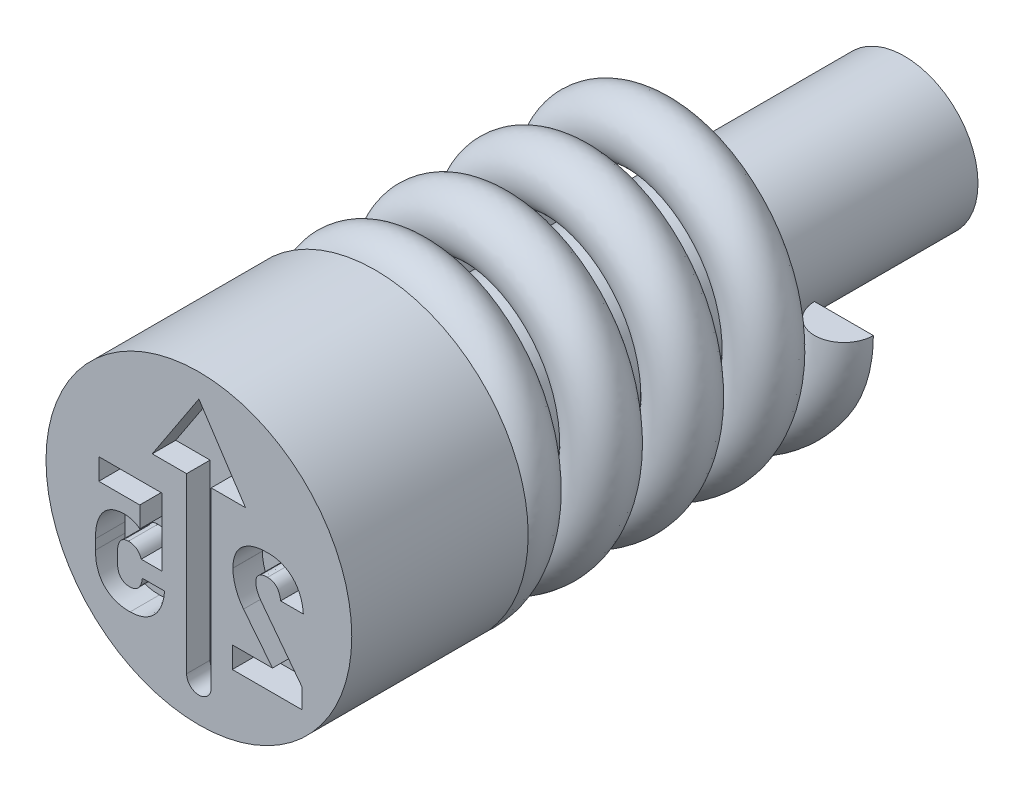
ISO-10303-21;
HEADER;
FILE_DESCRIPTION(('STEP AP214'),'2;1');
FILE_NAME('part.step','',(''),(''),'','','');
FILE_SCHEMA(('AUTOMOTIVE_DESIGN { 1 0 10303 214 1 1 1 1 }'));
ENDSEC;
DATA;
#1=APPLICATION_CONTEXT('core data for automotive mechanical design processes');
#2=APPLICATION_PROTOCOL_DEFINITION('international standard','automotive_design',2000,#1);
#3=PRODUCT_CONTEXT('',#1,'mechanical');
#4=PRODUCT('Part','Part','',(#3));
#5=PRODUCT_RELATED_PRODUCT_CATEGORY('part','',(#4));
#6=PRODUCT_DEFINITION_FORMATION('','',#4);
#7=PRODUCT_DEFINITION_CONTEXT('part definition',#1,'design');
#8=PRODUCT_DEFINITION('design','',#6,#7);
#9=PRODUCT_DEFINITION_SHAPE('','',#8);
#10=(LENGTH_UNIT() NAMED_UNIT(*) SI_UNIT(.MILLI.,.METRE.));
#11=(NAMED_UNIT(*) PLANE_ANGLE_UNIT() SI_UNIT($,.RADIAN.));
#12=(NAMED_UNIT(*) SI_UNIT($,.STERADIAN.) SOLID_ANGLE_UNIT());
#13=UNCERTAINTY_MEASURE_WITH_UNIT(LENGTH_MEASURE(1.E-05),#10,'distance_accuracy_value','');
#14=(GEOMETRIC_REPRESENTATION_CONTEXT(3) GLOBAL_UNCERTAINTY_ASSIGNED_CONTEXT((#13)) GLOBAL_UNIT_ASSIGNED_CONTEXT((#10,
#11,#12)) REPRESENTATION_CONTEXT('',''));
#15=CARTESIAN_POINT('',(0.,0.,0.));
#16=DIRECTION('',(0.,0.,1.));
#17=DIRECTION('',(1.,0.,0.));
#18=AXIS2_PLACEMENT_3D('',#15,#16,#17);
#19=CARTESIAN_POINT('',(2.1,0.,-9.37));
#20=DIRECTION('',(0.,-1.,0.));
#21=DIRECTION('',(0.,0.,-1.));
#22=AXIS2_PLACEMENT_3D('',#19,#20,#21);
#23=PLANE('',#22);
#24=CARTESIAN_POINT('',(2.1,0.,-8.87));
#25=DIRECTION('',(0.,1.,0.));
#26=DIRECTION('',(0.,0.,1.));
#27=AXIS2_PLACEMENT_3D('',#24,#25,#26);
#28=CIRCLE('',#27,0.5);
#29=CARTESIAN_POINT('',(1.6,0.,-8.87));
#30=VERTEX_POINT('',#29);
#31=CARTESIAN_POINT('',(2.6,0.,-8.87));
#32=VERTEX_POINT('',#31);
#33=EDGE_CURVE('E88',#30,#32,#28,.T.);
#34=ORIENTED_EDGE('',*,*,#33,.T.);
#35=DIRECTION('',(-1.,0.,0.));
#36=VECTOR('',#35,1.);
#37=CARTESIAN_POINT('',(2.1,0.,-8.87));
#38=LINE('',#37,#36);
#39=EDGE_CURVE('E75',#32,#30,#38,.T.);
#40=ORIENTED_EDGE('',*,*,#39,.T.);
#41=EDGE_LOOP('',(#34,#40));
#42=FACE_BOUND('',#41,.T.);
#43=ADVANCED_FACE('F49',(#42),#23,.F.);
#44=CARTESIAN_POINT('',(0.,-2.1,-3.5));
#45=DIRECTION('',(-1.,0.,0.));
#46=DIRECTION('',(0.,-1.,0.));
#47=AXIS2_PLACEMENT_3D('',#44,#45,#46);
#48=PLANE('',#47);
#49=DIRECTION('',(0.,-1.,0.));
#50=VECTOR('',#49,1.);
#51=CARTESIAN_POINT('',(0.,-2.1,-3.));
#52=LINE('',#51,#50);
#53=CARTESIAN_POINT('',(0.,-1.6,-3.));
#54=VERTEX_POINT('',#53);
#55=CARTESIAN_POINT('',(0.,-2.6,-3.));
#56=VERTEX_POINT('',#55);
#57=EDGE_CURVE('E69',#54,#56,#52,.T.);
#58=ORIENTED_EDGE('',*,*,#57,.F.);
#59=CARTESIAN_POINT('',(0.,-2.1,-3.));
#60=DIRECTION('',(-1.,0.,0.));
#61=DIRECTION('',(0.,-1.,0.));
#62=AXIS2_PLACEMENT_3D('',#59,#60,#61);
#63=CIRCLE('',#62,0.5);
#64=EDGE_CURVE('E85',#54,#56,#63,.T.);
#65=ORIENTED_EDGE('',*,*,#64,.T.);
#66=EDGE_LOOP('',(#58,#65));
#67=FACE_BOUND('',#66,.T.);
#68=ADVANCED_FACE('F51',(#67),#48,.T.);
#69=CARTESIAN_POINT('',(2.1,0.,-8.37));
#70=CARTESIAN_POINT('',(2.1,-0.8698484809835,-8.28367647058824));
#71=CARTESIAN_POINT('',(1.48492424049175,-1.48492424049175,-8.19735294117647));
#72=CARTESIAN_POINT('',(0.8698484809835,-2.1,-8.11102941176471));
#73=CARTESIAN_POINT('',(0.,-2.1,-8.02470588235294));
#74=CARTESIAN_POINT('',(-0.8698484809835,-2.1,-7.93838235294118));
#75=CARTESIAN_POINT('',(-1.48492424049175,-1.48492424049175,-7.85205882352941));
#76=CARTESIAN_POINT('',(-2.1,-0.8698484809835,-7.76573529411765));
#77=CARTESIAN_POINT('',(-2.1,0.,-7.67941176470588));
#78=CARTESIAN_POINT('',(-2.1,0.869848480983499,-7.59308823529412));
#79=CARTESIAN_POINT('',(-1.48492424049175,1.48492424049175,-7.50676470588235));
#80=CARTESIAN_POINT('',(-0.869848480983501,2.1,-7.42044117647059));
#81=CARTESIAN_POINT('',(0.,2.1,-7.33411764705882));
#82=CARTESIAN_POINT('',(0.8698484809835,2.1,-7.24779411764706));
#83=CARTESIAN_POINT('',(1.48492424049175,1.48492424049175,-7.1614705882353));
#84=CARTESIAN_POINT('',(2.1,0.869848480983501,-7.07514705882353));
#85=CARTESIAN_POINT('',(2.1,0.,-6.98882352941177));
#86=CARTESIAN_POINT('',(2.1,-0.8698484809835,-6.9025));
#87=CARTESIAN_POINT('',(1.48492424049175,-1.48492424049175,-6.81617647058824));
#88=CARTESIAN_POINT('',(0.8698484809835,-2.1,-6.72985294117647));
#89=CARTESIAN_POINT('',(0.,-2.1,-6.64352941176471));
#90=CARTESIAN_POINT('',(-0.8698484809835,-2.1,-6.55720588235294));
#91=CARTESIAN_POINT('',(-1.48492424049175,-1.48492424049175,-6.47088235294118));
#92=CARTESIAN_POINT('',(-2.1,-0.8698484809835,-6.38455882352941));
#93=CARTESIAN_POINT('',(-2.1,0.,-6.29823529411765));
#94=CARTESIAN_POINT('',(-2.1,0.869848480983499,-6.21191176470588));
#95=CARTESIAN_POINT('',(-1.48492424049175,1.48492424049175,-6.12558823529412));
#96=CARTESIAN_POINT('',(-0.869848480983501,2.1,-6.03926470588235));
#97=CARTESIAN_POINT('',(0.,2.1,-5.95294117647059));
#98=CARTESIAN_POINT('',(0.8698484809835,2.1,-5.86661764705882));
#99=CARTESIAN_POINT('',(1.48492424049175,1.48492424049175,-5.78029411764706));
#100=CARTESIAN_POINT('',(2.1,0.869848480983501,-5.6939705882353));
#101=CARTESIAN_POINT('',(2.1,0.,-5.60764705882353));
#102=CARTESIAN_POINT('',(2.1,-0.8698484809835,-5.52132352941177));
#103=CARTESIAN_POINT('',(1.48492424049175,-1.48492424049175,-5.435));
#104=CARTESIAN_POINT('',(0.8698484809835,-2.1,-5.34867647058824));
#105=CARTESIAN_POINT('',(0.,-2.1,-5.26235294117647));
#106=CARTESIAN_POINT('',(-0.8698484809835,-2.1,-5.17602941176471));
#107=CARTESIAN_POINT('',(-1.48492424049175,-1.48492424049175,-5.08970588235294));
#108=CARTESIAN_POINT('',(-2.1,-0.8698484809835,-5.00338235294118));
#109=CARTESIAN_POINT('',(-2.1,0.,-4.91705882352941));
#110=CARTESIAN_POINT('',(-2.1,0.869848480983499,-4.83073529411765));
#111=CARTESIAN_POINT('',(-1.48492424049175,1.48492424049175,-4.74441176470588));
#112=CARTESIAN_POINT('',(-0.869848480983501,2.1,-4.65808823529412));
#113=CARTESIAN_POINT('',(0.,2.1,-4.57176470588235));
#114=CARTESIAN_POINT('',(0.8698484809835,2.1,-4.48544117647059));
#115=CARTESIAN_POINT('',(1.48492424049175,1.48492424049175,-4.39911764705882));
#116=CARTESIAN_POINT('',(2.1,0.869848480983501,-4.31279411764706));
#117=CARTESIAN_POINT('',(2.1,0.,-4.2264705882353));
#118=CARTESIAN_POINT('',(2.1,-0.8698484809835,-4.14014705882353));
#119=CARTESIAN_POINT('',(1.48492424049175,-1.48492424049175,-4.05382352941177));
#120=CARTESIAN_POINT('',(0.8698484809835,-2.1,-3.9675));
#121=CARTESIAN_POINT('',(0.,-2.1,-3.88117647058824));
#122=CARTESIAN_POINT('',(-0.8698484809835,-2.1,-3.79485294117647));
#123=CARTESIAN_POINT('',(-1.48492424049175,-1.48492424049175,-3.70852941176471));
#124=CARTESIAN_POINT('',(-2.1,-0.8698484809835,-3.62220588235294));
#125=CARTESIAN_POINT('',(-2.1,0.,-3.53588235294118));
#126=CARTESIAN_POINT('',(-2.1,0.869848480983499,-3.44955882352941));
#127=CARTESIAN_POINT('',(-1.48492424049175,1.48492424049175,-3.36323529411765));
#128=CARTESIAN_POINT('',(-0.869848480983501,2.1,-3.27691176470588));
#129=CARTESIAN_POINT('',(0.,2.1,-3.19058823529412));
#130=CARTESIAN_POINT('',(0.8698484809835,2.1,-3.10426470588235));
#131=CARTESIAN_POINT('',(1.48492424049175,1.48492424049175,-3.01794117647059));
#132=CARTESIAN_POINT('',(2.1,0.869848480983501,-2.93161764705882));
#133=CARTESIAN_POINT('',(2.1,0.,-2.84529411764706));
#134=CARTESIAN_POINT('',(2.1,-0.8698484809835,-2.7589705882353));
#135=CARTESIAN_POINT('',(1.48492424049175,-1.48492424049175,-2.67264705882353));
#136=CARTESIAN_POINT('',(0.8698484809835,-2.1,-2.58632352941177));
#137=CARTESIAN_POINT('',(0.,-2.1,-2.5));
#138=CARTESIAN_POINT('',(3.1,0.,-8.37));
#139=CARTESIAN_POINT('',(3.1,-1.2840620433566,-8.28367647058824));
#140=CARTESIAN_POINT('',(2.1920310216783,-2.1920310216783,-8.19735294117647));
#141=CARTESIAN_POINT('',(1.2840620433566,-3.1,-8.11102941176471));
#142=CARTESIAN_POINT('',(0.,-3.1,-8.02470588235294));
#143=CARTESIAN_POINT('',(-1.28406204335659,-3.1,-7.93838235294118));
#144=CARTESIAN_POINT('',(-2.1920310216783,-2.1920310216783,-7.85205882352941));
#145=CARTESIAN_POINT('',(-3.1,-1.2840620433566,-7.76573529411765));
#146=CARTESIAN_POINT('',(-3.1,0.,-7.67941176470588));
#147=CARTESIAN_POINT('',(-3.1,1.28406204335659,-7.59308823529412));
#148=CARTESIAN_POINT('',(-2.1920310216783,2.1920310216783,-7.50676470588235));
#149=CARTESIAN_POINT('',(-1.2840620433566,3.1,-7.42044117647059));
#150=CARTESIAN_POINT('',(0.,3.1,-7.33411764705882));
#151=CARTESIAN_POINT('',(1.2840620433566,3.1,-7.24779411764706));
#152=CARTESIAN_POINT('',(2.1920310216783,2.1920310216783,-7.1614705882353));
#153=CARTESIAN_POINT('',(3.1,1.2840620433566,-7.07514705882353));
#154=CARTESIAN_POINT('',(3.1,0.,-6.98882352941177));
#155=CARTESIAN_POINT('',(3.1,-1.2840620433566,-6.9025));
#156=CARTESIAN_POINT('',(2.1920310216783,-2.1920310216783,-6.81617647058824));
#157=CARTESIAN_POINT('',(1.2840620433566,-3.1,-6.72985294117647));
#158=CARTESIAN_POINT('',(0.,-3.1,-6.64352941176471));
#159=CARTESIAN_POINT('',(-1.28406204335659,-3.1,-6.55720588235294));
#160=CARTESIAN_POINT('',(-2.1920310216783,-2.1920310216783,-6.47088235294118));
#161=CARTESIAN_POINT('',(-3.1,-1.2840620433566,-6.38455882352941));
#162=CARTESIAN_POINT('',(-3.1,0.,-6.29823529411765));
#163=CARTESIAN_POINT('',(-3.1,1.28406204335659,-6.21191176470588));
#164=CARTESIAN_POINT('',(-2.1920310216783,2.1920310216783,-6.12558823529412));
#165=CARTESIAN_POINT('',(-1.2840620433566,3.1,-6.03926470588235));
#166=CARTESIAN_POINT('',(0.,3.1,-5.95294117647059));
#167=CARTESIAN_POINT('',(1.2840620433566,3.1,-5.86661764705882));
#168=CARTESIAN_POINT('',(2.1920310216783,2.1920310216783,-5.78029411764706));
#169=CARTESIAN_POINT('',(3.1,1.2840620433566,-5.69397058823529));
#170=CARTESIAN_POINT('',(3.1,0.,-5.60764705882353));
#171=CARTESIAN_POINT('',(3.1,-1.2840620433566,-5.52132352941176));
#172=CARTESIAN_POINT('',(2.1920310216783,-2.1920310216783,-5.435));
#173=CARTESIAN_POINT('',(1.2840620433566,-3.1,-5.34867647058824));
#174=CARTESIAN_POINT('',(0.,-3.1,-5.26235294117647));
#175=CARTESIAN_POINT('',(-1.28406204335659,-3.1,-5.17602941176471));
#176=CARTESIAN_POINT('',(-2.1920310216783,-2.1920310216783,-5.08970588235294));
#177=CARTESIAN_POINT('',(-3.1,-1.2840620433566,-5.00338235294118));
#178=CARTESIAN_POINT('',(-3.1,0.,-4.91705882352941));
#179=CARTESIAN_POINT('',(-3.1,1.28406204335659,-4.83073529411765));
#180=CARTESIAN_POINT('',(-2.1920310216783,2.1920310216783,-4.74441176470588));
#181=CARTESIAN_POINT('',(-1.2840620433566,3.1,-4.65808823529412));
#182=CARTESIAN_POINT('',(0.,3.1,-4.57176470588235));
#183=CARTESIAN_POINT('',(1.2840620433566,3.1,-4.48544117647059));
#184=CARTESIAN_POINT('',(2.1920310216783,2.1920310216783,-4.39911764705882));
#185=CARTESIAN_POINT('',(3.1,1.2840620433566,-4.31279411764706));
#186=CARTESIAN_POINT('',(3.1,0.,-4.2264705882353));
#187=CARTESIAN_POINT('',(3.1,-1.2840620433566,-4.14014705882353));
#188=CARTESIAN_POINT('',(2.1920310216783,-2.1920310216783,-4.05382352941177));
#189=CARTESIAN_POINT('',(1.2840620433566,-3.1,-3.9675));
#190=CARTESIAN_POINT('',(0.,-3.1,-3.88117647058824));
#191=CARTESIAN_POINT('',(-1.28406204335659,-3.1,-3.79485294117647));
#192=CARTESIAN_POINT('',(-2.1920310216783,-2.1920310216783,-3.70852941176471));
#193=CARTESIAN_POINT('',(-3.1,-1.2840620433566,-3.62220588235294));
#194=CARTESIAN_POINT('',(-3.1,0.,-3.53588235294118));
#195=CARTESIAN_POINT('',(-3.1,1.28406204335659,-3.44955882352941));
#196=CARTESIAN_POINT('',(-2.1920310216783,2.1920310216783,-3.36323529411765));
#197=CARTESIAN_POINT('',(-1.2840620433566,3.1,-3.27691176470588));
#198=CARTESIAN_POINT('',(0.,3.1,-3.19058823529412));
#199=CARTESIAN_POINT('',(1.2840620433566,3.1,-3.10426470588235));
#200=CARTESIAN_POINT('',(2.1920310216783,2.1920310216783,-3.01794117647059));
#201=CARTESIAN_POINT('',(3.1,1.2840620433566,-2.93161764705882));
#202=CARTESIAN_POINT('',(3.1,0.,-2.84529411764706));
#203=CARTESIAN_POINT('',(3.1,-1.2840620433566,-2.75897058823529));
#204=CARTESIAN_POINT('',(2.1920310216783,-2.1920310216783,-2.67264705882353));
#205=CARTESIAN_POINT('',(1.2840620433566,-3.1,-2.58632352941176));
#206=CARTESIAN_POINT('',(0.,-3.1,-2.5));
#207=CARTESIAN_POINT('',(3.1,0.,-9.37));
#208=CARTESIAN_POINT('',(3.1,-1.2840620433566,-9.28367647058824));
#209=CARTESIAN_POINT('',(2.1920310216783,-2.1920310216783,-9.19735294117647));
#210=CARTESIAN_POINT('',(1.2840620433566,-3.1,-9.11102941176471));
#211=CARTESIAN_POINT('',(0.,-3.1,-9.02470588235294));
#212=CARTESIAN_POINT('',(-1.28406204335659,-3.1,-8.93838235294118));
#213=CARTESIAN_POINT('',(-2.1920310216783,-2.1920310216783,-8.85205882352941));
#214=CARTESIAN_POINT('',(-3.1,-1.2840620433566,-8.76573529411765));
#215=CARTESIAN_POINT('',(-3.1,0.,-8.67941176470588));
#216=CARTESIAN_POINT('',(-3.1,1.28406204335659,-8.59308823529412));
#217=CARTESIAN_POINT('',(-2.1920310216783,2.1920310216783,-8.50676470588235));
#218=CARTESIAN_POINT('',(-1.2840620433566,3.1,-8.42044117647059));
#219=CARTESIAN_POINT('',(0.,3.1,-8.33411764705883));
#220=CARTESIAN_POINT('',(1.2840620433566,3.1,-8.24779411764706));
#221=CARTESIAN_POINT('',(2.1920310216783,2.1920310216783,-8.16147058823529));
#222=CARTESIAN_POINT('',(3.1,1.2840620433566,-8.07514705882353));
#223=CARTESIAN_POINT('',(3.1,0.,-7.98882352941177));
#224=CARTESIAN_POINT('',(3.1,-1.2840620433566,-7.9025));
#225=CARTESIAN_POINT('',(2.1920310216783,-2.1920310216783,-7.81617647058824));
#226=CARTESIAN_POINT('',(1.2840620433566,-3.1,-7.72985294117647));
#227=CARTESIAN_POINT('',(0.,-3.1,-7.64352941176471));
#228=CARTESIAN_POINT('',(-1.28406204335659,-3.1,-7.55720588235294));
#229=CARTESIAN_POINT('',(-2.1920310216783,-2.1920310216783,-7.47088235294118));
#230=CARTESIAN_POINT('',(-3.1,-1.2840620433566,-7.38455882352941));
#231=CARTESIAN_POINT('',(-3.1,0.,-7.29823529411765));
#232=CARTESIAN_POINT('',(-3.1,1.28406204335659,-7.21191176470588));
#233=CARTESIAN_POINT('',(-2.1920310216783,2.1920310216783,-7.12558823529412));
#234=CARTESIAN_POINT('',(-1.2840620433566,3.1,-7.03926470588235));
#235=CARTESIAN_POINT('',(0.,3.1,-6.95294117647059));
#236=CARTESIAN_POINT('',(1.2840620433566,3.1,-6.86661764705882));
#237=CARTESIAN_POINT('',(2.1920310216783,2.1920310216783,-6.78029411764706));
#238=CARTESIAN_POINT('',(3.1,1.2840620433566,-6.6939705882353));
#239=CARTESIAN_POINT('',(3.1,0.,-6.60764705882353));
#240=CARTESIAN_POINT('',(3.1,-1.2840620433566,-6.52132352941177));
#241=CARTESIAN_POINT('',(2.1920310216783,-2.1920310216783,-6.435));
#242=CARTESIAN_POINT('',(1.2840620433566,-3.1,-6.34867647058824));
#243=CARTESIAN_POINT('',(0.,-3.1,-6.26235294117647));
#244=CARTESIAN_POINT('',(-1.28406204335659,-3.1,-6.17602941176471));
#245=CARTESIAN_POINT('',(-2.1920310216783,-2.1920310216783,-6.08970588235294));
#246=CARTESIAN_POINT('',(-3.1,-1.2840620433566,-6.00338235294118));
#247=CARTESIAN_POINT('',(-3.1,0.,-5.91705882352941));
#248=CARTESIAN_POINT('',(-3.1,1.28406204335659,-5.83073529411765));
#249=CARTESIAN_POINT('',(-2.1920310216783,2.1920310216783,-5.74441176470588));
#250=CARTESIAN_POINT('',(-1.2840620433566,3.1,-5.65808823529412));
#251=CARTESIAN_POINT('',(0.,3.1,-5.57176470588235));
#252=CARTESIAN_POINT('',(1.2840620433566,3.1,-5.48544117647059));
#253=CARTESIAN_POINT('',(2.1920310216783,2.1920310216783,-5.39911764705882));
#254=CARTESIAN_POINT('',(3.1,1.2840620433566,-5.31279411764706));
#255=CARTESIAN_POINT('',(3.1,0.,-5.2264705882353));
#256=CARTESIAN_POINT('',(3.1,-1.2840620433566,-5.14014705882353));
#257=CARTESIAN_POINT('',(2.1920310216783,-2.1920310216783,-5.05382352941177));
#258=CARTESIAN_POINT('',(1.2840620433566,-3.1,-4.9675));
#259=CARTESIAN_POINT('',(0.,-3.1,-4.88117647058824));
#260=CARTESIAN_POINT('',(-1.28406204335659,-3.1,-4.79485294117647));
#261=CARTESIAN_POINT('',(-2.1920310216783,-2.1920310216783,-4.70852941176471));
#262=CARTESIAN_POINT('',(-3.1,-1.2840620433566,-4.62220588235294));
#263=CARTESIAN_POINT('',(-3.1,0.,-4.53588235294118));
#264=CARTESIAN_POINT('',(-3.1,1.28406204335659,-4.44955882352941));
#265=CARTESIAN_POINT('',(-2.1920310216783,2.1920310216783,-4.36323529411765));
#266=CARTESIAN_POINT('',(-1.2840620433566,3.1,-4.27691176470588));
#267=CARTESIAN_POINT('',(0.,3.1,-4.19058823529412));
#268=CARTESIAN_POINT('',(1.2840620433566,3.1,-4.10426470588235));
#269=CARTESIAN_POINT('',(2.1920310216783,2.1920310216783,-4.01794117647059));
#270=CARTESIAN_POINT('',(3.1,1.2840620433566,-3.93161764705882));
#271=CARTESIAN_POINT('',(3.1,0.,-3.84529411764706));
#272=CARTESIAN_POINT('',(3.1,-1.2840620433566,-3.7589705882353));
#273=CARTESIAN_POINT('',(2.1920310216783,-2.1920310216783,-3.67264705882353));
#274=CARTESIAN_POINT('',(1.2840620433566,-3.1,-3.58632352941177));
#275=CARTESIAN_POINT('',(0.,-3.1,-3.5));
#276=CARTESIAN_POINT('',(2.1,0.,-9.37));
#277=CARTESIAN_POINT('',(2.1,-0.8698484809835,-9.28367647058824));
#278=CARTESIAN_POINT('',(1.48492424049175,-1.48492424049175,-9.19735294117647));
#279=CARTESIAN_POINT('',(0.8698484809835,-2.1,-9.11102941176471));
#280=CARTESIAN_POINT('',(0.,-2.1,-9.02470588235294));
#281=CARTESIAN_POINT('',(-0.8698484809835,-2.1,-8.93838235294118));
#282=CARTESIAN_POINT('',(-1.48492424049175,-1.48492424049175,-8.85205882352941));
#283=CARTESIAN_POINT('',(-2.1,-0.8698484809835,-8.76573529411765));
#284=CARTESIAN_POINT('',(-2.1,0.,-8.67941176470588));
#285=CARTESIAN_POINT('',(-2.1,0.869848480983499,-8.59308823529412));
#286=CARTESIAN_POINT('',(-1.48492424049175,1.48492424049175,-8.50676470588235));
#287=CARTESIAN_POINT('',(-0.869848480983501,2.1,-8.42044117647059));
#288=CARTESIAN_POINT('',(0.,2.1,-8.33411764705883));
#289=CARTESIAN_POINT('',(0.8698484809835,2.1,-8.24779411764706));
#290=CARTESIAN_POINT('',(1.48492424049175,1.48492424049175,-8.1614705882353));
#291=CARTESIAN_POINT('',(2.1,0.869848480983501,-8.07514705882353));
#292=CARTESIAN_POINT('',(2.1,0.,-7.98882352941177));
#293=CARTESIAN_POINT('',(2.1,-0.8698484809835,-7.9025));
#294=CARTESIAN_POINT('',(1.48492424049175,-1.48492424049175,-7.81617647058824));
#295=CARTESIAN_POINT('',(0.8698484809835,-2.1,-7.72985294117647));
#296=CARTESIAN_POINT('',(0.,-2.1,-7.64352941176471));
#297=CARTESIAN_POINT('',(-0.8698484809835,-2.1,-7.55720588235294));
#298=CARTESIAN_POINT('',(-1.48492424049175,-1.48492424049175,-7.47088235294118));
#299=CARTESIAN_POINT('',(-2.1,-0.8698484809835,-7.38455882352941));
#300=CARTESIAN_POINT('',(-2.1,0.,-7.29823529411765));
#301=CARTESIAN_POINT('',(-2.1,0.869848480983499,-7.21191176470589));
#302=CARTESIAN_POINT('',(-1.48492424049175,1.48492424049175,-7.12558823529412));
#303=CARTESIAN_POINT('',(-0.869848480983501,2.1,-7.03926470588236));
#304=CARTESIAN_POINT('',(0.,2.1,-6.95294117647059));
#305=CARTESIAN_POINT('',(0.8698484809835,2.1,-6.86661764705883));
#306=CARTESIAN_POINT('',(1.48492424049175,1.48492424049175,-6.78029411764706));
#307=CARTESIAN_POINT('',(2.1,0.869848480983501,-6.6939705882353));
#308=CARTESIAN_POINT('',(2.1,0.,-6.60764705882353));
#309=CARTESIAN_POINT('',(2.1,-0.8698484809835,-6.52132352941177));
#310=CARTESIAN_POINT('',(1.48492424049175,-1.48492424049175,-6.435));
#311=CARTESIAN_POINT('',(0.8698484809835,-2.1,-6.34867647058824));
#312=CARTESIAN_POINT('',(0.,-2.1,-6.26235294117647));
#313=CARTESIAN_POINT('',(-0.8698484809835,-2.1,-6.17602941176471));
#314=CARTESIAN_POINT('',(-1.48492424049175,-1.48492424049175,-6.08970588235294));
#315=CARTESIAN_POINT('',(-2.1,-0.8698484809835,-6.00338235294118));
#316=CARTESIAN_POINT('',(-2.1,0.,-5.91705882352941));
#317=CARTESIAN_POINT('',(-2.1,0.869848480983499,-5.83073529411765));
#318=CARTESIAN_POINT('',(-1.48492424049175,1.48492424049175,-5.74441176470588));
#319=CARTESIAN_POINT('',(-0.869848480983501,2.1,-5.65808823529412));
#320=CARTESIAN_POINT('',(0.,2.1,-5.57176470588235));
#321=CARTESIAN_POINT('',(0.8698484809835,2.1,-5.48544117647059));
#322=CARTESIAN_POINT('',(1.48492424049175,1.48492424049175,-5.39911764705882));
#323=CARTESIAN_POINT('',(2.1,0.869848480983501,-5.31279411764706));
#324=CARTESIAN_POINT('',(2.1,0.,-5.2264705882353));
#325=CARTESIAN_POINT('',(2.1,-0.8698484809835,-5.14014705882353));
#326=CARTESIAN_POINT('',(1.48492424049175,-1.48492424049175,-5.05382352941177));
#327=CARTESIAN_POINT('',(0.8698484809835,-2.1,-4.9675));
#328=CARTESIAN_POINT('',(0.,-2.1,-4.88117647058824));
#329=CARTESIAN_POINT('',(-0.8698484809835,-2.1,-4.79485294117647));
#330=CARTESIAN_POINT('',(-1.48492424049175,-1.48492424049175,-4.70852941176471));
#331=CARTESIAN_POINT('',(-2.1,-0.8698484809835,-4.62220588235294));
#332=CARTESIAN_POINT('',(-2.1,0.,-4.53588235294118));
#333=CARTESIAN_POINT('',(-2.1,0.869848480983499,-4.44955882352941));
#334=CARTESIAN_POINT('',(-1.48492424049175,1.48492424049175,-4.36323529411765));
#335=CARTESIAN_POINT('',(-0.869848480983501,2.1,-4.27691176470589));
#336=CARTESIAN_POINT('',(0.,2.1,-4.19058823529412));
#337=CARTESIAN_POINT('',(0.8698484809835,2.1,-4.10426470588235));
#338=CARTESIAN_POINT('',(1.48492424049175,1.48492424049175,-4.01794117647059));
#339=CARTESIAN_POINT('',(2.1,0.869848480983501,-3.93161764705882));
#340=CARTESIAN_POINT('',(2.1,0.,-3.84529411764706));
#341=CARTESIAN_POINT('',(2.1,-0.8698484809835,-3.7589705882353));
#342=CARTESIAN_POINT('',(1.48492424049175,-1.48492424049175,-3.67264705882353));
#343=CARTESIAN_POINT('',(0.8698484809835,-2.1,-3.58632352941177));
#344=CARTESIAN_POINT('',(0.,-2.1,-3.5));
#345=CARTESIAN_POINT('',(1.1,0.,-9.37));
#346=CARTESIAN_POINT('',(1.1,-0.455634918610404,-9.28367647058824));
#347=CARTESIAN_POINT('',(0.777817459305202,-0.777817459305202,-9.19735294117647));
#348=CARTESIAN_POINT('',(0.455634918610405,-1.1,-9.11102941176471));
#349=CARTESIAN_POINT('',(0.,-1.1,-9.02470588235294));
#350=CARTESIAN_POINT('',(-0.455634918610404,-1.1,-8.93838235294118));
#351=CARTESIAN_POINT('',(-0.777817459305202,-0.777817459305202,-8.85205882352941));
#352=CARTESIAN_POINT('',(-1.1,-0.455634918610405,-8.76573529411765));
#353=CARTESIAN_POINT('',(-1.1,0.,-8.67941176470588));
#354=CARTESIAN_POINT('',(-1.1,0.455634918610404,-8.59308823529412));
#355=CARTESIAN_POINT('',(-0.777817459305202,0.777817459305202,-8.50676470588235));
#356=CARTESIAN_POINT('',(-0.455634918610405,1.1,-8.42044117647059));
#357=CARTESIAN_POINT('',(0.,1.1,-8.33411764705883));
#358=CARTESIAN_POINT('',(0.455634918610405,1.1,-8.24779411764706));
#359=CARTESIAN_POINT('',(0.777817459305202,0.777817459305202,-8.16147058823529));
#360=CARTESIAN_POINT('',(1.1,0.455634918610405,-8.07514705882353));
#361=CARTESIAN_POINT('',(1.1,0.,-7.98882352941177));
#362=CARTESIAN_POINT('',(1.1,-0.455634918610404,-7.9025));
#363=CARTESIAN_POINT('',(0.777817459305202,-0.777817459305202,-7.81617647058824));
#364=CARTESIAN_POINT('',(0.455634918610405,-1.1,-7.72985294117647));
#365=CARTESIAN_POINT('',(0.,-1.1,-7.64352941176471));
#366=CARTESIAN_POINT('',(-0.455634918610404,-1.1,-7.55720588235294));
#367=CARTESIAN_POINT('',(-0.777817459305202,-0.777817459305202,-7.47088235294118));
#368=CARTESIAN_POINT('',(-1.1,-0.455634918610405,-7.38455882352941));
#369=CARTESIAN_POINT('',(-1.1,0.,-7.29823529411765));
#370=CARTESIAN_POINT('',(-1.1,0.455634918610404,-7.21191176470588));
#371=CARTESIAN_POINT('',(-0.777817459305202,0.777817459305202,-7.12558823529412));
#372=CARTESIAN_POINT('',(-0.455634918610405,1.1,-7.03926470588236));
#373=CARTESIAN_POINT('',(0.,1.1,-6.95294117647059));
#374=CARTESIAN_POINT('',(0.455634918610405,1.1,-6.86661764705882));
#375=CARTESIAN_POINT('',(0.777817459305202,0.777817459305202,-6.78029411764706));
#376=CARTESIAN_POINT('',(1.1,0.455634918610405,-6.6939705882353));
#377=CARTESIAN_POINT('',(1.1,0.,-6.60764705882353));
#378=CARTESIAN_POINT('',(1.1,-0.455634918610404,-6.52132352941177));
#379=CARTESIAN_POINT('',(0.777817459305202,-0.777817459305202,-6.435));
#380=CARTESIAN_POINT('',(0.455634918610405,-1.1,-6.34867647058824));
#381=CARTESIAN_POINT('',(0.,-1.1,-6.26235294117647));
#382=CARTESIAN_POINT('',(-0.455634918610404,-1.1,-6.17602941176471));
#383=CARTESIAN_POINT('',(-0.777817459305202,-0.777817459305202,-6.08970588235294));
#384=CARTESIAN_POINT('',(-1.1,-0.455634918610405,-6.00338235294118));
#385=CARTESIAN_POINT('',(-1.1,0.,-5.91705882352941));
#386=CARTESIAN_POINT('',(-1.1,0.455634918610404,-5.83073529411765));
#387=CARTESIAN_POINT('',(-0.777817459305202,0.777817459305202,-5.74441176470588));
#388=CARTESIAN_POINT('',(-0.455634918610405,1.1,-5.65808823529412));
#389=CARTESIAN_POINT('',(0.,1.1,-5.57176470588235));
#390=CARTESIAN_POINT('',(0.455634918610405,1.1,-5.48544117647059));
#391=CARTESIAN_POINT('',(0.777817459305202,0.777817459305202,-5.39911764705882));
#392=CARTESIAN_POINT('',(1.1,0.455634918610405,-5.31279411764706));
#393=CARTESIAN_POINT('',(1.1,0.,-5.2264705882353));
#394=CARTESIAN_POINT('',(1.1,-0.455634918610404,-5.14014705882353));
#395=CARTESIAN_POINT('',(0.777817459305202,-0.777817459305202,-5.05382352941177));
#396=CARTESIAN_POINT('',(0.455634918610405,-1.1,-4.9675));
#397=CARTESIAN_POINT('',(0.,-1.1,-4.88117647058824));
#398=CARTESIAN_POINT('',(-0.455634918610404,-1.1,-4.79485294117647));
#399=CARTESIAN_POINT('',(-0.777817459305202,-0.777817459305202,-4.70852941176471));
#400=CARTESIAN_POINT('',(-1.1,-0.455634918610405,-4.62220588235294));
#401=CARTESIAN_POINT('',(-1.1,0.,-4.53588235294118));
#402=CARTESIAN_POINT('',(-1.1,0.455634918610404,-4.44955882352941));
#403=CARTESIAN_POINT('',(-0.777817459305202,0.777817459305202,-4.36323529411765));
#404=CARTESIAN_POINT('',(-0.455634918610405,1.1,-4.27691176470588));
#405=CARTESIAN_POINT('',(0.,1.1,-4.19058823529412));
#406=CARTESIAN_POINT('',(0.455634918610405,1.1,-4.10426470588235));
#407=CARTESIAN_POINT('',(0.777817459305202,0.777817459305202,-4.01794117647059));
#408=CARTESIAN_POINT('',(1.1,0.455634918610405,-3.93161764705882));
#409=CARTESIAN_POINT('',(1.1,0.,-3.84529411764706));
#410=CARTESIAN_POINT('',(1.1,-0.455634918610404,-3.7589705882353));
#411=CARTESIAN_POINT('',(0.777817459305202,-0.777817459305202,-3.67264705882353));
#412=CARTESIAN_POINT('',(0.455634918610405,-1.1,-3.58632352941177));
#413=CARTESIAN_POINT('',(0.,-1.1,-3.5));
#414=CARTESIAN_POINT('',(1.1,0.,-8.37));
#415=CARTESIAN_POINT('',(1.1,-0.455634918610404,-8.28367647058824));
#416=CARTESIAN_POINT('',(0.777817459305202,-0.777817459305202,-8.19735294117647));
#417=CARTESIAN_POINT('',(0.455634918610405,-1.1,-8.11102941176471));
#418=CARTESIAN_POINT('',(0.,-1.1,-8.02470588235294));
#419=CARTESIAN_POINT('',(-0.455634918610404,-1.1,-7.93838235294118));
#420=CARTESIAN_POINT('',(-0.777817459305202,-0.777817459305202,-7.85205882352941));
#421=CARTESIAN_POINT('',(-1.1,-0.455634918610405,-7.76573529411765));
#422=CARTESIAN_POINT('',(-1.1,0.,-7.67941176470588));
#423=CARTESIAN_POINT('',(-1.1,0.455634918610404,-7.59308823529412));
#424=CARTESIAN_POINT('',(-0.777817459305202,0.777817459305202,-7.50676470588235));
#425=CARTESIAN_POINT('',(-0.455634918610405,1.1,-7.42044117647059));
#426=CARTESIAN_POINT('',(0.,1.1,-7.33411764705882));
#427=CARTESIAN_POINT('',(0.455634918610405,1.1,-7.24779411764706));
#428=CARTESIAN_POINT('',(0.777817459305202,0.777817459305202,-7.1614705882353));
#429=CARTESIAN_POINT('',(1.1,0.455634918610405,-7.07514705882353));
#430=CARTESIAN_POINT('',(1.1,0.,-6.98882352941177));
#431=CARTESIAN_POINT('',(1.1,-0.455634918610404,-6.9025));
#432=CARTESIAN_POINT('',(0.777817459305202,-0.777817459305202,-6.81617647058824));
#433=CARTESIAN_POINT('',(0.455634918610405,-1.1,-6.72985294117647));
#434=CARTESIAN_POINT('',(0.,-1.1,-6.64352941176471));
#435=CARTESIAN_POINT('',(-0.455634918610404,-1.1,-6.55720588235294));
#436=CARTESIAN_POINT('',(-0.777817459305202,-0.777817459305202,-6.47088235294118));
#437=CARTESIAN_POINT('',(-1.1,-0.455634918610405,-6.38455882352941));
#438=CARTESIAN_POINT('',(-1.1,0.,-6.29823529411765));
#439=CARTESIAN_POINT('',(-1.1,0.455634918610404,-6.21191176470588));
#440=CARTESIAN_POINT('',(-0.777817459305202,0.777817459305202,-6.12558823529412));
#441=CARTESIAN_POINT('',(-0.455634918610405,1.1,-6.03926470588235));
#442=CARTESIAN_POINT('',(0.,1.1,-5.95294117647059));
#443=CARTESIAN_POINT('',(0.455634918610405,1.1,-5.86661764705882));
#444=CARTESIAN_POINT('',(0.777817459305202,0.777817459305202,-5.78029411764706));
#445=CARTESIAN_POINT('',(1.1,0.455634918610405,-5.69397058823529));
#446=CARTESIAN_POINT('',(1.1,0.,-5.60764705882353));
#447=CARTESIAN_POINT('',(1.1,-0.455634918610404,-5.52132352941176));
#448=CARTESIAN_POINT('',(0.777817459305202,-0.777817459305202,-5.435));
#449=CARTESIAN_POINT('',(0.455634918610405,-1.1,-5.34867647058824));
#450=CARTESIAN_POINT('',(0.,-1.1,-5.26235294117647));
#451=CARTESIAN_POINT('',(-0.455634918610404,-1.1,-5.17602941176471));
#452=CARTESIAN_POINT('',(-0.777817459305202,-0.777817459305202,-5.08970588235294));
#453=CARTESIAN_POINT('',(-1.1,-0.455634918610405,-5.00338235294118));
#454=CARTESIAN_POINT('',(-1.1,0.,-4.91705882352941));
#455=CARTESIAN_POINT('',(-1.1,0.455634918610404,-4.83073529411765));
#456=CARTESIAN_POINT('',(-0.777817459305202,0.777817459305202,-4.74441176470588));
#457=CARTESIAN_POINT('',(-0.455634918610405,1.1,-4.65808823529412));
#458=CARTESIAN_POINT('',(0.,1.1,-4.57176470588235));
#459=CARTESIAN_POINT('',(0.455634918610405,1.1,-4.48544117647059));
#460=CARTESIAN_POINT('',(0.777817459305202,0.777817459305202,-4.39911764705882));
#461=CARTESIAN_POINT('',(1.1,0.455634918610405,-4.31279411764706));
#462=CARTESIAN_POINT('',(1.1,0.,-4.2264705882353));
#463=CARTESIAN_POINT('',(1.1,-0.455634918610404,-4.14014705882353));
#464=CARTESIAN_POINT('',(0.777817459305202,-0.777817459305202,-4.05382352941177));
#465=CARTESIAN_POINT('',(0.455634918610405,-1.1,-3.9675));
#466=CARTESIAN_POINT('',(0.,-1.1,-3.88117647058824));
#467=CARTESIAN_POINT('',(-0.455634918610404,-1.1,-3.79485294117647));
#468=CARTESIAN_POINT('',(-0.777817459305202,-0.777817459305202,-3.70852941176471));
#469=CARTESIAN_POINT('',(-1.1,-0.455634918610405,-3.62220588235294));
#470=CARTESIAN_POINT('',(-1.1,0.,-3.53588235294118));
#471=CARTESIAN_POINT('',(-1.1,0.455634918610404,-3.44955882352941));
#472=CARTESIAN_POINT('',(-0.777817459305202,0.777817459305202,-3.36323529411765));
#473=CARTESIAN_POINT('',(-0.455634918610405,1.1,-3.27691176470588));
#474=CARTESIAN_POINT('',(0.,1.1,-3.19058823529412));
#475=CARTESIAN_POINT('',(0.455634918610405,1.1,-3.10426470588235));
#476=CARTESIAN_POINT('',(0.777817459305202,0.777817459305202,-3.01794117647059));
#477=CARTESIAN_POINT('',(1.1,0.455634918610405,-2.93161764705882));
#478=CARTESIAN_POINT('',(1.1,0.,-2.84529411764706));
#479=CARTESIAN_POINT('',(1.1,-0.455634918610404,-2.75897058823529));
#480=CARTESIAN_POINT('',(0.777817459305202,-0.777817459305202,-2.67264705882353));
#481=CARTESIAN_POINT('',(0.455634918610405,-1.1,-2.58632352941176));
#482=CARTESIAN_POINT('',(0.,-1.1,-2.5));
#483=CARTESIAN_POINT('',(2.1,0.,-8.37));
#484=CARTESIAN_POINT('',(2.1,-0.8698484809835,-8.28367647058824));
#485=CARTESIAN_POINT('',(1.48492424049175,-1.48492424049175,-8.19735294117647));
#486=CARTESIAN_POINT('',(0.8698484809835,-2.1,-8.11102941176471));
#487=CARTESIAN_POINT('',(0.,-2.1,-8.02470588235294));
#488=CARTESIAN_POINT('',(-0.8698484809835,-2.1,-7.93838235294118));
#489=CARTESIAN_POINT('',(-1.48492424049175,-1.48492424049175,-7.85205882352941));
#490=CARTESIAN_POINT('',(-2.1,-0.8698484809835,-7.76573529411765));
#491=CARTESIAN_POINT('',(-2.1,0.,-7.67941176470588));
#492=CARTESIAN_POINT('',(-2.1,0.869848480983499,-7.59308823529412));
#493=CARTESIAN_POINT('',(-1.48492424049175,1.48492424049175,-7.50676470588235));
#494=CARTESIAN_POINT('',(-0.869848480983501,2.1,-7.42044117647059));
#495=CARTESIAN_POINT('',(0.,2.1,-7.33411764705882));
#496=CARTESIAN_POINT('',(0.8698484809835,2.1,-7.24779411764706));
#497=CARTESIAN_POINT('',(1.48492424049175,1.48492424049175,-7.1614705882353));
#498=CARTESIAN_POINT('',(2.1,0.869848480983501,-7.07514705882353));
#499=CARTESIAN_POINT('',(2.1,0.,-6.98882352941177));
#500=CARTESIAN_POINT('',(2.1,-0.8698484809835,-6.9025));
#501=CARTESIAN_POINT('',(1.48492424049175,-1.48492424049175,-6.81617647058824));
#502=CARTESIAN_POINT('',(0.8698484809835,-2.1,-6.72985294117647));
#503=CARTESIAN_POINT('',(0.,-2.1,-6.64352941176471));
#504=CARTESIAN_POINT('',(-0.8698484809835,-2.1,-6.55720588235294));
#505=CARTESIAN_POINT('',(-1.48492424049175,-1.48492424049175,-6.47088235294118));
#506=CARTESIAN_POINT('',(-2.1,-0.8698484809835,-6.38455882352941));
#507=CARTESIAN_POINT('',(-2.1,0.,-6.29823529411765));
#508=CARTESIAN_POINT('',(-2.1,0.869848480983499,-6.21191176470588));
#509=CARTESIAN_POINT('',(-1.48492424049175,1.48492424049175,-6.12558823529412));
#510=CARTESIAN_POINT('',(-0.869848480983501,2.1,-6.03926470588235));
#511=CARTESIAN_POINT('',(0.,2.1,-5.95294117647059));
#512=CARTESIAN_POINT('',(0.8698484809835,2.1,-5.86661764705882));
#513=CARTESIAN_POINT('',(1.48492424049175,1.48492424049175,-5.78029411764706));
#514=CARTESIAN_POINT('',(2.1,0.869848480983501,-5.6939705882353));
#515=CARTESIAN_POINT('',(2.1,0.,-5.60764705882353));
#516=CARTESIAN_POINT('',(2.1,-0.8698484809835,-5.52132352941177));
#517=CARTESIAN_POINT('',(1.48492424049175,-1.48492424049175,-5.435));
#518=CARTESIAN_POINT('',(0.8698484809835,-2.1,-5.34867647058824));
#519=CARTESIAN_POINT('',(0.,-2.1,-5.26235294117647));
#520=CARTESIAN_POINT('',(-0.8698484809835,-2.1,-5.17602941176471));
#521=CARTESIAN_POINT('',(-1.48492424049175,-1.48492424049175,-5.08970588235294));
#522=CARTESIAN_POINT('',(-2.1,-0.8698484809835,-5.00338235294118));
#523=CARTESIAN_POINT('',(-2.1,0.,-4.91705882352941));
#524=CARTESIAN_POINT('',(-2.1,0.869848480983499,-4.83073529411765));
#525=CARTESIAN_POINT('',(-1.48492424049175,1.48492424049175,-4.74441176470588));
#526=CARTESIAN_POINT('',(-0.869848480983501,2.1,-4.65808823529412));
#527=CARTESIAN_POINT('',(0.,2.1,-4.57176470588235));
#528=CARTESIAN_POINT('',(0.8698484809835,2.1,-4.48544117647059));
#529=CARTESIAN_POINT('',(1.48492424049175,1.48492424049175,-4.39911764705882));
#530=CARTESIAN_POINT('',(2.1,0.869848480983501,-4.31279411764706));
#531=CARTESIAN_POINT('',(2.1,0.,-4.2264705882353));
#532=CARTESIAN_POINT('',(2.1,-0.8698484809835,-4.14014705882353));
#533=CARTESIAN_POINT('',(1.48492424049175,-1.48492424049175,-4.05382352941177));
#534=CARTESIAN_POINT('',(0.8698484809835,-2.1,-3.9675));
#535=CARTESIAN_POINT('',(0.,-2.1,-3.88117647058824));
#536=CARTESIAN_POINT('',(-0.8698484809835,-2.1,-3.79485294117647));
#537=CARTESIAN_POINT('',(-1.48492424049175,-1.48492424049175,-3.70852941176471));
#538=CARTESIAN_POINT('',(-2.1,-0.8698484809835,-3.62220588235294));
#539=CARTESIAN_POINT('',(-2.1,0.,-3.53588235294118));
#540=CARTESIAN_POINT('',(-2.1,0.869848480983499,-3.44955882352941));
#541=CARTESIAN_POINT('',(-1.48492424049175,1.48492424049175,-3.36323529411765));
#542=CARTESIAN_POINT('',(-0.869848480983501,2.1,-3.27691176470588));
#543=CARTESIAN_POINT('',(0.,2.1,-3.19058823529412));
#544=CARTESIAN_POINT('',(0.8698484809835,2.1,-3.10426470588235));
#545=CARTESIAN_POINT('',(1.48492424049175,1.48492424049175,-3.01794117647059));
#546=CARTESIAN_POINT('',(2.1,0.869848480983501,-2.93161764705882));
#547=CARTESIAN_POINT('',(2.1,0.,-2.84529411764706));
#548=CARTESIAN_POINT('',(2.1,-0.8698484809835,-2.7589705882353));
#549=CARTESIAN_POINT('',(1.48492424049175,-1.48492424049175,-2.67264705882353));
#550=CARTESIAN_POINT('',(0.8698484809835,-2.1,-2.58632352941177));
#551=CARTESIAN_POINT('',(0.,-2.1,-2.5));
#552=(BOUNDED_SURFACE() B_SPLINE_SURFACE(3,2,((#69,#70,#71,#72,#73,#74,#75,#76,#77,#78,#79,#80,
#81,#82,#83,#84,#85,#86,#87,#88,#89,#90,#91,#92,#93,#94,#95,#96,#97,#98,#99,#100,#101,#102,#103,
#104,#105,#106,#107,#108,#109,#110,#111,#112,#113,#114,#115,#116,#117,#118,#119,#120,#121,#122,
#123,#124,#125,#126,#127,#128,#129,#130,#131,#132,#133,#134,#135,#136,#137),(#138,#139,#140,
#141,#142,#143,#144,#145,#146,#147,#148,#149,#150,#151,#152,#153,#154,#155,#156,#157,#158,#159,
#160,#161,#162,#163,#164,#165,#166,#167,#168,#169,#170,#171,#172,#173,#174,#175,#176,#177,#178,
#179,#180,#181,#182,#183,#184,#185,#186,#187,#188,#189,#190,#191,#192,#193,#194,#195,#196,#197,
#198,#199,#200,#201,#202,#203,#204,#205,#206),(#207,#208,#209,#210,#211,#212,#213,#214,#215,
#216,#217,#218,#219,#220,#221,#222,#223,#224,#225,#226,#227,#228,#229,#230,#231,#232,#233,#234,
#235,#236,#237,#238,#239,#240,#241,#242,#243,#244,#245,#246,#247,#248,#249,#250,#251,#252,#253,
#254,#255,#256,#257,#258,#259,#260,#261,#262,#263,#264,#265,#266,#267,#268,#269,#270,#271,#272,
#273,#274,#275),(#276,#277,#278,#279,#280,#281,#282,#283,#284,#285,#286,#287,#288,#289,#290,
#291,#292,#293,#294,#295,#296,#297,#298,#299,#300,#301,#302,#303,#304,#305,#306,#307,#308,#309,
#310,#311,#312,#313,#314,#315,#316,#317,#318,#319,#320,#321,#322,#323,#324,#325,#326,#327,#328,
#329,#330,#331,#332,#333,#334,#335,#336,#337,#338,#339,#340,#341,#342,#343,#344),(#345,#346,
#347,#348,#349,#350,#351,#352,#353,#354,#355,#356,#357,#358,#359,#360,#361,#362,#363,#364,#365,
#366,#367,#368,#369,#370,#371,#372,#373,#374,#375,#376,#377,#378,#379,#380,#381,#382,#383,#384,
#385,#386,#387,#388,#389,#390,#391,#392,#393,#394,#395,#396,#397,#398,#399,#400,#401,#402,#403,
#404,#405,#406,#407,#408,#409,#410,#411,#412,#413),(#414,#415,#416,#417,#418,#419,#420,#421,
#422,#423,#424,#425,#426,#427,#428,#429,#430,#431,#432,#433,#434,#435,#436,#437,#438,#439,#440,
#441,#442,#443,#444,#445,#446,#447,#448,#449,#450,#451,#452,#453,#454,#455,#456,#457,#458,#459,
#460,#461,#462,#463,#464,#465,#466,#467,#468,#469,#470,#471,#472,#473,#474,#475,#476,#477,#478,
#479,#480,#481,#482),(#483,#484,#485,#486,#487,#488,#489,#490,#491,#492,#493,#494,#495,#496,
#497,#498,#499,#500,#501,#502,#503,#504,#505,#506,#507,#508,#509,#510,#511,#512,#513,#514,#515,
#516,#517,#518,#519,#520,#521,#522,#523,#524,#525,#526,#527,#528,#529,#530,#531,#532,#533,#534,
#535,#536,#537,#538,#539,#540,#541,#542,#543,#544,#545,#546,#547,#548,#549,#550,#551)),
.UNSPECIFIED.,.T.,.F.,.F.) B_SPLINE_SURFACE_WITH_KNOTS((4,3,4),(3,2,2,2,2,2,2,2,2,2,2,2,2,2,2,2,
2,2,2,2,2,2,2,2,2,2,2,2,2,2,2,2,2,2,3),(0.,0.5,1.),(0.,0.025,0.05,0.075,0.1,0.125,0.15,0.175,
0.2,0.225,0.25,0.275,0.3,0.325,0.35,0.375,0.4,0.425,0.45,0.475,0.5,0.525,0.55,0.575,0.6,0.625,
0.65,0.675,0.7,0.725,0.75,0.775,0.8,0.825,0.85),
.UNSPECIFIED.) GEOMETRIC_REPRESENTATION_ITEM() RATIONAL_B_SPLINE_SURFACE(((1.,0.923879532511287,
1.,0.923879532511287,1.,0.923879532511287,1.,0.923879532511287,1.,0.923879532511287,1.,
0.923879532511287,1.,0.923879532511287,1.,0.923879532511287,1.,0.923879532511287,1.,
0.923879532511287,1.,0.923879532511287,1.,0.923879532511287,1.,0.923879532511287,1.,
0.923879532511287,1.,0.923879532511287,1.,0.923879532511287,1.,0.923879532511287,1.,
0.923879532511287,1.,0.923879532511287,1.,0.923879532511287,1.,0.923879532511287,1.,
0.923879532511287,1.,0.923879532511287,1.,0.923879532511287,1.,0.923879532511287,1.,
0.923879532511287,1.,0.923879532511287,1.,0.923879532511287,1.,0.923879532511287,1.,
0.923879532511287,1.,0.923879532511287,1.,0.923879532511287,1.,0.923879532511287,1.,
0.923879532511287,1.),(0.333333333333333,0.307959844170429,0.333333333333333,0.307959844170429,
0.333333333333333,0.307959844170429,0.333333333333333,0.307959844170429,0.333333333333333,
0.307959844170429,0.333333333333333,0.307959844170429,0.333333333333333,0.307959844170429,
0.333333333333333,0.307959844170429,0.333333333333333,0.307959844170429,0.333333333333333,
0.307959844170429,0.333333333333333,0.307959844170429,0.333333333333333,0.307959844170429,
0.333333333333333,0.307959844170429,0.333333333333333,0.307959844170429,0.333333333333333,
0.307959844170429,0.333333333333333,0.307959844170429,0.333333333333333,0.307959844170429,
0.333333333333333,0.307959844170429,0.333333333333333,0.307959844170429,0.333333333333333,
0.307959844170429,0.333333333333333,0.307959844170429,0.333333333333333,0.307959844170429,
0.333333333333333,0.307959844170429,0.333333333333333,0.307959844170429,0.333333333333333,
0.307959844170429,0.333333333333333,0.307959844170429,0.333333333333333,0.307959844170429,
0.333333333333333,0.307959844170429,0.333333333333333,0.307959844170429,0.333333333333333,
0.307959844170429,0.333333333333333,0.307959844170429,0.333333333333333,0.307959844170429,
0.333333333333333,0.307959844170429,0.333333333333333,0.307959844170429,0.333333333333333),
(0.333333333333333,0.307959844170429,0.333333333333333,0.307959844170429,0.333333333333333,
0.307959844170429,0.333333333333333,0.307959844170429,0.333333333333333,0.307959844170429,
0.333333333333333,0.307959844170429,0.333333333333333,0.307959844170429,0.333333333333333,
0.307959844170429,0.333333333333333,0.307959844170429,0.333333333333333,0.307959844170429,
0.333333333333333,0.307959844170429,0.333333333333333,0.307959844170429,0.333333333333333,
0.307959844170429,0.333333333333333,0.307959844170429,0.333333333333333,0.307959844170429,
0.333333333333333,0.307959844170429,0.333333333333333,0.307959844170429,0.333333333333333,
0.307959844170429,0.333333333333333,0.307959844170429,0.333333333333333,0.307959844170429,
0.333333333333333,0.307959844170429,0.333333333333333,0.307959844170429,0.333333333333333,
0.307959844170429,0.333333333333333,0.307959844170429,0.333333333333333,0.307959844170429,
0.333333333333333,0.307959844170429,0.333333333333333,0.307959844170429,0.333333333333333,
0.307959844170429,0.333333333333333,0.307959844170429,0.333333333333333,0.307959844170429,
0.333333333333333,0.307959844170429,0.333333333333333,0.307959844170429,0.333333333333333,
0.307959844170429,0.333333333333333,0.307959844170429,0.333333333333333),(1.,0.923879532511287,
1.,0.923879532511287,1.,0.923879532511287,1.,0.923879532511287,1.,0.923879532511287,1.,
0.923879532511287,1.,0.923879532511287,1.,0.923879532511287,1.,0.923879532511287,1.,
0.923879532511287,1.,0.923879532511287,1.,0.923879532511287,1.,0.923879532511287,1.,
0.923879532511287,1.,0.923879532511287,1.,0.923879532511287,1.,0.923879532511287,1.,
0.923879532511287,1.,0.923879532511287,1.,0.923879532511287,1.,0.923879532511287,1.,
0.923879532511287,1.,0.923879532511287,1.,0.923879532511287,1.,0.923879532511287,1.,
0.923879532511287,1.,0.923879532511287,1.,0.923879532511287,1.,0.923879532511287,1.,
0.923879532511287,1.,0.923879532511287,1.,0.923879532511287,1.,0.923879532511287,1.,
0.923879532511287,1.),(0.333333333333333,0.307959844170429,0.333333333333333,0.307959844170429,
0.333333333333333,0.307959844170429,0.333333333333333,0.307959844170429,0.333333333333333,
0.307959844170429,0.333333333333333,0.307959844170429,0.333333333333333,0.307959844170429,
0.333333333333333,0.307959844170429,0.333333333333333,0.307959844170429,0.333333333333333,
0.307959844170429,0.333333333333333,0.307959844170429,0.333333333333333,0.307959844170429,
0.333333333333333,0.307959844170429,0.333333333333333,0.307959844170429,0.333333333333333,
0.307959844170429,0.333333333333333,0.307959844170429,0.333333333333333,0.307959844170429,
0.333333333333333,0.307959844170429,0.333333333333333,0.307959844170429,0.333333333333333,
0.307959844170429,0.333333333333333,0.307959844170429,0.333333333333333,0.307959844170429,
0.333333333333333,0.307959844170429,0.333333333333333,0.307959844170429,0.333333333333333,
0.307959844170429,0.333333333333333,0.307959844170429,0.333333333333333,0.307959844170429,
0.333333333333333,0.307959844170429,0.333333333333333,0.307959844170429,0.333333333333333,
0.307959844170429,0.333333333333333,0.307959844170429,0.333333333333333,0.307959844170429,
0.333333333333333,0.307959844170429,0.333333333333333,0.307959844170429,0.333333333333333),
(0.333333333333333,0.307959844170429,0.333333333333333,0.307959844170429,0.333333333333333,
0.307959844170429,0.333333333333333,0.307959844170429,0.333333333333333,0.307959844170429,
0.333333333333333,0.307959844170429,0.333333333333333,0.307959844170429,0.333333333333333,
0.307959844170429,0.333333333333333,0.307959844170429,0.333333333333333,0.307959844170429,
0.333333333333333,0.307959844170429,0.333333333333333,0.307959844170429,0.333333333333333,
0.307959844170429,0.333333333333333,0.307959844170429,0.333333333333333,0.307959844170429,
0.333333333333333,0.307959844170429,0.333333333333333,0.307959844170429,0.333333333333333,
0.307959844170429,0.333333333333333,0.307959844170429,0.333333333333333,0.307959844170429,
0.333333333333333,0.307959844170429,0.333333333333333,0.307959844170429,0.333333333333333,
0.307959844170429,0.333333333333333,0.307959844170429,0.333333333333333,0.307959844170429,
0.333333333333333,0.307959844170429,0.333333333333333,0.307959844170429,0.333333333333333,
0.307959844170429,0.333333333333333,0.307959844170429,0.333333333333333,0.307959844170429,
0.333333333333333,0.307959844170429,0.333333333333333,0.307959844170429,0.333333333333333,
0.307959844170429,0.333333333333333,0.307959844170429,0.333333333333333),(1.,0.923879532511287,
1.,0.923879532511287,1.,0.923879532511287,1.,0.923879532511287,1.,0.923879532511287,1.,
0.923879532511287,1.,0.923879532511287,1.,0.923879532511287,1.,0.923879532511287,1.,
0.923879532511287,1.,0.923879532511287,1.,0.923879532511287,1.,0.923879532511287,1.,
0.923879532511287,1.,0.923879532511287,1.,0.923879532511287,1.,0.923879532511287,1.,
0.923879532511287,1.,0.923879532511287,1.,0.923879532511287,1.,0.923879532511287,1.,
0.923879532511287,1.,0.923879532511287,1.,0.923879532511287,1.,0.923879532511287,1.,
0.923879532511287,1.,0.923879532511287,1.,0.923879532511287,1.,0.923879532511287,1.,
0.923879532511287,1.,0.923879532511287,1.,0.923879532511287,1.,0.923879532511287,1.,
0.923879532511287,1.))) REPRESENTATION_ITEM('') SURFACE());
#553=CARTESIAN_POINT('',(1.6,0.,-8.87));
#554=CARTESIAN_POINT('',(1.60003447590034,-0.0834590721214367,-8.87));
#555=CARTESIAN_POINT('',(1.59382669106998,-0.166879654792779,-8.87));
#556=CARTESIAN_POINT('',(1.56932636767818,-0.33198514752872,-8.87));
#557=CARTESIAN_POINT('',(1.55102612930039,-0.413668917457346,-8.87));
#558=CARTESIAN_POINT('',(1.49914176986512,-0.585450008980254,-8.87));
#559=CARTESIAN_POINT('',(1.46368553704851,-0.674985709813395,-8.87));
#560=CARTESIAN_POINT('',(1.37835533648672,-0.846912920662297,-8.87));
#561=CARTESIAN_POINT('',(1.32848535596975,-0.929306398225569,-8.87));
#562=CARTESIAN_POINT('',(1.24374901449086,-1.04598943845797,-8.87));
#563=CARTESIAN_POINT('',(1.21371178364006,-1.08386636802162,-8.87));
#564=CARTESIAN_POINT('',(1.15055259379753,-1.15694324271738,-8.87));
#565=CARTESIAN_POINT('',(1.11743098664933,-1.1921434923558,-8.87));
#566=CARTESIAN_POINT('',(1.01394064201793,-1.29358556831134,-8.87));
#567=CARTESIAN_POINT('',(0.939431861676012,-1.35568843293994,-8.87));
#568=CARTESIAN_POINT('',(0.779413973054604,-1.46874999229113,-8.87));
#569=CARTESIAN_POINT('',(0.693662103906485,-1.51936237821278,-8.87));
#570=CARTESIAN_POINT('',(0.515027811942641,-1.6062215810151,-8.87));
#571=CARTESIAN_POINT('',(0.422139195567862,-1.64245574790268,-8.87));
#572=CARTESIAN_POINT('',(0.277447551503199,-1.68599225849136,-8.87));
#573=CARTESIAN_POINT('',(0.227242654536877,-1.69884347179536,-8.87));
#574=CARTESIAN_POINT('',(0.125920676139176,-1.7203497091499,-8.87));
#575=CARTESIAN_POINT('',(0.0748035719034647,-1.7290046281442,-8.87));
#576=CARTESIAN_POINT('',(-0.0022559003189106,-1.7388150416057,-8.87));
#577=CARTESIAN_POINT('',(-0.0280087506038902,-1.74155662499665,-8.87));
#578=CARTESIAN_POINT('',(-0.0795967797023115,-1.74611231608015,-8.87));
#579=CARTESIAN_POINT('',(-0.1054319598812,-1.7479264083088,-8.87));
#580=CARTESIAN_POINT('',(-0.183004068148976,-1.75196675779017,-8.87));
#581=CARTESIAN_POINT('',(-0.234818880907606,-1.75279250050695,-8.87));
#582=CARTESIAN_POINT('',(-0.352658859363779,-1.7506159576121,-8.87));
#583=CARTESIAN_POINT('',(-0.418663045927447,-1.74649542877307,-8.87));
#584=CARTESIAN_POINT('',(-0.550024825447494,-1.7329599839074,-8.87));
#585=CARTESIAN_POINT('',(-0.615383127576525,-1.72355173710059,-8.87));
#586=CARTESIAN_POINT('',(-0.745577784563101,-1.70016085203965,-8.87));
#587=CARTESIAN_POINT('',(-0.810410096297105,-1.68615634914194,-8.87));
#588=CARTESIAN_POINT('',(-0.90710892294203,-1.66290257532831,-8.87));
#589=CARTESIAN_POINT('',(-0.93925859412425,-1.65477439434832,-8.87));
#590=CARTESIAN_POINT('',(-1.00346328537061,-1.63814854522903,-8.87));
#591=CARTESIAN_POINT('',(-1.03551830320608,-1.62965086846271,-8.86999999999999));
#592=CARTESIAN_POINT('',(-1.08275307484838,-1.61740413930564,-8.86999999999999));
#593=CARTESIAN_POINT('',(-1.09789759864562,-1.61351905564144,-8.87));
#594=CARTESIAN_POINT('',(-1.12824568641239,-1.60596867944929,-8.87));
#595=CARTESIAN_POINT('',(-1.1434492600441,-1.60230342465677,-8.87));
#596=CARTESIAN_POINT('',(-1.17388263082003,-1.59543328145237,-8.87));
#597=CARTESIAN_POINT('',(-1.18911194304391,-1.59222624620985,-8.87));
#598=CARTESIAN_POINT('',(-1.21973774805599,-1.58663177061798,-8.87));
#599=CARTESIAN_POINT('',(-1.23513422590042,-1.58424425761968,-8.87));
#600=CARTESIAN_POINT('',(-1.25810798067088,-1.58197048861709,-8.87));
#601=CARTESIAN_POINT('',(-1.26561632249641,-1.58142925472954,-8.87));
#602=CARTESIAN_POINT('',(-1.28064699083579,-1.58095230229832,-8.87));
#603=CARTESIAN_POINT('',(-1.2881692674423,-1.58101548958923,-8.87));
#604=CARTESIAN_POINT('',(-1.30126871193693,-1.58195265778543,-8.87));
#605=CARTESIAN_POINT('',(-1.30685809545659,-1.58261818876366,-8.87));
#606=CARTESIAN_POINT('',(-1.31788383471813,-1.58470232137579,-8.87));
#607=CARTESIAN_POINT('',(-1.32332059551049,-1.58611868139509,-8.87));
#608=CARTESIAN_POINT('',(-1.33482337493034,-1.59043400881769,-8.87));
#609=CARTESIAN_POINT('',(-1.3408181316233,-1.59355988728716,-8.87));
#610=CARTESIAN_POINT('',(-1.34872613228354,-1.59971939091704,-8.87));
#611=CARTESIAN_POINT('',(-1.35119405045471,-1.60203795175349,-8.87));
#612=CARTESIAN_POINT('',(-1.35562517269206,-1.60711531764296,-8.87));
#613=CARTESIAN_POINT('',(-1.35758858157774,-1.60987394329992,-8.87));
#614=CARTESIAN_POINT('',(-1.36217621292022,-1.61786576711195,-8.87));
#615=CARTESIAN_POINT('',(-1.36422703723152,-1.62342862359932,-8.87));
#616=CARTESIAN_POINT('',(-1.36771423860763,-1.63843285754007,-8.87));
#617=CARTESIAN_POINT('',(-1.36794748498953,-1.64810779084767,-8.87));
#618=CARTESIAN_POINT('',(-1.3663765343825,-1.66696085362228,-8.87));
#619=CARTESIAN_POINT('',(-1.36461273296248,-1.67614503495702,-8.87000000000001));
#620=CARTESIAN_POINT('',(-1.35990383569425,-1.69422748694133,-8.86999999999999));
#621=CARTESIAN_POINT('',(-1.35695509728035,-1.70312478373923,-8.86999999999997));
#622=CARTESIAN_POINT('',(-1.34844830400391,-1.72541579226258,-8.86999999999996));
#623=CARTESIAN_POINT('',(-1.34234664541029,-1.73859505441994,-8.86999999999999));
#624=CARTESIAN_POINT('',(-1.32897994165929,-1.76435827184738,-8.87000000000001));
#625=CARTESIAN_POINT('',(-1.32171272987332,-1.77694106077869,-8.87));
#626=CARTESIAN_POINT('',(-1.2986279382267,-1.81399622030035,-8.86999999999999));
#627=CARTESIAN_POINT('',(-1.28156571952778,-1.8376900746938,-8.87));
#628=CARTESIAN_POINT('',(-1.24363088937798,-1.88560648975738,-8.87));
#629=CARTESIAN_POINT('',(-1.2225493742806,-1.9096587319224,-8.87));
#630=CARTESIAN_POINT('',(-1.17852357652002,-1.95602749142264,-8.87));
#631=CARTESIAN_POINT('',(-1.15557723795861,-1.97834203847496,-8.87));
#632=CARTESIAN_POINT('',(-1.084597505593,-2.04281073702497,-8.87000000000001));
#633=CARTESIAN_POINT('',(-1.03436398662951,-2.08256077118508,-8.87000000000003));
#634=CARTESIAN_POINT('',(-0.939740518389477,-2.14902658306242,-8.86999999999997));
#635=CARTESIAN_POINT('',(-0.896063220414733,-2.17678239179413,-8.86999999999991));
#636=CARTESIAN_POINT('',(-0.806475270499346,-2.22846941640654,-8.8700000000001));
#637=CARTESIAN_POINT('',(-0.760563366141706,-2.25239845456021,-8.87000000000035));
#638=CARTESIAN_POINT('',(-0.620116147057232,-2.31850908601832,-8.8699999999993));
#639=CARTESIAN_POINT('',(-0.522863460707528,-2.35501821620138,-8.86999999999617));
#640=CARTESIAN_POINT('',(-0.321966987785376,-2.41362868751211,-8.8699999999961));
#641=CARTESIAN_POINT('',(-0.218232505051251,-2.43541565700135,-8.86999999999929));
#642=CARTESIAN_POINT('',(-0.0611658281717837,-2.45644670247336,-8.87000000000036));
#643=CARTESIAN_POINT('',(-0.00854757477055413,-2.461515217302,-8.8700000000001));
#644=CARTESIAN_POINT('',(0.0969239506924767,-2.4680275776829,-8.8699999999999));
#645=CARTESIAN_POINT('',(0.149777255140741,-2.46947090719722,-8.86999999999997));
#646=CARTESIAN_POINT('',(0.263780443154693,-2.46870361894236,-8.87000000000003));
#647=CARTESIAN_POINT('',(0.324927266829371,-2.46588235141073,-8.87000000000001));
#648=CARTESIAN_POINT('',(0.446796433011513,-2.455455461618,-8.86999999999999));
#649=CARTESIAN_POINT('',(0.507518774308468,-2.44784982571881,-8.87));
#650=CARTESIAN_POINT('',(0.688527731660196,-2.41793814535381,-8.87000000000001));
#651=CARTESIAN_POINT('',(0.80771888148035,-2.38853681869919,-8.87));
#652=CARTESIAN_POINT('',(1.04912149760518,-2.30871635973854,-8.87));
#653=CARTESIAN_POINT('',(1.17084753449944,-2.25684110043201,-8.87));
#654=CARTESIAN_POINT('',(1.40418554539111,-2.13372742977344,-8.87));
#655=CARTESIAN_POINT('',(1.51579481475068,-2.06248386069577,-8.87));
#656=CARTESIAN_POINT('',(1.67432571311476,-1.94201697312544,-8.87));
#657=CARTESIAN_POINT('',(1.72615520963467,-1.89910042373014,-8.87));
#658=CARTESIAN_POINT('',(1.82610555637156,-1.80914374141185,-8.87));
#659=CARTESIAN_POINT('',(1.87422616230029,-1.76210333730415,-8.87));
#660=CARTESIAN_POINT('',(2.01264639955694,-1.61538775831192,-8.87));
#661=CARTESIAN_POINT('',(2.09708256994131,-1.51005834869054,-8.87));
#662=CARTESIAN_POINT('',(2.25026469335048,-1.28351232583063,-8.87));
#663=CARTESIAN_POINT('',(2.31840392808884,-1.16188740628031,-8.87));
#664=CARTESIAN_POINT('',(2.43346007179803,-0.908978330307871,-8.87));
#665=CARTESIAN_POINT('',(2.48038230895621,-0.777696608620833,-8.87));
#666=CARTESIAN_POINT('',(2.54393615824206,-0.538599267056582,-8.87));
#667=CARTESIAN_POINT('',(2.5649456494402,-0.431922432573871,-8.87));
#668=CARTESIAN_POINT('',(2.59298889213,-0.216840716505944,-8.87));
#669=CARTESIAN_POINT('',(2.60003466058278,-0.108437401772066,-8.87));
#670=CARTESIAN_POINT('',(2.6,0.,-8.87));
#671=B_SPLINE_CURVE_WITH_KNOTS('',3,(#553,#554,#555,#556,#557,#558,#559,#560,#561,#562,#563,
#564,#565,#566,#567,#568,#569,#570,#571,#572,#573,#574,#575,#576,#577,#578,#579,#580,#581,#582,
#583,#584,#585,#586,#587,#588,#589,#590,#591,#592,#593,#594,#595,#596,#597,#598,#599,#600,#601,
#602,#603,#604,#605,#606,#607,#608,#609,#610,#611,#612,#613,#614,#615,#616,#617,#618,#619,#620,
#621,#622,#623,#624,#625,#626,#627,#628,#629,#630,#631,#632,#633,#634,#635,#636,#637,#638,#639,
#640,#641,#642,#643,#644,#645,#646,#647,#648,#649,#650,#651,#652,#653,#654,#655,#656,#657,#658,
#659,#660,#661,#662,#663,#664,#665,#666,#667,#668,#669,#670),.UNSPECIFIED.,.F.,.F.,(4,2,2,2,2,2,
2,2,2,2,2,2,2,2,2,2,2,2,2,2,2,2,2,2,2,2,2,2,2,2,2,2,2,2,2,2,2,2,2,2,2,2,2,2,2,2,2,2,2,2,2,2,2,2,
2,2,2,2,4),(0.,0.250085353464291,0.500330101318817,0.787889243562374,1.07536891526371,
1.22024105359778,1.36509668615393,1.65473537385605,1.9521971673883,2.24992009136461,
2.40524739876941,2.56057859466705,2.63825850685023,2.71593971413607,2.8712679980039,
3.06942357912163,3.26732979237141,3.46619144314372,3.5656743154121,3.66515951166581,
3.71206416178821,3.75897684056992,3.80566196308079,3.85234294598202,3.87491205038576,
3.89744030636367,3.91428830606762,3.93108628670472,3.95101126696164,3.96110787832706,
3.97120038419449,3.98870368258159,4.0172453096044,4.04521976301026,4.07328087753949,
4.1167546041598,4.16031010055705,4.24769928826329,4.34353654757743,4.43948093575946,
4.63109488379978,4.78616512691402,4.94132330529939,5.25161859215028,5.56834647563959,
5.72682057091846,5.88531722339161,6.06875200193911,6.25218730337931,6.61887215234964,
7.01406062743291,7.40935444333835,7.61102782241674,7.8127144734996,8.21579596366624,
8.63212205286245,9.04834353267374,9.37363972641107,9.69865585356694),.UNSPECIFIED.);
#672=EDGE_CURVE('E63',#30,#32,#671,.T.);
#673=CARTESIAN_POINT('',(0.,-1.6,-3.));
#674=CARTESIAN_POINT('',(0.0834590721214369,-1.60003447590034,-3.));
#675=CARTESIAN_POINT('',(0.16687965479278,-1.59382669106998,-3.));
#676=CARTESIAN_POINT('',(0.331985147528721,-1.56932636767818,-3.));
#677=CARTESIAN_POINT('',(0.413668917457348,-1.55102612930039,-3.));
#678=CARTESIAN_POINT('',(0.585450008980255,-1.49914176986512,-3.));
#679=CARTESIAN_POINT('',(0.674985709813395,-1.46368553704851,-3.));
#680=CARTESIAN_POINT('',(0.846912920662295,-1.37835533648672,-3.));
#681=CARTESIAN_POINT('',(0.929306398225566,-1.32848535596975,-3.));
#682=CARTESIAN_POINT('',(1.04598943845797,-1.24374901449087,-3.));
#683=CARTESIAN_POINT('',(1.08386636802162,-1.21371178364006,-3.));
#684=CARTESIAN_POINT('',(1.15694324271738,-1.15055259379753,-3.));
#685=CARTESIAN_POINT('',(1.1921434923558,-1.11743098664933,-3.));
#686=CARTESIAN_POINT('',(1.29358556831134,-1.01394064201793,-3.));
#687=CARTESIAN_POINT('',(1.35568843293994,-0.939431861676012,-3.));
#688=CARTESIAN_POINT('',(1.46874999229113,-0.779413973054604,-3.));
#689=CARTESIAN_POINT('',(1.51936237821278,-0.693662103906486,-3.));
#690=CARTESIAN_POINT('',(1.6062215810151,-0.515027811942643,-3.));
#691=CARTESIAN_POINT('',(1.64245574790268,-0.422139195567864,-3.));
#692=CARTESIAN_POINT('',(1.68599225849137,-0.277447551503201,-3.));
#693=CARTESIAN_POINT('',(1.69884347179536,-0.227242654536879,-3.));
#694=CARTESIAN_POINT('',(1.7203497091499,-0.125920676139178,-3.));
#695=CARTESIAN_POINT('',(1.7290046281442,-0.074803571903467,-3.));
#696=CARTESIAN_POINT('',(1.7388150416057,0.00225590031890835,-3.));
#697=CARTESIAN_POINT('',(1.74155662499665,0.028008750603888,-3.));
#698=CARTESIAN_POINT('',(1.74611231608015,0.0795967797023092,-3.));
#699=CARTESIAN_POINT('',(1.7479264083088,0.105431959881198,-3.));
#700=CARTESIAN_POINT('',(1.75196675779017,0.183004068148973,-3.));
#701=CARTESIAN_POINT('',(1.75279250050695,0.234818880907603,-3.));
#702=CARTESIAN_POINT('',(1.7506159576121,0.352658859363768,-3.));
#703=CARTESIAN_POINT('',(1.74649542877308,0.418663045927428,-3.));
#704=CARTESIAN_POINT('',(1.73295998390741,0.550024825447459,-3.));
#705=CARTESIAN_POINT('',(1.7235517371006,0.615383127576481,-3.));
#706=CARTESIAN_POINT('',(1.70016085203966,0.74557778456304,-3.));
#707=CARTESIAN_POINT('',(1.68615634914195,0.810410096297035,-3.));
#708=CARTESIAN_POINT('',(1.66290257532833,0.907108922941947,-3.));
#709=CARTESIAN_POINT('',(1.65477439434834,0.939258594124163,-3.));
#710=CARTESIAN_POINT('',(1.63814854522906,1.00346328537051,-3.));
#711=CARTESIAN_POINT('',(1.62965086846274,1.03551830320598,-3.00000000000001));
#712=CARTESIAN_POINT('',(1.61740413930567,1.08275307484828,-3.00000000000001));
#713=CARTESIAN_POINT('',(1.61351905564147,1.09789759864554,-3.));
#714=CARTESIAN_POINT('',(1.60596867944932,1.12824568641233,-3.));
#715=CARTESIAN_POINT('',(1.6023034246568,1.14344926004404,-3.));
#716=CARTESIAN_POINT('',(1.59543328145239,1.17388263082,-3.));
#717=CARTESIAN_POINT('',(1.59222624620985,1.18911194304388,-3.));
#718=CARTESIAN_POINT('',(1.58663177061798,1.21973774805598,-3.));
#719=CARTESIAN_POINT('',(1.58424425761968,1.23513422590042,-3.));
#720=CARTESIAN_POINT('',(1.5819704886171,1.25810798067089,-3.));
#721=CARTESIAN_POINT('',(1.58142925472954,1.26561632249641,-3.));
#722=CARTESIAN_POINT('',(1.58095230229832,1.28064699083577,-3.));
#723=CARTESIAN_POINT('',(1.58101548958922,1.28816926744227,-3.));
#724=CARTESIAN_POINT('',(1.58195265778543,1.3012687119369,-3.));
#725=CARTESIAN_POINT('',(1.58261818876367,1.30685809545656,-3.));
#726=CARTESIAN_POINT('',(1.58470232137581,1.31788383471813,-3.));
#727=CARTESIAN_POINT('',(1.58611868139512,1.32332059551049,-3.));
#728=CARTESIAN_POINT('',(1.59043400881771,1.33482337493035,-3.));
#729=CARTESIAN_POINT('',(1.59355988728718,1.34081813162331,-3.));
#730=CARTESIAN_POINT('',(1.59971939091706,1.34872613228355,-3.));
#731=CARTESIAN_POINT('',(1.6020379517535,1.35119405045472,-3.));
#732=CARTESIAN_POINT('',(1.60711531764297,1.35562517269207,-3.));
#733=CARTESIAN_POINT('',(1.60987394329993,1.35758858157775,-3.));
#734=CARTESIAN_POINT('',(1.61786576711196,1.36217621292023,-3.));
#735=CARTESIAN_POINT('',(1.62342862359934,1.36422703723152,-3.));
#736=CARTESIAN_POINT('',(1.6384328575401,1.36771423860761,-3.));
#737=CARTESIAN_POINT('',(1.64810779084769,1.36794748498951,-3.));
#738=CARTESIAN_POINT('',(1.6669608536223,1.36637653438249,-3.));
#739=CARTESIAN_POINT('',(1.67614503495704,1.36461273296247,-2.99999999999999));
#740=CARTESIAN_POINT('',(1.69422748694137,1.35990383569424,-3.00000000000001));
#741=CARTESIAN_POINT('',(1.70312478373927,1.35695509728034,-3.00000000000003));
#742=CARTESIAN_POINT('',(1.72541579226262,1.34844830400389,-3.00000000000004));
#743=CARTESIAN_POINT('',(1.73859505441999,1.34234664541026,-3.00000000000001));
#744=CARTESIAN_POINT('',(1.76435827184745,1.32897994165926,-2.99999999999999));
#745=CARTESIAN_POINT('',(1.77694106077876,1.32171272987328,-3.));
#746=CARTESIAN_POINT('',(1.81399622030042,1.29862793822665,-3.00000000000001));
#747=CARTESIAN_POINT('',(1.83769007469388,1.28156571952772,-3.));
#748=CARTESIAN_POINT('',(1.88560648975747,1.24363088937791,-3.));
#749=CARTESIAN_POINT('',(1.90965873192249,1.22254937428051,-3.));
#750=CARTESIAN_POINT('',(1.95602749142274,1.17852357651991,-3.));
#751=CARTESIAN_POINT('',(1.97834203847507,1.15557723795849,-3.));
#752=CARTESIAN_POINT('',(2.0428107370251,1.08459750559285,-2.99999999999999));
#753=CARTESIAN_POINT('',(2.08256077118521,1.03436398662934,-2.99999999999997));
#754=CARTESIAN_POINT('',(2.14902658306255,0.939740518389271,-3.00000000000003));
#755=CARTESIAN_POINT('',(2.17678239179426,0.896063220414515,-3.00000000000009));
#756=CARTESIAN_POINT('',(2.22846941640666,0.806475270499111,-2.99999999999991));
#757=CARTESIAN_POINT('',(2.25239845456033,0.760563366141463,-2.99999999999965));
#758=CARTESIAN_POINT('',(2.31850908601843,0.620116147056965,-3.0000000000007));
#759=CARTESIAN_POINT('',(2.35501821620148,0.522863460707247,-3.00000000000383));
#760=CARTESIAN_POINT('',(2.41362868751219,0.321966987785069,-3.0000000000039));
#761=CARTESIAN_POINT('',(2.4354156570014,0.218232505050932,-3.00000000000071));
#762=CARTESIAN_POINT('',(2.4564467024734,0.0611658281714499,-2.99999999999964));
#763=CARTESIAN_POINT('',(2.46151521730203,0.0085475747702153,-2.9999999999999));
#764=CARTESIAN_POINT('',(2.46802757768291,-0.096923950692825,-3.0000000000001));
#765=CARTESIAN_POINT('',(2.46947090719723,-0.149777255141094,-3.00000000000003));
#766=CARTESIAN_POINT('',(2.46870361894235,-0.263780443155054,-2.99999999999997));
#767=CARTESIAN_POINT('',(2.46588235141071,-0.324927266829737,-2.99999999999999));
#768=CARTESIAN_POINT('',(2.45545546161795,-0.446796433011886,-3.00000000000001));
#769=CARTESIAN_POINT('',(2.44784982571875,-0.507518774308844,-3.));
#770=CARTESIAN_POINT('',(2.41793814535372,-0.688527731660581,-2.99999999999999));
#771=CARTESIAN_POINT('',(2.38853681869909,-0.807718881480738,-3.));
#772=CARTESIAN_POINT('',(2.30871635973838,-1.04912149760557,-3.));
#773=CARTESIAN_POINT('',(2.25684110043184,-1.17084753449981,-3.));
#774=CARTESIAN_POINT('',(2.13372742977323,-1.40418554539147,-3.));
#775=CARTESIAN_POINT('',(2.06248386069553,-1.51579481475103,-3.));
#776=CARTESIAN_POINT('',(1.94201697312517,-1.67432571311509,-3.));
#777=CARTESIAN_POINT('',(1.89910042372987,-1.72615520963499,-3.));
#778=CARTESIAN_POINT('',(1.80914374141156,-1.82610555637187,-3.));
#779=CARTESIAN_POINT('',(1.76210333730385,-1.87422616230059,-3.));
#780=CARTESIAN_POINT('',(1.6153877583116,-2.01264639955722,-3.));
#781=CARTESIAN_POINT('',(1.5100583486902,-2.09708256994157,-3.));
#782=CARTESIAN_POINT('',(1.28351232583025,-2.25026469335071,-3.));
#783=CARTESIAN_POINT('',(1.16188740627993,-2.31840392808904,-3.));
#784=CARTESIAN_POINT('',(0.908978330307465,-2.43346007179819,-3.));
#785=CARTESIAN_POINT('',(0.777696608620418,-2.48038230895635,-3.));
#786=CARTESIAN_POINT('',(0.538599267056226,-2.54393615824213,-3.));
#787=CARTESIAN_POINT('',(0.431922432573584,-2.56494564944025,-3.));
#788=CARTESIAN_POINT('',(0.216840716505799,-2.59298889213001,-3.));
#789=CARTESIAN_POINT('',(0.108437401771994,-2.60003466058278,-3.));
#790=CARTESIAN_POINT('',(0.,-2.6,-3.));
#791=B_SPLINE_CURVE_WITH_KNOTS('',3,(#673,#674,#675,#676,#677,#678,#679,#680,#681,#682,#683,
#684,#685,#686,#687,#688,#689,#690,#691,#692,#693,#694,#695,#696,#697,#698,#699,#700,#701,#702,
#703,#704,#705,#706,#707,#708,#709,#710,#711,#712,#713,#714,#715,#716,#717,#718,#719,#720,#721,
#722,#723,#724,#725,#726,#727,#728,#729,#730,#731,#732,#733,#734,#735,#736,#737,#738,#739,#740,
#741,#742,#743,#744,#745,#746,#747,#748,#749,#750,#751,#752,#753,#754,#755,#756,#757,#758,#759,
#760,#761,#762,#763,#764,#765,#766,#767,#768,#769,#770,#771,#772,#773,#774,#775,#776,#777,#778,
#779,#780,#781,#782,#783,#784,#785,#786,#787,#788,#789,#790),.UNSPECIFIED.,.F.,.F.,(4,2,2,2,2,2,
2,2,2,2,2,2,2,2,2,2,2,2,2,2,2,2,2,2,2,2,2,2,2,2,2,2,2,2,2,2,2,2,2,2,2,2,2,2,2,2,2,2,2,2,2,2,2,2,
2,2,2,2,4),(0.,0.250085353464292,0.500330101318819,0.787889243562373,1.07536891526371,
1.22024105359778,1.36509668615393,1.65473537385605,1.9521971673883,2.24992009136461,
2.40524739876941,2.56057859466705,2.63825850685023,2.71593971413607,2.8712679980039,
3.06942357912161,3.26732979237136,3.46619144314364,3.56567431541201,3.66515951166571,
3.71206416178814,3.75897684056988,3.80566196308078,3.85234294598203,3.87491205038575,
3.89744030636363,3.91428830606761,3.93108628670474,3.95101126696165,3.96110787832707,
3.97120038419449,3.9887036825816,4.0172453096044,4.04521976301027,4.07328087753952,
4.11675460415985,4.16031010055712,4.24769928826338,4.34353654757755,4.43948093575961,
4.6310948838,4.78616512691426,4.94132330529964,5.25161859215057,5.56834647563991,
5.72682057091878,5.88531722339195,6.06875200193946,6.25218730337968,6.61887215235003,
7.01406062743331,7.40935444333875,7.61102782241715,7.81271447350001,8.21579596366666,
8.63212205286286,9.04834353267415,9.37363972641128,9.69865585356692),.UNSPECIFIED.);
#792=EDGE_CURVE('E12',#54,#56,#791,.T.);
#793=ORIENTED_EDGE('',*,*,#33,.F.);
#794=ORIENTED_EDGE('',*,*,#672,.T.);
#795=EDGE_LOOP('',(#793,#794));
#796=FACE_BOUND('',#795,.T.);
#797=ORIENTED_EDGE('',*,*,#64,.F.);
#798=ORIENTED_EDGE('',*,*,#792,.T.);
#799=EDGE_LOOP('',(#797,#798));
#800=FACE_BOUND('',#799,.T.);
#801=ADVANCED_FACE('F87',(#796,#800),#552,.F.);
#802=CARTESIAN_POINT('',(-2.6,-2.6,-8.87));
#803=DIRECTION('',(0.,0.,1.));
#804=DIRECTION('',(1.,0.,0.));
#805=AXIS2_PLACEMENT_3D('',#802,#803,#804);
#806=PLANE('',#805);
#807=ORIENTED_EDGE('',*,*,#672,.F.);
#808=ORIENTED_EDGE('',*,*,#39,.F.);
#809=EDGE_LOOP('',(#807,#808));
#810=FACE_BOUND('',#809,.T.);
#811=ADVANCED_FACE('F101',(#810),#806,.F.);
#812=CARTESIAN_POINT('',(2.6,-2.6,-3.));
#813=DIRECTION('',(0.,0.,-1.));
#814=DIRECTION('',(-1.,0.,0.));
#815=AXIS2_PLACEMENT_3D('',#812,#813,#814);
#816=PLANE('',#815);
#817=ORIENTED_EDGE('',*,*,#57,.T.);
#818=ORIENTED_EDGE('',*,*,#792,.F.);
#819=EDGE_LOOP('',(#817,#818));
#820=FACE_BOUND('',#819,.T.);
#821=ADVANCED_FACE('F80',(#820),#816,.F.);
#822=CLOSED_SHELL('',(#43,#68,#801,#811,#821));
#823=MANIFOLD_SOLID_BREP('B2',#822);
#824=CARTESIAN_POINT('',(0.,0.,0.));
#825=DIRECTION('',(0.,0.,1.));
#826=DIRECTION('',(1.,0.,0.));
#827=AXIS2_PLACEMENT_3D('',#824,#825,#826);
#828=PLANE('',#827);
#829=CARTESIAN_POINT('',(-1.76020786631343,-0.906969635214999,0.));
#830=CARTESIAN_POINT('',(-1.75931503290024,-0.93811902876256,0.));
#831=CARTESIAN_POINT('',(-1.75758781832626,-0.998378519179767,0.));
#832=CARTESIAN_POINT('',(-1.74523642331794,-1.08551807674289,0.));
#833=CARTESIAN_POINT('',(-1.72297035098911,-1.16545042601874,0.));
#834=CARTESIAN_POINT('',(-1.69313709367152,-1.23869233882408,0.));
#835=CARTESIAN_POINT('',(-1.65418107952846,-1.30378836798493,0.));
#836=CARTESIAN_POINT('',(-1.60753356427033,-1.36128840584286,0.));
#837=CARTESIAN_POINT('',(-1.55234327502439,-1.4098648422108,0.));
#838=CARTESIAN_POINT('',(-1.48991273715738,-1.45074601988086,0.));
#839=CARTESIAN_POINT('',(-1.41964792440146,-1.48209903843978,0.));
#840=CARTESIAN_POINT('',(-1.34267167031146,-1.50487598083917,0.));
#841=CARTESIAN_POINT('',(-1.25867935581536,-1.51842381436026,0.));
#842=CARTESIAN_POINT('',(-1.20051436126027,-1.51998128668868,0.));
#843=CARTESIAN_POINT('',(-1.17043814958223,-1.52078663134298,0.));
#844=B_SPLINE_CURVE_WITH_KNOTS('',3,(#829,#830,#831,#832,#833,#834,#835,#836,#837,#838,#839,
#840,#841,#842,#843),.UNSPECIFIED.,.F.,.F.,(4,1,1,1,1,1,1,1,1,1,1,1,4),(0.,0.0965919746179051,
0.1868602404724,0.272108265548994,0.353324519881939,0.431359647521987,0.506505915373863,
0.582010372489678,0.658435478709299,0.737063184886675,0.819709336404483,0.906774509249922,1.),.UNSPECIFIED.);
#845=CARTESIAN_POINT('',(-1.76020786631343,-0.906969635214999,0.));
#846=VERTEX_POINT('',#845);
#847=CARTESIAN_POINT('',(-1.17043814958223,-1.52078663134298,0.));
#848=VERTEX_POINT('',#847);
#849=EDGE_CURVE('E165',#846,#848,#844,.T.);
#850=ORIENTED_EDGE('',*,*,#849,.F.);
#851=DIRECTION('',(0.,-1.,0.));
#852=VECTOR('',#851,1.);
#853=CARTESIAN_POINT('',(-1.76020786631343,-0.739453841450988,0.));
#854=LINE('',#853,#852);
#855=CARTESIAN_POINT('',(-1.76020786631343,-0.739453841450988,0.));
#856=VERTEX_POINT('',#855);
#857=EDGE_CURVE('E446',#856,#846,#854,.T.);
#858=ORIENTED_EDGE('',*,*,#857,.F.);
#859=CARTESIAN_POINT('',(-1.26785001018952,-0.127267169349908,0.));
#860=CARTESIAN_POINT('',(-1.29291565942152,-0.12806075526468,0.));
#861=CARTESIAN_POINT('',(-1.34153003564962,-0.129599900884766,0.));
#862=CARTESIAN_POINT('',(-1.41165231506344,-0.143444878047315,0.));
#863=CARTESIAN_POINT('',(-1.47627650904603,-0.165625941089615,0.));
#864=CARTESIAN_POINT('',(-1.53486936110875,-0.1975824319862,0.));
#865=CARTESIAN_POINT('',(-1.58749714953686,-0.237635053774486,0.));
#866=CARTESIAN_POINT('',(-1.6332083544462,-0.2865760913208,0.));
#867=CARTESIAN_POINT('',(-1.67228793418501,-0.343607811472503,0.));
#868=CARTESIAN_POINT('',(-1.70427122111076,-0.408768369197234,0.));
#869=CARTESIAN_POINT('',(-1.72944341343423,-0.48148677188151,0.));
#870=CARTESIAN_POINT('',(-1.74772673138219,-0.561255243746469,0.));
#871=CARTESIAN_POINT('',(-1.75814597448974,-0.648151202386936,0.));
#872=CARTESIAN_POINT('',(-1.75950462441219,-0.708313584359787,0.));
#873=CARTESIAN_POINT('',(-1.76020786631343,-0.739453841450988,0.));
#874=B_SPLINE_CURVE_WITH_KNOTS('',3,(#859,#860,#861,#862,#863,#864,#865,#866,#867,#868,#869,
#870,#871,#872,#873),.UNSPECIFIED.,.F.,.F.,(4,1,1,1,1,1,1,1,1,1,1,1,4),(0.,0.084394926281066,
0.163682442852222,0.239848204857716,0.313806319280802,0.3876154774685,0.461788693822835,
0.538496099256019,0.61978489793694,0.70565234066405,0.797279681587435,0.895071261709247,1.),.UNSPECIFIED.);
#875=CARTESIAN_POINT('',(-1.26785001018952,-0.127267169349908,0.));
#876=VERTEX_POINT('',#875);
#877=EDGE_CURVE('E449',#876,#856,#874,.T.);
#878=ORIENTED_EDGE('',*,*,#877,.F.);
#879=CARTESIAN_POINT('',(-1.00536784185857,-0.216527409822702,0.));
#880=CARTESIAN_POINT('',(-1.01295585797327,-0.209808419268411,0.));
#881=CARTESIAN_POINT('',(-1.02856499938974,-0.195986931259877,0.));
#882=CARTESIAN_POINT('',(-1.05585426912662,-0.178437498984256,0.));
#883=CARTESIAN_POINT('',(-1.08706481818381,-0.163532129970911,0.));
#884=CARTESIAN_POINT('',(-1.13311887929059,-0.146365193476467,0.));
#885=CARTESIAN_POINT('',(-1.19370100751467,-0.131099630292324,0.));
#886=CARTESIAN_POINT('',(-1.24343469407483,-0.12852909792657,0.));
#887=CARTESIAN_POINT('',(-1.26785001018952,-0.127267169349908,0.));
#888=B_SPLINE_CURVE_WITH_KNOTS('',3,(#879,#880,#881,#882,#883,#884,#885,#886,#887),
.UNSPECIFIED.,.F.,.F.,(4,1,1,1,1,1,4),(0.,0.107291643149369,0.220707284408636,0.342410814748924,
0.473179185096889,0.741372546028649,1.),.UNSPECIFIED.);
#889=CARTESIAN_POINT('',(-1.00536784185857,-0.216527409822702,0.));
#890=VERTEX_POINT('',#889);
#891=EDGE_CURVE('E1261',#890,#876,#888,.T.);
#892=ORIENTED_EDGE('',*,*,#891,.F.);
#893=DIRECTION('',(0.,-1.,0.));
#894=VECTOR('',#893,1.);
#895=CARTESIAN_POINT('',(-1.00536784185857,0.136845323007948,0.));
#896=LINE('',#895,#894);
#897=CARTESIAN_POINT('',(-1.00536784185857,0.136845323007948,0.));
#898=VERTEX_POINT('',#897);
#899=EDGE_CURVE('E1258',#898,#890,#896,.T.);
#900=ORIENTED_EDGE('',*,*,#899,.F.);
#901=DIRECTION('',(1.,0.,0.));
#902=VECTOR('',#901,1.);
#903=CARTESIAN_POINT('',(-1.70273894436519,0.136845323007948,0.));
#904=LINE('',#903,#902);
#905=CARTESIAN_POINT('',(-1.70273894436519,0.136845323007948,0.));
#906=VERTEX_POINT('',#905);
#907=EDGE_CURVE('E1255',#906,#898,#904,.T.);
#908=ORIENTED_EDGE('',*,*,#907,.F.);
#909=DIRECTION('',(0.,-1.,0.));
#910=VECTOR('',#909,1.);
#911=CARTESIAN_POINT('',(-1.70273894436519,0.5,0.));
#912=LINE('',#911,#910);
#913=CARTESIAN_POINT('',(-1.70273894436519,0.5,0.));
#914=VERTEX_POINT('',#913);
#915=EDGE_CURVE('E1252',#914,#906,#912,.T.);
#916=ORIENTED_EDGE('',*,*,#915,.F.);
#917=DIRECTION('',(-1.,0.,0.));
#918=VECTOR('',#917,1.);
#919=CARTESIAN_POINT('',(-0.628355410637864,0.5,0.));
#920=LINE('',#919,#918);
#921=CARTESIAN_POINT('',(-0.628355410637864,0.5,0.));
#922=VERTEX_POINT('',#921);
#923=EDGE_CURVE('E1249',#922,#914,#920,.T.);
#924=ORIENTED_EDGE('',*,*,#923,.F.);
#925=DIRECTION('',(0.,1.,0.));
#926=VECTOR('',#925,1.);
#927=CARTESIAN_POINT('',(-0.628355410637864,-0.649786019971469,0.));
#928=LINE('',#927,#926);
#929=CARTESIAN_POINT('',(-0.628355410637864,-0.649786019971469,0.));
#930=VERTEX_POINT('',#929);
#931=EDGE_CURVE('E1246',#930,#922,#928,.T.);
#932=ORIENTED_EDGE('',*,*,#931,.F.);
#933=DIRECTION('',(1.,0.,0.));
#934=VECTOR('',#933,1.);
#935=CARTESIAN_POINT('',(-0.980505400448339,-0.649786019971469,0.));
#936=LINE('',#935,#934);
#937=CARTESIAN_POINT('',(-0.980505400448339,-0.649786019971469,0.));
#938=VERTEX_POINT('',#937);
#939=EDGE_CURVE('E1240',#938,#930,#936,.T.);
#940=ORIENTED_EDGE('',*,*,#939,.F.);
#941=CARTESIAN_POINT('',(-1.19774607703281,-0.492867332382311,0.));
#942=CARTESIAN_POINT('',(-1.18466073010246,-0.493266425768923,0.));
#943=CARTESIAN_POINT('',(-1.15932798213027,-0.494039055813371,0.));
#944=CARTESIAN_POINT('',(-1.12285279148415,-0.502039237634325,0.));
#945=CARTESIAN_POINT('',(-1.08932849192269,-0.515128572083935,0.));
#946=CARTESIAN_POINT('',(-1.0591356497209,-0.533634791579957,0.));
#947=CARTESIAN_POINT('',(-1.03246878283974,-0.556316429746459,0.));
#948=CARTESIAN_POINT('',(-1.01051358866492,-0.583723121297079,0.));
#949=CARTESIAN_POINT('',(-0.992108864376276,-0.61469116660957,0.));
#950=CARTESIAN_POINT('',(-0.984429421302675,-0.637917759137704,0.));
#951=CARTESIAN_POINT('',(-0.980505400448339,-0.649786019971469,0.));
#952=B_SPLINE_CURVE_WITH_KNOTS('',3,(#941,#942,#943,#944,#945,#946,#947,#948,#949,#950,#951),
.UNSPECIFIED.,.F.,.F.,(4,1,1,1,1,1,1,1,4),(0.,0.135635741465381,0.262585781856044,
0.385395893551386,0.507524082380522,0.628507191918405,0.746772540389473,0.870606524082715,1.),.UNSPECIFIED.);
#953=CARTESIAN_POINT('',(-1.19774607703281,-0.492867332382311,0.));
#954=VERTEX_POINT('',#953);
#955=EDGE_CURVE('E1232',#954,#938,#952,.T.);
#956=ORIENTED_EDGE('',*,*,#955,.F.);
#957=CARTESIAN_POINT('',(-1.38360301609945,-0.739453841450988,0.));
#958=CARTESIAN_POINT('',(-1.38320048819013,-0.720791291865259,0.));
#959=CARTESIAN_POINT('',(-1.3824365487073,-0.685372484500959,0.));
#960=CARTESIAN_POINT('',(-1.37293317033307,-0.635826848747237,0.));
#961=CARTESIAN_POINT('',(-1.35815729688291,-0.592599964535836,0.));
#962=CARTESIAN_POINT('',(-1.33633539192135,-0.556715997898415,0.));
#963=CARTESIAN_POINT('',(-1.30920852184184,-0.52775206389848,0.));
#964=CARTESIAN_POINT('',(-1.27638165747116,-0.507180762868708,0.));
#965=CARTESIAN_POINT('',(-1.238514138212,-0.495031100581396,0.));
#966=CARTESIAN_POINT('',(-1.21169529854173,-0.493607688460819,0.));
#967=CARTESIAN_POINT('',(-1.19774607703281,-0.492867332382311,0.));
#968=B_SPLINE_CURVE_WITH_KNOTS('',3,(#957,#958,#959,#960,#961,#962,#963,#964,#965,#966,#967),
.UNSPECIFIED.,.F.,.F.,(4,1,1,1,1,1,1,1,4),(0.,0.160198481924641,0.304033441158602,
0.431843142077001,0.550810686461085,0.662316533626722,0.769888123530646,0.880312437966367,1.),.UNSPECIFIED.);
#969=CARTESIAN_POINT('',(-1.38360301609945,-0.739453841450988,0.));
#970=VERTEX_POINT('',#969);
#971=EDGE_CURVE('E1227',#970,#954,#968,.T.);
#972=ORIENTED_EDGE('',*,*,#971,.F.);
#973=DIRECTION('',(0.,1.,0.));
#974=VECTOR('',#973,1.);
#975=CARTESIAN_POINT('',(-1.38360301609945,-0.906969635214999,0.));
#976=LINE('',#975,#974);
#977=CARTESIAN_POINT('',(-1.38360301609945,-0.906969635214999,0.));
#978=VERTEX_POINT('',#977);
#979=EDGE_CURVE('E1221',#978,#970,#976,.T.);
#980=ORIENTED_EDGE('',*,*,#979,.F.);
#981=CARTESIAN_POINT('',(-1.17573670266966,-1.15477888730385,0.));
#982=CARTESIAN_POINT('',(-1.19145602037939,-1.15409408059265,0.));
#983=CARTESIAN_POINT('',(-1.22152299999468,-1.15278422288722,0.));
#984=CARTESIAN_POINT('',(-1.26366684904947,-1.14014218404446,0.));
#985=CARTESIAN_POINT('',(-1.30035466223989,-1.11990219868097,0.));
#986=CARTESIAN_POINT('',(-1.330658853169,-1.09077788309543,0.));
#987=CARTESIAN_POINT('',(-1.35483387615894,-1.054489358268,0.));
#988=CARTESIAN_POINT('',(-1.37194634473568,-1.0110337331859,0.));
#989=CARTESIAN_POINT('',(-1.38208089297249,-0.961100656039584,0.));
#990=CARTESIAN_POINT('',(-1.38307820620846,-0.925633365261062,0.));
#991=CARTESIAN_POINT('',(-1.38360301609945,-0.906969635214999,0.));
#992=B_SPLINE_CURVE_WITH_KNOTS('',3,(#981,#982,#983,#984,#985,#986,#987,#988,#989,#990,#991),
.UNSPECIFIED.,.F.,.F.,(4,1,1,1,1,1,1,1,4),(0.,0.128261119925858,0.245330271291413,
0.356275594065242,0.467886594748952,0.585607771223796,0.710231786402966,0.847517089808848,1.),.UNSPECIFIED.);
#993=CARTESIAN_POINT('',(-1.17573670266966,-1.15477888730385,0.));
#994=VERTEX_POINT('',#993);
#995=EDGE_CURVE('E1213',#994,#978,#992,.T.);
#996=ORIENTED_EDGE('',*,*,#995,.F.);
#997=CARTESIAN_POINT('',(-0.96134909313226,-0.922050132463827,0.));
#998=CARTESIAN_POINT('',(-0.963501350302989,-0.939555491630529,0.));
#999=CARTESIAN_POINT('',(-0.967602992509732,-0.972916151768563,0.));
#1000=CARTESIAN_POINT('',(-0.982393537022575,-1.01921124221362,0.));
#1001=CARTESIAN_POINT('',(-1.00170354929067,-1.05990439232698,0.));
#1002=CARTESIAN_POINT('',(-1.02721055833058,-1.09404955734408,0.));
#1003=CARTESIAN_POINT('',(-1.05750025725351,-1.12177056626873,0.));
#1004=CARTESIAN_POINT('',(-1.09339254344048,-1.14057161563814,0.));
#1005=CARTESIAN_POINT('',(-1.13306079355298,-1.15311735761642,0.));
#1006=CARTESIAN_POINT('',(-1.16123435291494,-1.15421425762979,0.));
#1007=CARTESIAN_POINT('',(-1.17573670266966,-1.15477888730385,0.));
#1008=B_SPLINE_CURVE_WITH_KNOTS('',3,(#997,#998,#999,#1000,#1001,#1002,#1003,#1004,#1005,#1006,
#1007),.UNSPECIFIED.,.F.,.F.,(4,1,1,1,1,1,1,1,4),(0.,0.150277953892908,0.286390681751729,
0.412971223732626,0.533144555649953,0.648163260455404,0.760273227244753,0.876600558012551,1.),.UNSPECIFIED.);
#1009=CARTESIAN_POINT('',(-0.96134909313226,-0.922050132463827,0.));
#1010=VERTEX_POINT('',#1009);
#1011=EDGE_CURVE('E1208',#1010,#994,#1008,.T.);
#1012=ORIENTED_EDGE('',*,*,#1011,.F.);
#1013=DIRECTION('',(0.,-1.,0.));
#1014=VECTOR('',#1013,1.);
#1015=CARTESIAN_POINT('',(-0.96134909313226,-0.920827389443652,0.));
#1016=LINE('',#1015,#1014);
#1017=CARTESIAN_POINT('',(-0.96134909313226,-0.920827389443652,0.));
#1018=VERTEX_POINT('',#1017);
#1019=EDGE_CURVE('E1205',#1018,#1010,#1016,.T.);
#1020=ORIENTED_EDGE('',*,*,#1019,.F.);
#1021=DIRECTION('',(-1.,0.,0.));
#1022=VECTOR('',#1021,1.);
#1023=CARTESIAN_POINT('',(-0.584336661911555,-0.920827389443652,0.));
#1024=LINE('',#1023,#1022);
#1025=CARTESIAN_POINT('',(-0.584336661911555,-0.920827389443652,0.));
#1026=VERTEX_POINT('',#1025);
#1027=EDGE_CURVE('E1202',#1026,#1018,#1024,.T.);
#1028=ORIENTED_EDGE('',*,*,#1027,.F.);
#1029=DIRECTION('',(0.,1.,0.));
#1030=VECTOR('',#1029,1.);
#1031=CARTESIAN_POINT('',(-0.584336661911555,-0.922050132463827,0.));
#1032=LINE('',#1031,#1030);
#1033=CARTESIAN_POINT('',(-0.584336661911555,-0.922050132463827,0.));
#1034=VERTEX_POINT('',#1033);
#1035=EDGE_CURVE('E1196',#1034,#1026,#1032,.T.);
#1036=ORIENTED_EDGE('',*,*,#1035,.F.);
#1037=CARTESIAN_POINT('',(-1.17043814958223,-1.52078663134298,0.));
#1038=CARTESIAN_POINT('',(-1.14415217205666,-1.51998468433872,0.));
#1039=CARTESIAN_POINT('',(-1.09271502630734,-1.51841541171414,0.));
#1040=CARTESIAN_POINT('',(-1.01773795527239,-1.50432766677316,0.));
#1041=CARTESIAN_POINT('',(-0.946657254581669,-1.48251024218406,0.));
#1042=CARTESIAN_POINT('',(-0.880001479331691,-1.45138619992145,0.));
#1043=CARTESIAN_POINT('',(-0.818494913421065,-1.41184403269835,0.));
#1044=CARTESIAN_POINT('',(-0.76349734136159,-1.36349077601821,0.));
#1045=CARTESIAN_POINT('',(-0.71450430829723,-1.30759240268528,0.));
#1046=CARTESIAN_POINT('',(-0.672498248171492,-1.24365959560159,0.));
#1047=CARTESIAN_POINT('',(-0.637904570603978,-1.17237630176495,0.));
#1048=CARTESIAN_POINT('',(-0.610972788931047,-1.09458263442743,0.));
#1049=CARTESIAN_POINT('',(-0.592474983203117,-1.01041843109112,0.));
#1050=CARTESIAN_POINT('',(-0.587097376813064,-0.952026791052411,0.));
#1051=CARTESIAN_POINT('',(-0.584336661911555,-0.922050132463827,0.));
#1052=B_SPLINE_CURVE_WITH_KNOTS('',3,(#1037,#1038,#1039,#1040,#1041,#1042,#1043,#1044,#1045,
#1046,#1047,#1048,#1049,#1050,#1051),.UNSPECIFIED.,.F.,.F.,(4,1,1,1,1,1,1,1,1,1,1,1,4),(0.,
0.084430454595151,0.165215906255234,0.244369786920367,0.322918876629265,0.400936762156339,
0.47863123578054,0.557558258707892,0.639203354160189,0.723781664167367,0.811629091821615,
0.903295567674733,1.),.UNSPECIFIED.);
#1053=EDGE_CURVE('E1189',#848,#1034,#1052,.T.);
#1054=ORIENTED_EDGE('',*,*,#1053,.F.);
#1055=EDGE_LOOP('',(#850,#858,#878,#892,#900,#908,#916,#924,#932,#940,#956,#972,#980,#996,#1012,
#1020,#1028,#1036,#1054));
#1056=FACE_BOUND('',#1055,.T.);
#1057=DIRECTION('',(0.,1.,0.));
#1058=VECTOR('',#1057,1.);
#1059=CARTESIAN_POINT('',(1.75123293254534,-1.5,0.));
#1060=LINE('',#1059,#1058);
#1061=CARTESIAN_POINT('',(1.75123293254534,-1.5,0.));
#1062=VERTEX_POINT('',#1061);
#1063=CARTESIAN_POINT('',(1.75123293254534,-1.16007744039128,0.));
#1064=VERTEX_POINT('',#1063);
#1065=EDGE_CURVE('E173',#1062,#1064,#1060,.T.);
#1066=ORIENTED_EDGE('',*,*,#1065,.F.);
#1067=DIRECTION('',(1.,0.,0.));
#1068=VECTOR('',#1067,1.);
#1069=CARTESIAN_POINT('',(0.568432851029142,-1.5,0.));
#1070=LINE('',#1069,#1068);
#1071=CARTESIAN_POINT('',(0.568432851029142,-1.5,0.));
#1072=VERTEX_POINT('',#1071);
#1073=EDGE_CURVE('E598',#1072,#1062,#1070,.T.);
#1074=ORIENTED_EDGE('',*,*,#1073,.F.);
#1075=DIRECTION('',(0.,-1.,0.));
#1076=VECTOR('',#1075,1.);
#1077=CARTESIAN_POINT('',(0.568432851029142,-1.13684532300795,0.));
#1078=LINE('',#1077,#1076);
#1079=CARTESIAN_POINT('',(0.568432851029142,-1.13684532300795,0.));
#1080=VERTEX_POINT('',#1079);
#1081=EDGE_CURVE('E595',#1080,#1072,#1078,.T.);
#1082=ORIENTED_EDGE('',*,*,#1081,.F.);
#1083=DIRECTION('',(-1.,0.,0.));
#1084=VECTOR('',#1083,1.);
#1085=CARTESIAN_POINT('',(1.25194619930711,-1.13684532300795,0.));
#1086=LINE('',#1085,#1084);
#1087=CARTESIAN_POINT('',(1.25194619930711,-1.13684532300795,0.));
#1088=VERTEX_POINT('',#1087);
#1089=EDGE_CURVE('E592',#1088,#1080,#1086,.T.);
#1090=ORIENTED_EDGE('',*,*,#1089,.F.);
#1091=DIRECTION('',(0.620676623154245,-0.78406666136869,0.));
#1092=VECTOR('',#1091,1.);
#1093=CARTESIAN_POINT('',(0.759588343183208,-0.514876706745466,0.));
#1094=LINE('',#1093,#1092);
#1095=CARTESIAN_POINT('',(0.759588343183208,-0.514876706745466,0.));
#1096=VERTEX_POINT('',#1095);
#1097=EDGE_CURVE('E586',#1096,#1088,#1094,.T.);
#1098=ORIENTED_EDGE('',*,*,#1097,.F.);
#1099=CARTESIAN_POINT('',(0.579437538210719,-0.00213980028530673,0.));
#1100=CARTESIAN_POINT('',(0.579960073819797,-0.0248571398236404,0.));
#1101=CARTESIAN_POINT('',(0.581006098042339,-0.0703332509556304,0.));
#1102=CARTESIAN_POINT('',(0.590335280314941,-0.138273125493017,0.));
#1103=CARTESIAN_POINT('',(0.605589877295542,-0.205820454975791,0.));
#1104=CARTESIAN_POINT('',(0.626288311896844,-0.27273854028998,0.));
#1105=CARTESIAN_POINT('',(0.652134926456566,-0.337909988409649,0.));
#1106=CARTESIAN_POINT('',(0.682981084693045,-0.400296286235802,0.));
#1107=CARTESIAN_POINT('',(0.718198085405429,-0.459738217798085,0.));
#1108=CARTESIAN_POINT('',(0.745793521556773,-0.496499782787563,0.));
#1109=CARTESIAN_POINT('',(0.759588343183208,-0.514876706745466,0.));
#1110=B_SPLINE_CURVE_WITH_KNOTS('',3,(#1099,#1100,#1101,#1102,#1103,#1104,#1105,#1106,#1107,
#1108,#1109),.UNSPECIFIED.,.F.,.F.,(4,1,1,1,1,1,1,1,4),(0.,0.123148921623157,0.24652244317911,
0.371108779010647,0.498350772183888,0.625999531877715,0.750879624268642,0.875465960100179,1.),.UNSPECIFIED.);
#1111=CARTESIAN_POINT('',(0.579437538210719,-0.00213980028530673,0.));
#1112=VERTEX_POINT('',#1111);
#1113=EDGE_CURVE('E581',#1112,#1096,#1110,.T.);
#1114=ORIENTED_EDGE('',*,*,#1113,.F.);
#1115=DIRECTION('',(0.,-1.,0.));
#1116=VECTOR('',#1115,1.);
#1117=CARTESIAN_POINT('',(0.579437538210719,-0.000509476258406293,0.));
#1118=LINE('',#1117,#1116);
#1119=CARTESIAN_POINT('',(0.579437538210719,-0.000509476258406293,0.));
#1120=VERTEX_POINT('',#1119);
#1121=EDGE_CURVE('E575',#1120,#1112,#1118,.T.);
#1122=ORIENTED_EDGE('',*,*,#1121,.F.);
#1123=CARTESIAN_POINT('',(1.17083757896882,0.520786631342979,0.));
#1124=CARTESIAN_POINT('',(1.14077503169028,0.520158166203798,0.));
#1125=CARTESIAN_POINT('',(1.08259080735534,0.518941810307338,0.));
#1126=CARTESIAN_POINT('',(0.998809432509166,0.507491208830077,0.));
#1127=CARTESIAN_POINT('',(0.921771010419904,0.488436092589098,0.));
#1128=CARTESIAN_POINT('',(0.851668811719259,0.461664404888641,0.));
#1129=CARTESIAN_POINT('',(0.788963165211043,0.427250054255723,0.));
#1130=CARTESIAN_POINT('',(0.733363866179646,0.386400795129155,0.));
#1131=CARTESIAN_POINT('',(0.686440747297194,0.337530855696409,0.));
#1132=CARTESIAN_POINT('',(0.647409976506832,0.28201387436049,0.));
#1133=CARTESIAN_POINT('',(0.616641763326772,0.220064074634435,0.));
#1134=CARTESIAN_POINT('',(0.595094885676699,0.151734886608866,0.));
#1135=CARTESIAN_POINT('',(0.581899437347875,0.0775751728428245,0.));
#1136=CARTESIAN_POINT('',(0.580274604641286,0.0260399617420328,0.));
#1137=CARTESIAN_POINT('',(0.579437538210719,-0.000509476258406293,0.));
#1138=B_SPLINE_CURVE_WITH_KNOTS('',3,(#1123,#1124,#1125,#1126,#1127,#1128,#1129,#1130,#1131,
#1132,#1133,#1134,#1135,#1136,#1137),.UNSPECIFIED.,.F.,.F.,(4,1,1,1,1,1,1,1,1,1,1,1,4),(0.,
0.100715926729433,0.194929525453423,0.2827284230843,0.366191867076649,0.44566981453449,
0.521804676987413,0.596515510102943,0.671682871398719,0.748455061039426,0.827368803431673,
0.911065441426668,1.),.UNSPECIFIED.);
#1139=CARTESIAN_POINT('',(1.17083757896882,0.520786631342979,0.));
#1140=VERTEX_POINT('',#1139);
#1141=EDGE_CURVE('E567',#1140,#1120,#1138,.T.);
#1142=ORIENTED_EDGE('',*,*,#1141,.F.);
#1143=CARTESIAN_POINT('',(1.77609537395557,-0.0775422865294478,0.));
#1144=CARTESIAN_POINT('',(1.77332687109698,-0.0474326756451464,0.));
#1145=CARTESIAN_POINT('',(1.76793365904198,0.0112226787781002,0.));
#1146=CARTESIAN_POINT('',(1.74959521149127,0.0955737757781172,0.));
#1147=CARTESIAN_POINT('',(1.72250400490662,0.173189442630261,0.));
#1148=CARTESIAN_POINT('',(1.68789122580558,0.244283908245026,0.));
#1149=CARTESIAN_POINT('',(1.64544992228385,0.307959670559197,0.));
#1150=CARTESIAN_POINT('',(1.59620538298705,0.364199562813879,0.));
#1151=CARTESIAN_POINT('',(1.53961219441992,0.411911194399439,0.));
#1152=CARTESIAN_POINT('',(1.47665062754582,0.451557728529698,0.));
#1153=CARTESIAN_POINT('',(1.40759568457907,0.482585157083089,0.));
#1154=CARTESIAN_POINT('',(1.33329187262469,0.50519201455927,0.));
#1155=CARTESIAN_POINT('',(1.25362728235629,0.518224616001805,0.));
#1156=CARTESIAN_POINT('',(1.19887228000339,0.519919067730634,0.));
#1157=CARTESIAN_POINT('',(1.17083757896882,0.520786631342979,0.));
#1158=B_SPLINE_CURVE_WITH_KNOTS('',3,(#1143,#1144,#1145,#1146,#1147,#1148,#1149,#1150,#1151,
#1152,#1153,#1154,#1155,#1156,#1157),.UNSPECIFIED.,.F.,.F.,(4,1,1,1,1,1,1,1,1,1,1,1,4),(0.,
0.0953291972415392,0.185707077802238,0.271513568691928,0.35413169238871,0.434493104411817,
0.512233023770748,0.58917600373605,0.667186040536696,0.746219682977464,0.827302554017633,
0.911578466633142,1.),.UNSPECIFIED.);
#1159=CARTESIAN_POINT('',(1.77609537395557,-0.0775422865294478,0.));
#1160=VERTEX_POINT('',#1159);
#1161=EDGE_CURVE('E562',#1160,#1140,#1158,.T.);
#1162=ORIENTED_EDGE('',*,*,#1161,.F.);
#1163=DIRECTION('',(0.,1.,0.));
#1164=VECTOR('',#1163,1.);
#1165=CARTESIAN_POINT('',(1.77609537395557,-0.0791726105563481,0.));
#1166=LINE('',#1165,#1164);
#1167=CARTESIAN_POINT('',(1.77609537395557,-0.0791726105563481,0.));
#1168=VERTEX_POINT('',#1167);
#1169=EDGE_CURVE('E559',#1168,#1160,#1166,.T.);
#1170=ORIENTED_EDGE('',*,*,#1169,.F.);
#1171=DIRECTION('',(1.,0.,0.));
#1172=VECTOR('',#1171,1.);
#1173=CARTESIAN_POINT('',(1.38970857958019,-0.0791726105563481,0.));
#1174=LINE('',#1173,#1172);
#1175=CARTESIAN_POINT('',(1.38970857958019,-0.0791726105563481,0.));
#1176=VERTEX_POINT('',#1175);
#1177=EDGE_CURVE('E556',#1176,#1168,#1174,.T.);
#1178=ORIENTED_EDGE('',*,*,#1177,.F.);
#1179=DIRECTION('',(0.,-1.,0.));
#1180=VECTOR('',#1179,1.);
#1181=CARTESIAN_POINT('',(1.38970857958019,-0.0775422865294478,0.));
#1182=LINE('',#1181,#1180);
#1183=CARTESIAN_POINT('',(1.38970857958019,-0.0775422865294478,0.));
#1184=VERTEX_POINT('',#1183);
#1185=EDGE_CURVE('E550',#1184,#1176,#1182,.T.);
#1186=ORIENTED_EDGE('',*,*,#1185,.F.);
#1187=CARTESIAN_POINT('',(1.16798451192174,0.157631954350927,0.));
#1188=CARTESIAN_POINT('',(1.18286892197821,0.157003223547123,0.));
#1189=CARTESIAN_POINT('',(1.21175485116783,0.155783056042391,0.));
#1190=CARTESIAN_POINT('',(1.25284529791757,0.144156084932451,0.));
#1191=CARTESIAN_POINT('',(1.28934733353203,0.124416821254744,0.));
#1192=CARTESIAN_POINT('',(1.3209457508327,0.0971366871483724,0.));
#1193=CARTESIAN_POINT('',(1.34745968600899,0.0628182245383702,0.));
#1194=CARTESIAN_POINT('',(1.36700242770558,0.0214756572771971,0.));
#1195=CARTESIAN_POINT('',(1.38274051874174,-0.0255119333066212,0.));
#1196=CARTESIAN_POINT('',(1.38730768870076,-0.0596148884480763,0.));
#1197=CARTESIAN_POINT('',(1.38970857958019,-0.0775422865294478,0.));
#1198=B_SPLINE_CURVE_WITH_KNOTS('',3,(#1187,#1188,#1189,#1190,#1191,#1192,#1193,#1194,#1195,
#1196,#1197),.UNSPECIFIED.,.F.,.F.,(4,1,1,1,1,1,1,1,4),(0.,0.124212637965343,0.241057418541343,
0.353359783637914,0.468536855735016,0.587568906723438,0.713021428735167,0.849139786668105,1.),.UNSPECIFIED.);
#1199=CARTESIAN_POINT('',(1.16798451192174,0.157631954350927,0.));
#1200=VERTEX_POINT('',#1199);
#1201=EDGE_CURVE('E542',#1200,#1184,#1198,.T.);
#1202=ORIENTED_EDGE('',*,*,#1201,.F.);
#1203=CARTESIAN_POINT('',(0.967454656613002,-0.0115141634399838,0.));
#1204=CARTESIAN_POINT('',(0.96800164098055,0.0013284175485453,0.));
#1205=CARTESIAN_POINT('',(0.969044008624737,0.0258020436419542,0.));
#1206=CARTESIAN_POINT('',(0.979107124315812,0.0602339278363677,0.));
#1207=CARTESIAN_POINT('',(0.995747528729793,0.0900081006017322,0.));
#1208=CARTESIAN_POINT('',(1.01905622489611,0.114967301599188,0.));
#1209=CARTESIAN_POINT('',(1.04870502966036,0.134149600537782,0.));
#1210=CARTESIAN_POINT('',(1.08367767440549,0.148162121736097,0.));
#1211=CARTESIAN_POINT('',(1.12416001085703,0.15609057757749,0.));
#1212=CARTESIAN_POINT('',(1.15286893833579,0.157100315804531,0.));
#1213=CARTESIAN_POINT('',(1.16798451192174,0.157631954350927,0.));
#1214=B_SPLINE_CURVE_WITH_KNOTS('',3,(#1203,#1204,#1205,#1206,#1207,#1208,#1209,#1210,#1211,
#1212,#1213),.UNSPECIFIED.,.F.,.F.,(4,1,1,1,1,1,1,1,4),(0.,0.129170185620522,0.246154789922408,
0.35773418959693,0.470108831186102,0.586692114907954,0.710769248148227,0.847716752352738,1.),.UNSPECIFIED.);
#1215=CARTESIAN_POINT('',(0.967454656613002,-0.0115141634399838,0.));
#1216=VERTEX_POINT('',#1215);
#1217=EDGE_CURVE('E537',#1216,#1200,#1214,.T.);
#1218=ORIENTED_EDGE('',*,*,#1217,.F.);
#1219=DIRECTION('',(0.,1.,0.));
#1220=VECTOR('',#1219,1.);
#1221=CARTESIAN_POINT('',(0.967454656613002,-0.0143672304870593,0.));
#1222=LINE('',#1221,#1220);
#1223=CARTESIAN_POINT('',(0.967454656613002,-0.0143672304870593,0.));
#1224=VERTEX_POINT('',#1223);
#1225=EDGE_CURVE('E531',#1224,#1216,#1222,.T.);
#1226=ORIENTED_EDGE('',*,*,#1225,.F.);
#1227=CARTESIAN_POINT('',(1.0648665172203,-0.257693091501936,0.));
#1228=CARTESIAN_POINT('',(1.05047155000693,-0.237721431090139,0.));
#1229=CARTESIAN_POINT('',(1.02236957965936,-0.198732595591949,0.));
#1230=CARTESIAN_POINT('',(0.997227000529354,-0.144956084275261,0.));
#1231=CARTESIAN_POINT('',(0.981254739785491,-0.102789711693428,0.));
#1232=CARTESIAN_POINT('',(0.973870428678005,-0.072202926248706,0.));
#1233=CARTESIAN_POINT('',(0.968403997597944,-0.0429550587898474,0.));
#1234=CARTESIAN_POINT('',(0.967766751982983,-0.0237654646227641,0.));
#1235=CARTESIAN_POINT('',(0.967454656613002,-0.0143672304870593,0.));
#1236=B_SPLINE_CURVE_WITH_KNOTS('',3,(#1227,#1228,#1229,#1230,#1231,#1232,#1233,#1234,#1235),
.UNSPECIFIED.,.F.,.F.,(4,1,1,1,1,1,4),(0.,0.27673722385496,0.540248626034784,0.66563356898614,
0.784034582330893,0.894229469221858,1.),.UNSPECIFIED.);
#1237=CARTESIAN_POINT('',(1.0648665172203,-0.257693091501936,0.));
#1238=VERTEX_POINT('',#1237);
#1239=EDGE_CURVE('E526',#1238,#1224,#1236,.T.);
#1240=ORIENTED_EDGE('',*,*,#1239,.F.);
#1241=DIRECTION('',(-0.60539313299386,0.795926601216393,0.));
#1242=VECTOR('',#1241,1.);
#1243=CARTESIAN_POINT('',(1.75123293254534,-1.16007744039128,0.));
#1244=LINE('',#1243,#1242);
#1245=EDGE_CURVE('E522',#1064,#1238,#1244,.T.);
#1246=ORIENTED_EDGE('',*,*,#1245,.F.);
#1247=EDGE_LOOP('',(#1066,#1074,#1082,#1090,#1098,#1114,#1122,#1142,#1162,#1170,#1178,#1186,
#1202,#1218,#1226,#1240,#1246));
#1248=FACE_BOUND('',#1247,.T.);
#1249=DIRECTION('',(1.,0.,0.));
#1250=VECTOR('',#1249,1.);
#1251=CARTESIAN_POINT('',(0.209263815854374,0.995765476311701,0.));
#1252=LINE('',#1251,#1250);
#1253=CARTESIAN_POINT('',(0.209263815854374,0.995765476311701,0.));
#1254=VERTEX_POINT('',#1253);
#1255=CARTESIAN_POINT('',(0.793136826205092,0.995765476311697,0.));
#1256=VERTEX_POINT('',#1255);
#1257=EDGE_CURVE('E604',#1254,#1256,#1252,.T.);
#1258=ORIENTED_EDGE('',*,*,#1257,.F.);
#1259=DIRECTION('',(0.,1.,0.));
#1260=VECTOR('',#1259,1.);
#1261=CARTESIAN_POINT('',(0.209263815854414,-1.95138505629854,0.));
#1262=LINE('',#1261,#1260);
#1263=CARTESIAN_POINT('',(0.209263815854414,-1.95138505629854,0.));
#1264=VERTEX_POINT('',#1263);
#1265=EDGE_CURVE('E640',#1264,#1254,#1262,.T.);
#1266=ORIENTED_EDGE('',*,*,#1265,.F.);
#1267=CARTESIAN_POINT('',(0.,-1.95138505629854,0.));
#1268=DIRECTION('',(0.,0.,1.));
#1269=DIRECTION('',(1.,0.,0.));
#1270=AXIS2_PLACEMENT_3D('',#1267,#1268,#1269);
#1271=CIRCLE('',#1270,0.209263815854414);
#1272=CARTESIAN_POINT('',(-0.209263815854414,-1.95138505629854,0.));
#1273=VERTEX_POINT('',#1272);
#1274=EDGE_CURVE('E672',#1273,#1264,#1271,.T.);
#1275=ORIENTED_EDGE('',*,*,#1274,.F.);
#1276=DIRECTION('',(0.,-1.,0.));
#1277=VECTOR('',#1276,1.);
#1278=CARTESIAN_POINT('',(-0.209263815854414,-1.95138505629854,0.));
#1279=LINE('',#1278,#1277);
#1280=CARTESIAN_POINT('',(-0.209263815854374,0.995765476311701,0.));
#1281=VERTEX_POINT('',#1280);
#1282=EDGE_CURVE('E669',#1281,#1273,#1279,.T.);
#1283=ORIENTED_EDGE('',*,*,#1282,.F.);
#1284=DIRECTION('',(1.,0.,0.));
#1285=VECTOR('',#1284,1.);
#1286=CARTESIAN_POINT('',(-0.209263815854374,0.995765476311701,0.));
#1287=LINE('',#1286,#1285);
#1288=CARTESIAN_POINT('',(-0.793136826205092,0.995765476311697,0.));
#1289=VERTEX_POINT('',#1288);
#1290=EDGE_CURVE('E666',#1289,#1281,#1287,.T.);
#1291=ORIENTED_EDGE('',*,*,#1290,.F.);
#1292=DIRECTION('',(-0.550159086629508,-0.835059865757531,0.));
#1293=VECTOR('',#1292,1.);
#1294=CARTESIAN_POINT('',(-0.793136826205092,0.995765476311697,0.));
#1295=LINE('',#1294,#1293);
#1296=CARTESIAN_POINT('',(0.,2.19962949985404,0.));
#1297=VERTEX_POINT('',#1296);
#1298=EDGE_CURVE('E663',#1297,#1289,#1295,.T.);
#1299=ORIENTED_EDGE('',*,*,#1298,.F.);
#1300=DIRECTION('',(-0.550159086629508,0.835059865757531,0.));
#1301=VECTOR('',#1300,1.);
#1302=CARTESIAN_POINT('',(0.793136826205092,0.995765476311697,0.));
#1303=LINE('',#1302,#1301);
#1304=EDGE_CURVE('E660',#1256,#1297,#1303,.T.);
#1305=ORIENTED_EDGE('',*,*,#1304,.F.);
#1306=EDGE_LOOP('',(#1258,#1266,#1275,#1283,#1291,#1299,#1305));
#1307=FACE_BOUND('',#1306,.T.);
#1308=CARTESIAN_POINT('',(0.,0.,0.));
#1309=DIRECTION('',(0.,0.,1.));
#1310=DIRECTION('',(1.,0.,0.));
#1311=AXIS2_PLACEMENT_3D('',#1308,#1309,#1310);
#1312=CIRCLE('',#1311,2.6);
#1313=CARTESIAN_POINT('',(2.6,0.,0.));
#1314=VERTEX_POINT('',#1313);
#1315=EDGE_CURVE('E47',#1314,#1314,#1312,.T.);
#1316=ORIENTED_EDGE('',*,*,#1315,.T.);
#1317=EDGE_LOOP('',(#1316));
#1318=FACE_BOUND('',#1317,.T.);
#1319=ADVANCED_FACE('F151',(#1056,#1248,#1307,#1318),#828,.T.);
#1320=CARTESIAN_POINT('',(0.,0.,0.));
#1321=DIRECTION('',(0.,0.,1.));
#1322=DIRECTION('',(1.,0.,0.));
#1323=AXIS2_PLACEMENT_3D('',#1320,#1321,#1322);
#1324=CYLINDRICAL_SURFACE('',#1323,2.6);
#1325=CARTESIAN_POINT('',(0.,0.,-3.));
#1326=DIRECTION('',(0.,0.,1.));
#1327=DIRECTION('',(1.,0.,0.));
#1328=AXIS2_PLACEMENT_3D('',#1325,#1326,#1327);
#1329=CIRCLE('',#1328,2.6);
#1330=CARTESIAN_POINT('',(2.6,0.,-3.));
#1331=VERTEX_POINT('',#1330);
#1332=EDGE_CURVE('E158',#1331,#1331,#1329,.T.);
#1333=ORIENTED_EDGE('',*,*,#1332,.T.);
#1334=EDGE_LOOP('',(#1333));
#1335=FACE_BOUND('',#1334,.T.);
#1336=ORIENTED_EDGE('',*,*,#1315,.F.);
#1337=EDGE_LOOP('',(#1336));
#1338=FACE_BOUND('',#1337,.T.);
#1339=ADVANCED_FACE('F699',(#1335,#1338),#1324,.T.);
#1340=CARTESIAN_POINT('',(2.6,0.,-3.));
#1341=DIRECTION('',(0.,0.,-1.));
#1342=DIRECTION('',(-1.,0.,0.));
#1343=AXIS2_PLACEMENT_3D('',#1340,#1341,#1342);
#1344=PLANE('',#1343);
#1345=CARTESIAN_POINT('',(0.,0.,-3.));
#1346=DIRECTION('',(0.,0.,1.));
#1347=DIRECTION('',(1.,0.,0.));
#1348=AXIS2_PLACEMENT_3D('',#1345,#1346,#1347);
#1349=CIRCLE('',#1348,1.25);
#1350=CARTESIAN_POINT('',(1.25,0.,-3.));
#1351=VERTEX_POINT('',#1350);
#1352=EDGE_CURVE('E694',#1351,#1351,#1349,.T.);
#1353=ORIENTED_EDGE('',*,*,#1352,.T.);
#1354=EDGE_LOOP('',(#1353));
#1355=FACE_BOUND('',#1354,.T.);
#1356=ORIENTED_EDGE('',*,*,#1332,.F.);
#1357=EDGE_LOOP('',(#1356));
#1358=FACE_BOUND('',#1357,.T.);
#1359=ADVANCED_FACE('F702',(#1355,#1358),#1344,.T.);
#1360=CARTESIAN_POINT('',(0.,0.,0.));
#1361=DIRECTION('',(0.,0.,1.));
#1362=DIRECTION('',(1.,0.,0.));
#1363=AXIS2_PLACEMENT_3D('',#1360,#1361,#1362);
#1364=CYLINDRICAL_SURFACE('',#1363,1.25);
#1365=CARTESIAN_POINT('',(0.,0.,-12.));
#1366=DIRECTION('',(0.,0.,1.));
#1367=DIRECTION('',(1.,0.,0.));
#1368=AXIS2_PLACEMENT_3D('',#1365,#1366,#1367);
#1369=CIRCLE('',#1368,1.25);
#1370=CARTESIAN_POINT('',(1.25,0.,-12.));
#1371=VERTEX_POINT('',#1370);
#1372=EDGE_CURVE('E679',#1371,#1371,#1369,.T.);
#1373=ORIENTED_EDGE('',*,*,#1372,.T.);
#1374=EDGE_LOOP('',(#1373));
#1375=FACE_BOUND('',#1374,.T.);
#1376=ORIENTED_EDGE('',*,*,#1352,.F.);
#1377=EDGE_LOOP('',(#1376));
#1378=FACE_BOUND('',#1377,.T.);
#1379=ADVANCED_FACE('F704',(#1375,#1378),#1364,.T.);
#1380=CARTESIAN_POINT('',(1.25,0.,-12.));
#1381=DIRECTION('',(0.,0.,-1.));
#1382=DIRECTION('',(-1.,0.,0.));
#1383=AXIS2_PLACEMENT_3D('',#1380,#1381,#1382);
#1384=PLANE('',#1383);
#1385=ORIENTED_EDGE('',*,*,#1372,.F.);
#1386=EDGE_LOOP('',(#1385));
#1387=FACE_BOUND('',#1386,.T.);
#1388=ADVANCED_FACE('F711',(#1387),#1384,.T.);
#1389=CARTESIAN_POINT('',(0.209263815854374,0.995765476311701,-0.4));
#1390=DIRECTION('',(0.,-1.,0.));
#1391=DIRECTION('',(1.,0.,0.));
#1392=AXIS2_PLACEMENT_3D('',#1389,#1390,#1391);
#1393=PLANE('',#1392);
#1394=ORIENTED_EDGE('',*,*,#1257,.T.);
#1395=DIRECTION('',(0.,0.,1.));
#1396=VECTOR('',#1395,1.);
#1397=CARTESIAN_POINT('',(0.793136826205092,0.995765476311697,-0.4));
#1398=LINE('',#1397,#1396);
#1399=CARTESIAN_POINT('',(0.793136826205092,0.995765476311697,-0.4));
#1400=VERTEX_POINT('',#1399);
#1401=EDGE_CURVE('E658',#1400,#1256,#1398,.T.);
#1402=ORIENTED_EDGE('',*,*,#1401,.F.);
#1403=DIRECTION('',(1.,0.,0.));
#1404=VECTOR('',#1403,1.);
#1405=CARTESIAN_POINT('',(0.209263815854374,0.995765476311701,-0.4));
#1406=LINE('',#1405,#1404);
#1407=CARTESIAN_POINT('',(0.209263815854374,0.995765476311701,-0.4));
#1408=VERTEX_POINT('',#1407);
#1409=EDGE_CURVE('E636',#1408,#1400,#1406,.T.);
#1410=ORIENTED_EDGE('',*,*,#1409,.F.);
#1411=DIRECTION('',(0.,0.,1.));
#1412=VECTOR('',#1411,1.);
#1413=CARTESIAN_POINT('',(0.209263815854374,0.995765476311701,-0.4));
#1414=LINE('',#1413,#1412);
#1415=EDGE_CURVE('E677',#1408,#1254,#1414,.T.);
#1416=ORIENTED_EDGE('',*,*,#1415,.T.);
#1417=EDGE_LOOP('',(#1394,#1402,#1410,#1416));
#1418=FACE_BOUND('',#1417,.T.);
#1419=ADVANCED_FACE('F731',(#1418),#1393,.F.);
#1420=CARTESIAN_POINT('',(0.209263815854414,-1.95138505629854,-0.4));
#1421=DIRECTION('',(1.,0.,0.));
#1422=DIRECTION('',(0.,1.,0.));
#1423=AXIS2_PLACEMENT_3D('',#1420,#1421,#1422);
#1424=PLANE('',#1423);
#1425=ORIENTED_EDGE('',*,*,#1265,.T.);
#1426=ORIENTED_EDGE('',*,*,#1415,.F.);
#1427=DIRECTION('',(0.,1.,0.));
#1428=VECTOR('',#1427,1.);
#1429=CARTESIAN_POINT('',(0.209263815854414,-1.95138505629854,-0.4));
#1430=LINE('',#1429,#1428);
#1431=CARTESIAN_POINT('',(0.209263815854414,-1.95138505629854,-0.4));
#1432=VERTEX_POINT('',#1431);
#1433=EDGE_CURVE('E655',#1432,#1408,#1430,.T.);
#1434=ORIENTED_EDGE('',*,*,#1433,.F.);
#1435=DIRECTION('',(0.,0.,1.));
#1436=VECTOR('',#1435,1.);
#1437=CARTESIAN_POINT('',(0.209263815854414,-1.95138505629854,-0.4));
#1438=LINE('',#1437,#1436);
#1439=EDGE_CURVE('E680',#1432,#1264,#1438,.T.);
#1440=ORIENTED_EDGE('',*,*,#1439,.T.);
#1441=EDGE_LOOP('',(#1425,#1426,#1434,#1440));
#1442=FACE_BOUND('',#1441,.T.);
#1443=ADVANCED_FACE('F742',(#1442),#1424,.F.);
#1444=CARTESIAN_POINT('',(0.,-1.95138505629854,-0.4));
#1445=DIRECTION('',(0.,0.,1.));
#1446=DIRECTION('',(1.,0.,0.));
#1447=AXIS2_PLACEMENT_3D('',#1444,#1445,#1446);
#1448=CYLINDRICAL_SURFACE('',#1447,0.209263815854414);
#1449=ORIENTED_EDGE('',*,*,#1274,.T.);
#1450=ORIENTED_EDGE('',*,*,#1439,.F.);
#1451=CARTESIAN_POINT('',(0.,-1.95138505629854,-0.4));
#1452=DIRECTION('',(0.,0.,1.));
#1453=DIRECTION('',(1.,0.,0.));
#1454=AXIS2_PLACEMENT_3D('',#1451,#1452,#1453);
#1455=CIRCLE('',#1454,0.209263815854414);
#1456=CARTESIAN_POINT('',(-0.209263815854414,-1.95138505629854,-0.4));
#1457=VERTEX_POINT('',#1456);
#1458=EDGE_CURVE('E652',#1457,#1432,#1455,.T.);
#1459=ORIENTED_EDGE('',*,*,#1458,.F.);
#1460=DIRECTION('',(0.,0.,1.));
#1461=VECTOR('',#1460,1.);
#1462=CARTESIAN_POINT('',(-0.209263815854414,-1.95138505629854,-0.4));
#1463=LINE('',#1462,#1461);
#1464=EDGE_CURVE('E682',#1457,#1273,#1463,.T.);
#1465=ORIENTED_EDGE('',*,*,#1464,.T.);
#1466=EDGE_LOOP('',(#1449,#1450,#1459,#1465));
#1467=FACE_BOUND('',#1466,.T.);
#1468=ADVANCED_FACE('F744',(#1467),#1448,.F.);
#1469=CARTESIAN_POINT('',(-0.209263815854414,-1.95138505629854,-0.4));
#1470=DIRECTION('',(-1.,0.,0.));
#1471=DIRECTION('',(0.,-1.,0.));
#1472=AXIS2_PLACEMENT_3D('',#1469,#1470,#1471);
#1473=PLANE('',#1472);
#1474=ORIENTED_EDGE('',*,*,#1282,.T.);
#1475=ORIENTED_EDGE('',*,*,#1464,.F.);
#1476=DIRECTION('',(0.,-1.,0.));
#1477=VECTOR('',#1476,1.);
#1478=CARTESIAN_POINT('',(-0.209263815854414,-1.95138505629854,-0.4));
#1479=LINE('',#1478,#1477);
#1480=CARTESIAN_POINT('',(-0.209263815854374,0.995765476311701,-0.4));
#1481=VERTEX_POINT('',#1480);
#1482=EDGE_CURVE('E649',#1481,#1457,#1479,.T.);
#1483=ORIENTED_EDGE('',*,*,#1482,.F.);
#1484=DIRECTION('',(0.,0.,1.));
#1485=VECTOR('',#1484,1.);
#1486=CARTESIAN_POINT('',(-0.209263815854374,0.995765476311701,-0.4));
#1487=LINE('',#1486,#1485);
#1488=EDGE_CURVE('E684',#1481,#1281,#1487,.T.);
#1489=ORIENTED_EDGE('',*,*,#1488,.T.);
#1490=EDGE_LOOP('',(#1474,#1475,#1483,#1489));
#1491=FACE_BOUND('',#1490,.T.);
#1492=ADVANCED_FACE('F748',(#1491),#1473,.F.);
#1493=CARTESIAN_POINT('',(-0.209263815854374,0.995765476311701,-0.4));
#1494=DIRECTION('',(0.,-1.,0.));
#1495=DIRECTION('',(1.,0.,0.));
#1496=AXIS2_PLACEMENT_3D('',#1493,#1494,#1495);
#1497=PLANE('',#1496);
#1498=ORIENTED_EDGE('',*,*,#1290,.T.);
#1499=ORIENTED_EDGE('',*,*,#1488,.F.);
#1500=DIRECTION('',(1.,0.,0.));
#1501=VECTOR('',#1500,1.);
#1502=CARTESIAN_POINT('',(-0.209263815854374,0.995765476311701,-0.4));
#1503=LINE('',#1502,#1501);
#1504=CARTESIAN_POINT('',(-0.793136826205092,0.995765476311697,-0.4));
#1505=VERTEX_POINT('',#1504);
#1506=EDGE_CURVE('E646',#1505,#1481,#1503,.T.);
#1507=ORIENTED_EDGE('',*,*,#1506,.F.);
#1508=DIRECTION('',(0.,0.,1.));
#1509=VECTOR('',#1508,1.);
#1510=CARTESIAN_POINT('',(-0.793136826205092,0.995765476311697,-0.4));
#1511=LINE('',#1510,#1509);
#1512=EDGE_CURVE('E686',#1505,#1289,#1511,.T.);
#1513=ORIENTED_EDGE('',*,*,#1512,.T.);
#1514=EDGE_LOOP('',(#1498,#1499,#1507,#1513));
#1515=FACE_BOUND('',#1514,.T.);
#1516=ADVANCED_FACE('F752',(#1515),#1497,.F.);
#1517=CARTESIAN_POINT('',(-0.793136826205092,0.995765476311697,-0.4));
#1518=DIRECTION('',(-0.835059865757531,0.550159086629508,0.));
#1519=DIRECTION('',(-0.550159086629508,-0.835059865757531,0.));
#1520=AXIS2_PLACEMENT_3D('',#1517,#1518,#1519);
#1521=PLANE('',#1520);
#1522=ORIENTED_EDGE('',*,*,#1298,.T.);
#1523=ORIENTED_EDGE('',*,*,#1512,.F.);
#1524=DIRECTION('',(-0.550159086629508,-0.835059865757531,0.));
#1525=VECTOR('',#1524,1.);
#1526=CARTESIAN_POINT('',(-0.793136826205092,0.995765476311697,-0.4));
#1527=LINE('',#1526,#1525);
#1528=CARTESIAN_POINT('',(0.,2.19962949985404,-0.4));
#1529=VERTEX_POINT('',#1528);
#1530=EDGE_CURVE('E643',#1529,#1505,#1527,.T.);
#1531=ORIENTED_EDGE('',*,*,#1530,.F.);
#1532=DIRECTION('',(0.,0.,1.));
#1533=VECTOR('',#1532,1.);
#1534=CARTESIAN_POINT('',(0.,2.19962949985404,-0.4));
#1535=LINE('',#1534,#1533);
#1536=EDGE_CURVE('E688',#1529,#1297,#1535,.T.);
#1537=ORIENTED_EDGE('',*,*,#1536,.T.);
#1538=EDGE_LOOP('',(#1522,#1523,#1531,#1537));
#1539=FACE_BOUND('',#1538,.T.);
#1540=ADVANCED_FACE('F754',(#1539),#1521,.F.);
#1541=CARTESIAN_POINT('',(0.793136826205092,0.995765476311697,-0.4));
#1542=DIRECTION('',(0.835059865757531,0.550159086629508,0.));
#1543=DIRECTION('',(-0.550159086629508,0.835059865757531,0.));
#1544=AXIS2_PLACEMENT_3D('',#1541,#1542,#1543);
#1545=PLANE('',#1544);
#1546=ORIENTED_EDGE('',*,*,#1304,.T.);
#1547=ORIENTED_EDGE('',*,*,#1536,.F.);
#1548=DIRECTION('',(-0.550159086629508,0.835059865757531,0.));
#1549=VECTOR('',#1548,1.);
#1550=CARTESIAN_POINT('',(0.793136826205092,0.995765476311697,-0.4));
#1551=LINE('',#1550,#1549);
#1552=EDGE_CURVE('E639',#1400,#1529,#1551,.T.);
#1553=ORIENTED_EDGE('',*,*,#1552,.F.);
#1554=ORIENTED_EDGE('',*,*,#1401,.T.);
#1555=EDGE_LOOP('',(#1546,#1547,#1553,#1554));
#1556=FACE_BOUND('',#1555,.T.);
#1557=ADVANCED_FACE('F735',(#1556),#1545,.F.);
#1558=CARTESIAN_POINT('',(0.,-1.95138505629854,-0.4));
#1559=DIRECTION('',(0.,0.,1.));
#1560=DIRECTION('',(1.,0.,0.));
#1561=AXIS2_PLACEMENT_3D('',#1558,#1559,#1560);
#1562=PLANE('',#1561);
#1563=ORIENTED_EDGE('',*,*,#1409,.T.);
#1564=ORIENTED_EDGE('',*,*,#1552,.T.);
#1565=ORIENTED_EDGE('',*,*,#1530,.T.);
#1566=ORIENTED_EDGE('',*,*,#1506,.T.);
#1567=ORIENTED_EDGE('',*,*,#1482,.T.);
#1568=ORIENTED_EDGE('',*,*,#1458,.T.);
#1569=ORIENTED_EDGE('',*,*,#1433,.T.);
#1570=EDGE_LOOP('',(#1563,#1564,#1565,#1566,#1567,#1568,#1569));
#1571=FACE_BOUND('',#1570,.T.);
#1572=ADVANCED_FACE('F738',(#1571),#1562,.T.);
#1573=CARTESIAN_POINT('',(1.75123293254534,-1.5,-0.5));
#1574=DIRECTION('',(1.,0.,0.));
#1575=DIRECTION('',(0.,0.,-1.));
#1576=AXIS2_PLACEMENT_3D('',#1573,#1574,#1575);
#1577=PLANE('',#1576);
#1578=ORIENTED_EDGE('',*,*,#1065,.T.);
#1579=DIRECTION('',(0.,0.,1.));
#1580=VECTOR('',#1579,1.);
#1581=CARTESIAN_POINT('',(1.75123293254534,-1.16007744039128,-0.5));
#1582=LINE('',#1581,#1580);
#1583=CARTESIAN_POINT('',(1.75123293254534,-1.16007744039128,-0.5));
#1584=VERTEX_POINT('',#1583);
#1585=EDGE_CURVE('E520',#1584,#1064,#1582,.T.);
#1586=ORIENTED_EDGE('',*,*,#1585,.F.);
#1587=DIRECTION('',(0.,1.,0.));
#1588=VECTOR('',#1587,1.);
#1589=CARTESIAN_POINT('',(1.75123293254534,-1.5,-0.5));
#1590=LINE('',#1589,#1588);
#1591=CARTESIAN_POINT('',(1.75123293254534,-1.5,-0.5));
#1592=VERTEX_POINT('',#1591);
#1593=EDGE_CURVE('E601',#1592,#1584,#1590,.T.);
#1594=ORIENTED_EDGE('',*,*,#1593,.F.);
#1595=DIRECTION('',(0.,0.,1.));
#1596=VECTOR('',#1595,1.);
#1597=CARTESIAN_POINT('',(1.75123293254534,-1.5,-0.5));
#1598=LINE('',#1597,#1596);
#1599=EDGE_CURVE('E602',#1592,#1062,#1598,.T.);
#1600=ORIENTED_EDGE('',*,*,#1599,.T.);
#1601=EDGE_LOOP('',(#1578,#1586,#1594,#1600));
#1602=FACE_BOUND('',#1601,.T.);
#1603=ADVANCED_FACE('F476',(#1602),#1577,.F.);
#1604=CARTESIAN_POINT('',(0.568432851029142,-1.5,-0.5));
#1605=DIRECTION('',(0.,-1.,0.));
#1606=DIRECTION('',(0.,0.,-1.));
#1607=AXIS2_PLACEMENT_3D('',#1604,#1605,#1606);
#1608=PLANE('',#1607);
#1609=ORIENTED_EDGE('',*,*,#1073,.T.);
#1610=ORIENTED_EDGE('',*,*,#1599,.F.);
#1611=DIRECTION('',(1.,0.,0.));
#1612=VECTOR('',#1611,1.);
#1613=CARTESIAN_POINT('',(0.568432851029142,-1.5,-0.5));
#1614=LINE('',#1613,#1612);
#1615=CARTESIAN_POINT('',(0.568432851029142,-1.5,-0.5));
#1616=VERTEX_POINT('',#1615);
#1617=EDGE_CURVE('E517',#1616,#1592,#1614,.T.);
#1618=ORIENTED_EDGE('',*,*,#1617,.F.);
#1619=DIRECTION('',(0.,0.,1.));
#1620=VECTOR('',#1619,1.);
#1621=CARTESIAN_POINT('',(0.568432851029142,-1.5,-0.5));
#1622=LINE('',#1621,#1620);
#1623=EDGE_CURVE('E605',#1616,#1072,#1622,.T.);
#1624=ORIENTED_EDGE('',*,*,#1623,.T.);
#1625=EDGE_LOOP('',(#1609,#1610,#1618,#1624));
#1626=FACE_BOUND('',#1625,.T.);
#1627=ADVANCED_FACE('F472',(#1626),#1608,.F.);
#1628=CARTESIAN_POINT('',(0.568432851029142,-1.13684532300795,-0.5));
#1629=DIRECTION('',(-1.,0.,0.));
#1630=DIRECTION('',(0.,0.,1.));
#1631=AXIS2_PLACEMENT_3D('',#1628,#1629,#1630);
#1632=PLANE('',#1631);
#1633=ORIENTED_EDGE('',*,*,#1081,.T.);
#1634=ORIENTED_EDGE('',*,*,#1623,.F.);
#1635=DIRECTION('',(0.,-1.,0.));
#1636=VECTOR('',#1635,1.);
#1637=CARTESIAN_POINT('',(0.568432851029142,-1.13684532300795,-0.5));
#1638=LINE('',#1637,#1636);
#1639=CARTESIAN_POINT('',(0.568432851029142,-1.13684532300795,-0.5));
#1640=VERTEX_POINT('',#1639);
#1641=EDGE_CURVE('E514',#1640,#1616,#1638,.T.);
#1642=ORIENTED_EDGE('',*,*,#1641,.F.);
#1643=DIRECTION('',(0.,0.,1.));
#1644=VECTOR('',#1643,1.);
#1645=CARTESIAN_POINT('',(0.568432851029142,-1.13684532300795,-0.5));
#1646=LINE('',#1645,#1644);
#1647=EDGE_CURVE('E607',#1640,#1080,#1646,.T.);
#1648=ORIENTED_EDGE('',*,*,#1647,.T.);
#1649=EDGE_LOOP('',(#1633,#1634,#1642,#1648));
#1650=FACE_BOUND('',#1649,.T.);
#1651=ADVANCED_FACE('F475',(#1650),#1632,.F.);
#1652=CARTESIAN_POINT('',(1.25194619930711,-1.13684532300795,-0.5));
#1653=DIRECTION('',(0.,1.,0.));
#1654=DIRECTION('',(0.,0.,1.));
#1655=AXIS2_PLACEMENT_3D('',#1652,#1653,#1654);
#1656=PLANE('',#1655);
#1657=ORIENTED_EDGE('',*,*,#1089,.T.);
#1658=ORIENTED_EDGE('',*,*,#1647,.F.);
#1659=DIRECTION('',(-1.,0.,0.));
#1660=VECTOR('',#1659,1.);
#1661=CARTESIAN_POINT('',(1.25194619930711,-1.13684532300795,-0.5));
#1662=LINE('',#1661,#1660);
#1663=CARTESIAN_POINT('',(1.25194619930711,-1.13684532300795,-0.5));
#1664=VERTEX_POINT('',#1663);
#1665=EDGE_CURVE('E511',#1664,#1640,#1662,.T.);
#1666=ORIENTED_EDGE('',*,*,#1665,.F.);
#1667=DIRECTION('',(0.,0.,1.));
#1668=VECTOR('',#1667,1.);
#1669=CARTESIAN_POINT('',(1.25194619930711,-1.13684532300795,-0.5));
#1670=LINE('',#1669,#1668);
#1671=EDGE_CURVE('E609',#1664,#1088,#1670,.T.);
#1672=ORIENTED_EDGE('',*,*,#1671,.T.);
#1673=EDGE_LOOP('',(#1657,#1658,#1666,#1672));
#1674=FACE_BOUND('',#1673,.T.);
#1675=ADVANCED_FACE('F480',(#1674),#1656,.F.);
#1676=CARTESIAN_POINT('',(0.759588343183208,-0.514876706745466,-0.5));
#1677=DIRECTION('',(-0.78406666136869,-0.620676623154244,0.));
#1678=DIRECTION('',(0.620676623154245,-0.78406666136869,0.));
#1679=AXIS2_PLACEMENT_3D('',#1676,#1677,#1678);
#1680=PLANE('',#1679);
#1681=ORIENTED_EDGE('',*,*,#1097,.T.);
#1682=ORIENTED_EDGE('',*,*,#1671,.F.);
#1683=DIRECTION('',(0.620676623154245,-0.78406666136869,0.));
#1684=VECTOR('',#1683,1.);
#1685=CARTESIAN_POINT('',(0.759588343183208,-0.514876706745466,-0.5));
#1686=LINE('',#1685,#1684);
#1687=CARTESIAN_POINT('',(0.759588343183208,-0.514876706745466,-0.5));
#1688=VERTEX_POINT('',#1687);
#1689=EDGE_CURVE('E503',#1688,#1664,#1686,.T.);
#1690=ORIENTED_EDGE('',*,*,#1689,.F.);
#1691=DIRECTION('',(0.,0.,1.));
#1692=VECTOR('',#1691,1.);
#1693=CARTESIAN_POINT('',(0.759588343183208,-0.514876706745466,-0.5));
#1694=LINE('',#1693,#1692);
#1695=EDGE_CURVE('E611',#1688,#1096,#1694,.T.);
#1696=ORIENTED_EDGE('',*,*,#1695,.T.);
#1697=EDGE_LOOP('',(#1681,#1682,#1690,#1696));
#1698=FACE_BOUND('',#1697,.T.);
#1699=ADVANCED_FACE('F484',(#1698),#1680,.F.);
#1700=CARTESIAN_POINT('',(0.579437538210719,-0.00213980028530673,-0.5));
#1701=CARTESIAN_POINT('',(0.579960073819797,-0.0248571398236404,-0.5));
#1702=CARTESIAN_POINT('',(0.581006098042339,-0.0703332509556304,-0.5));
#1703=CARTESIAN_POINT('',(0.590335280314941,-0.138273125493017,-0.5));
#1704=CARTESIAN_POINT('',(0.605589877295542,-0.205820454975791,-0.5));
#1705=CARTESIAN_POINT('',(0.626288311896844,-0.27273854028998,-0.5));
#1706=CARTESIAN_POINT('',(0.652134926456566,-0.337909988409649,-0.5));
#1707=CARTESIAN_POINT('',(0.682981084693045,-0.400296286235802,-0.5));
#1708=CARTESIAN_POINT('',(0.718198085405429,-0.459738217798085,-0.5));
#1709=CARTESIAN_POINT('',(0.745793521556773,-0.496499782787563,-0.5));
#1710=CARTESIAN_POINT('',(0.759588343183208,-0.514876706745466,-0.5));
#1711=B_SPLINE_CURVE_WITH_KNOTS('',3,(#1700,#1701,#1702,#1703,#1704,#1705,#1706,#1707,#1708,
#1709,#1710),.UNSPECIFIED.,.F.,.F.,(4,1,1,1,1,1,1,1,4),(0.,0.123148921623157,0.24652244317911,
0.371108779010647,0.498350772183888,0.625999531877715,0.750879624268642,0.875465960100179,1.),.UNSPECIFIED.);
#1712=DIRECTION('',(0.,0.,1.));
#1713=VECTOR('',#1712,1.);
#1714=SURFACE_OF_LINEAR_EXTRUSION('',#1711,#1713);
#1715=ORIENTED_EDGE('',*,*,#1113,.T.);
#1716=ORIENTED_EDGE('',*,*,#1695,.F.);
#1717=CARTESIAN_POINT('',(0.579437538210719,-0.00213980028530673,-0.5));
#1718=VERTEX_POINT('',#1717);
#1719=EDGE_CURVE('E496',#1718,#1688,#1711,.T.);
#1720=ORIENTED_EDGE('',*,*,#1719,.F.);
#1721=DIRECTION('',(0.,0.,1.));
#1722=VECTOR('',#1721,1.);
#1723=CARTESIAN_POINT('',(0.579437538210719,-0.00213980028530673,-0.5));
#1724=LINE('',#1723,#1722);
#1725=EDGE_CURVE('E613',#1718,#1112,#1724,.T.);
#1726=ORIENTED_EDGE('',*,*,#1725,.T.);
#1727=EDGE_LOOP('',(#1715,#1716,#1720,#1726));
#1728=FACE_BOUND('',#1727,.T.);
#1729=ADVANCED_FACE('F488',(#1728),#1714,.F.);
#1730=CARTESIAN_POINT('',(0.579437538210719,-0.000509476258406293,-0.5));
#1731=DIRECTION('',(-1.,0.,0.));
#1732=DIRECTION('',(0.,0.,1.));
#1733=AXIS2_PLACEMENT_3D('',#1730,#1731,#1732);
#1734=PLANE('',#1733);
#1735=ORIENTED_EDGE('',*,*,#1121,.T.);
#1736=ORIENTED_EDGE('',*,*,#1725,.F.);
#1737=DIRECTION('',(0.,-1.,0.));
#1738=VECTOR('',#1737,1.);
#1739=CARTESIAN_POINT('',(0.579437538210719,-0.000509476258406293,-0.5));
#1740=LINE('',#1739,#1738);
#1741=CARTESIAN_POINT('',(0.579437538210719,-0.000509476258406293,-0.5));
#1742=VERTEX_POINT('',#1741);
#1743=EDGE_CURVE('E504',#1742,#1718,#1740,.T.);
#1744=ORIENTED_EDGE('',*,*,#1743,.F.);
#1745=DIRECTION('',(0.,0.,1.));
#1746=VECTOR('',#1745,1.);
#1747=CARTESIAN_POINT('',(0.579437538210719,-0.000509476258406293,-0.5));
#1748=LINE('',#1747,#1746);
#1749=EDGE_CURVE('E615',#1742,#1120,#1748,.T.);
#1750=ORIENTED_EDGE('',*,*,#1749,.T.);
#1751=EDGE_LOOP('',(#1735,#1736,#1744,#1750));
#1752=FACE_BOUND('',#1751,.T.);
#1753=ADVANCED_FACE('F493',(#1752),#1734,.F.);
#1754=CARTESIAN_POINT('',(1.17083757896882,0.520786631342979,-0.5));
#1755=CARTESIAN_POINT('',(1.14077503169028,0.520158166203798,-0.5));
#1756=CARTESIAN_POINT('',(1.08259080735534,0.518941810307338,-0.5));
#1757=CARTESIAN_POINT('',(0.998809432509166,0.507491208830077,-0.5));
#1758=CARTESIAN_POINT('',(0.921771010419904,0.488436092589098,-0.5));
#1759=CARTESIAN_POINT('',(0.851668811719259,0.461664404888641,-0.5));
#1760=CARTESIAN_POINT('',(0.788963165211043,0.427250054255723,-0.5));
#1761=CARTESIAN_POINT('',(0.733363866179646,0.386400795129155,-0.5));
#1762=CARTESIAN_POINT('',(0.686440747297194,0.337530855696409,-0.5));
#1763=CARTESIAN_POINT('',(0.647409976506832,0.28201387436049,-0.5));
#1764=CARTESIAN_POINT('',(0.616641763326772,0.220064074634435,-0.5));
#1765=CARTESIAN_POINT('',(0.595094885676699,0.151734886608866,-0.5));
#1766=CARTESIAN_POINT('',(0.581899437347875,0.0775751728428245,-0.5));
#1767=CARTESIAN_POINT('',(0.580274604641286,0.0260399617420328,-0.5));
#1768=CARTESIAN_POINT('',(0.579437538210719,-0.000509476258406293,-0.5));
#1769=B_SPLINE_CURVE_WITH_KNOTS('',3,(#1754,#1755,#1756,#1757,#1758,#1759,#1760,#1761,#1762,
#1763,#1764,#1765,#1766,#1767,#1768),.UNSPECIFIED.,.F.,.F.,(4,1,1,1,1,1,1,1,1,1,1,1,4),(0.,
0.100715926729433,0.194929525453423,0.2827284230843,0.366191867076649,0.44566981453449,
0.521804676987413,0.596515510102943,0.671682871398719,0.748455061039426,0.827368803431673,
0.911065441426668,1.),.UNSPECIFIED.);
#1770=DIRECTION('',(0.,0.,1.));
#1771=VECTOR('',#1770,1.);
#1772=SURFACE_OF_LINEAR_EXTRUSION('',#1769,#1771);
#1773=ORIENTED_EDGE('',*,*,#1141,.T.);
#1774=ORIENTED_EDGE('',*,*,#1749,.F.);
#1775=CARTESIAN_POINT('',(1.17083757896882,0.520786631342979,-0.5));
#1776=VERTEX_POINT('',#1775);
#1777=EDGE_CURVE('E1358',#1776,#1742,#1769,.T.);
#1778=ORIENTED_EDGE('',*,*,#1777,.F.);
#1779=DIRECTION('',(0.,0.,1.));
#1780=VECTOR('',#1779,1.);
#1781=CARTESIAN_POINT('',(1.17083757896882,0.520786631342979,-0.5));
#1782=LINE('',#1781,#1780);
#1783=EDGE_CURVE('E617',#1776,#1140,#1782,.T.);
#1784=ORIENTED_EDGE('',*,*,#1783,.T.);
#1785=EDGE_LOOP('',(#1773,#1774,#1778,#1784));
#1786=FACE_BOUND('',#1785,.T.);
#1787=ADVANCED_FACE('F871',(#1786),#1772,.F.);
#1788=CARTESIAN_POINT('',(1.77609537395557,-0.0775422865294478,-0.5));
#1789=CARTESIAN_POINT('',(1.77332687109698,-0.0474326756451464,-0.5));
#1790=CARTESIAN_POINT('',(1.76793365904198,0.0112226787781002,-0.5));
#1791=CARTESIAN_POINT('',(1.74959521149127,0.0955737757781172,-0.5));
#1792=CARTESIAN_POINT('',(1.72250400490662,0.173189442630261,-0.5));
#1793=CARTESIAN_POINT('',(1.68789122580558,0.244283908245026,-0.5));
#1794=CARTESIAN_POINT('',(1.64544992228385,0.307959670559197,-0.5));
#1795=CARTESIAN_POINT('',(1.59620538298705,0.364199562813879,-0.5));
#1796=CARTESIAN_POINT('',(1.53961219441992,0.411911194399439,-0.5));
#1797=CARTESIAN_POINT('',(1.47665062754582,0.451557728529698,-0.5));
#1798=CARTESIAN_POINT('',(1.40759568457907,0.482585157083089,-0.5));
#1799=CARTESIAN_POINT('',(1.33329187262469,0.50519201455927,-0.5));
#1800=CARTESIAN_POINT('',(1.25362728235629,0.518224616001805,-0.5));
#1801=CARTESIAN_POINT('',(1.19887228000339,0.519919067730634,-0.5));
#1802=CARTESIAN_POINT('',(1.17083757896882,0.520786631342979,-0.5));
#1803=B_SPLINE_CURVE_WITH_KNOTS('',3,(#1788,#1789,#1790,#1791,#1792,#1793,#1794,#1795,#1796,
#1797,#1798,#1799,#1800,#1801,#1802),.UNSPECIFIED.,.F.,.F.,(4,1,1,1,1,1,1,1,1,1,1,1,4),(0.,
0.0953291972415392,0.185707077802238,0.271513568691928,0.35413169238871,0.434493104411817,
0.512233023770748,0.58917600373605,0.667186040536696,0.746219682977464,0.827302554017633,
0.911578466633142,1.),.UNSPECIFIED.);
#1804=DIRECTION('',(0.,0.,1.));
#1805=VECTOR('',#1804,1.);
#1806=SURFACE_OF_LINEAR_EXTRUSION('',#1803,#1805);
#1807=ORIENTED_EDGE('',*,*,#1161,.T.);
#1808=ORIENTED_EDGE('',*,*,#1783,.F.);
#1809=CARTESIAN_POINT('',(1.77609537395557,-0.0775422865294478,-0.5));
#1810=VERTEX_POINT('',#1809);
#1811=EDGE_CURVE('E1353',#1810,#1776,#1803,.T.);
#1812=ORIENTED_EDGE('',*,*,#1811,.F.);
#1813=DIRECTION('',(0.,0.,1.));
#1814=VECTOR('',#1813,1.);
#1815=CARTESIAN_POINT('',(1.77609537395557,-0.0775422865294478,-0.5));
#1816=LINE('',#1815,#1814);
#1817=EDGE_CURVE('E619',#1810,#1160,#1816,.T.);
#1818=ORIENTED_EDGE('',*,*,#1817,.T.);
#1819=EDGE_LOOP('',(#1807,#1808,#1812,#1818));
#1820=FACE_BOUND('',#1819,.T.);
#1821=ADVANCED_FACE('F880',(#1820),#1806,.F.);
#1822=CARTESIAN_POINT('',(1.77609537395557,-0.0791726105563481,-0.5));
#1823=DIRECTION('',(1.,0.,0.));
#1824=DIRECTION('',(0.,0.,-1.));
#1825=AXIS2_PLACEMENT_3D('',#1822,#1823,#1824);
#1826=PLANE('',#1825);
#1827=ORIENTED_EDGE('',*,*,#1169,.T.);
#1828=ORIENTED_EDGE('',*,*,#1817,.F.);
#1829=DIRECTION('',(0.,1.,0.));
#1830=VECTOR('',#1829,1.);
#1831=CARTESIAN_POINT('',(1.77609537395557,-0.0791726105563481,-0.5));
#1832=LINE('',#1831,#1830);
#1833=CARTESIAN_POINT('',(1.77609537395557,-0.0791726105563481,-0.5));
#1834=VERTEX_POINT('',#1833);
#1835=EDGE_CURVE('E1350',#1834,#1810,#1832,.T.);
#1836=ORIENTED_EDGE('',*,*,#1835,.F.);
#1837=DIRECTION('',(0.,0.,1.));
#1838=VECTOR('',#1837,1.);
#1839=CARTESIAN_POINT('',(1.77609537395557,-0.0791726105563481,-0.5));
#1840=LINE('',#1839,#1838);
#1841=EDGE_CURVE('E621',#1834,#1168,#1840,.T.);
#1842=ORIENTED_EDGE('',*,*,#1841,.T.);
#1843=EDGE_LOOP('',(#1827,#1828,#1836,#1842));
#1844=FACE_BOUND('',#1843,.T.);
#1845=ADVANCED_FACE('F889',(#1844),#1826,.F.);
#1846=CARTESIAN_POINT('',(1.38970857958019,-0.0791726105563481,-0.5));
#1847=DIRECTION('',(0.,-1.,0.));
#1848=DIRECTION('',(0.,0.,-1.));
#1849=AXIS2_PLACEMENT_3D('',#1846,#1847,#1848);
#1850=PLANE('',#1849);
#1851=ORIENTED_EDGE('',*,*,#1177,.T.);
#1852=ORIENTED_EDGE('',*,*,#1841,.F.);
#1853=DIRECTION('',(1.,0.,0.));
#1854=VECTOR('',#1853,1.);
#1855=CARTESIAN_POINT('',(1.38970857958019,-0.0791726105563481,-0.5));
#1856=LINE('',#1855,#1854);
#1857=CARTESIAN_POINT('',(1.38970857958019,-0.0791726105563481,-0.5));
#1858=VERTEX_POINT('',#1857);
#1859=EDGE_CURVE('E1347',#1858,#1834,#1856,.T.);
#1860=ORIENTED_EDGE('',*,*,#1859,.F.);
#1861=DIRECTION('',(0.,0.,1.));
#1862=VECTOR('',#1861,1.);
#1863=CARTESIAN_POINT('',(1.38970857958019,-0.0791726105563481,-0.5));
#1864=LINE('',#1863,#1862);
#1865=EDGE_CURVE('E623',#1858,#1176,#1864,.T.);
#1866=ORIENTED_EDGE('',*,*,#1865,.T.);
#1867=EDGE_LOOP('',(#1851,#1852,#1860,#1866));
#1868=FACE_BOUND('',#1867,.T.);
#1869=ADVANCED_FACE('F899',(#1868),#1850,.F.);
#1870=CARTESIAN_POINT('',(1.38970857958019,-0.0775422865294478,-0.5));
#1871=DIRECTION('',(-1.,0.,0.));
#1872=DIRECTION('',(0.,0.,1.));
#1873=AXIS2_PLACEMENT_3D('',#1870,#1871,#1872);
#1874=PLANE('',#1873);
#1875=ORIENTED_EDGE('',*,*,#1185,.T.);
#1876=ORIENTED_EDGE('',*,*,#1865,.F.);
#1877=DIRECTION('',(0.,-1.,0.));
#1878=VECTOR('',#1877,1.);
#1879=CARTESIAN_POINT('',(1.38970857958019,-0.0775422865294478,-0.5));
#1880=LINE('',#1879,#1878);
#1881=CARTESIAN_POINT('',(1.38970857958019,-0.0775422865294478,-0.5));
#1882=VERTEX_POINT('',#1881);
#1883=EDGE_CURVE('E1341',#1882,#1858,#1880,.T.);
#1884=ORIENTED_EDGE('',*,*,#1883,.F.);
#1885=DIRECTION('',(0.,0.,1.));
#1886=VECTOR('',#1885,1.);
#1887=CARTESIAN_POINT('',(1.38970857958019,-0.0775422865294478,-0.5));
#1888=LINE('',#1887,#1886);
#1889=EDGE_CURVE('E625',#1882,#1184,#1888,.T.);
#1890=ORIENTED_EDGE('',*,*,#1889,.T.);
#1891=EDGE_LOOP('',(#1875,#1876,#1884,#1890));
#1892=FACE_BOUND('',#1891,.T.);
#1893=ADVANCED_FACE('F909',(#1892),#1874,.F.);
#1894=CARTESIAN_POINT('',(1.16798451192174,0.157631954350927,-0.5));
#1895=CARTESIAN_POINT('',(1.18286892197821,0.157003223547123,-0.5));
#1896=CARTESIAN_POINT('',(1.21175485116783,0.155783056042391,-0.5));
#1897=CARTESIAN_POINT('',(1.25284529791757,0.144156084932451,-0.5));
#1898=CARTESIAN_POINT('',(1.28934733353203,0.124416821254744,-0.5));
#1899=CARTESIAN_POINT('',(1.3209457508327,0.0971366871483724,-0.5));
#1900=CARTESIAN_POINT('',(1.34745968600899,0.0628182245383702,-0.5));
#1901=CARTESIAN_POINT('',(1.36700242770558,0.0214756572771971,-0.5));
#1902=CARTESIAN_POINT('',(1.38274051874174,-0.0255119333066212,-0.5));
#1903=CARTESIAN_POINT('',(1.38730768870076,-0.0596148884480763,-0.5));
#1904=CARTESIAN_POINT('',(1.38970857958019,-0.0775422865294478,-0.5));
#1905=B_SPLINE_CURVE_WITH_KNOTS('',3,(#1894,#1895,#1896,#1897,#1898,#1899,#1900,#1901,#1902,
#1903,#1904),.UNSPECIFIED.,.F.,.F.,(4,1,1,1,1,1,1,1,4),(0.,0.124212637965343,0.241057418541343,
0.353359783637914,0.468536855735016,0.587568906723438,0.713021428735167,0.849139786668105,1.),.UNSPECIFIED.);
#1906=DIRECTION('',(0.,0.,1.));
#1907=VECTOR('',#1906,1.);
#1908=SURFACE_OF_LINEAR_EXTRUSION('',#1905,#1907);
#1909=ORIENTED_EDGE('',*,*,#1201,.T.);
#1910=ORIENTED_EDGE('',*,*,#1889,.F.);
#1911=CARTESIAN_POINT('',(1.16798451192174,0.157631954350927,-0.5));
#1912=VERTEX_POINT('',#1911);
#1913=EDGE_CURVE('E1332',#1912,#1882,#1905,.T.);
#1914=ORIENTED_EDGE('',*,*,#1913,.F.);
#1915=DIRECTION('',(0.,0.,1.));
#1916=VECTOR('',#1915,1.);
#1917=CARTESIAN_POINT('',(1.16798451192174,0.157631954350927,-0.5));
#1918=LINE('',#1917,#1916);
#1919=EDGE_CURVE('E627',#1912,#1200,#1918,.T.);
#1920=ORIENTED_EDGE('',*,*,#1919,.T.);
#1921=EDGE_LOOP('',(#1909,#1910,#1914,#1920));
#1922=FACE_BOUND('',#1921,.T.);
#1923=ADVANCED_FACE('F919',(#1922),#1908,.F.);
#1924=CARTESIAN_POINT('',(0.967454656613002,-0.0115141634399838,-0.5));
#1925=CARTESIAN_POINT('',(0.96800164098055,0.0013284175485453,-0.5));
#1926=CARTESIAN_POINT('',(0.969044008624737,0.0258020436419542,-0.5));
#1927=CARTESIAN_POINT('',(0.979107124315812,0.0602339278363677,-0.5));
#1928=CARTESIAN_POINT('',(0.995747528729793,0.0900081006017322,-0.5));
#1929=CARTESIAN_POINT('',(1.01905622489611,0.114967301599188,-0.5));
#1930=CARTESIAN_POINT('',(1.04870502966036,0.134149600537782,-0.5));
#1931=CARTESIAN_POINT('',(1.08367767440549,0.148162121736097,-0.5));
#1932=CARTESIAN_POINT('',(1.12416001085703,0.15609057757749,-0.5));
#1933=CARTESIAN_POINT('',(1.15286893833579,0.157100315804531,-0.5));
#1934=CARTESIAN_POINT('',(1.16798451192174,0.157631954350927,-0.5));
#1935=B_SPLINE_CURVE_WITH_KNOTS('',3,(#1924,#1925,#1926,#1927,#1928,#1929,#1930,#1931,#1932,
#1933,#1934),.UNSPECIFIED.,.F.,.F.,(4,1,1,1,1,1,1,1,4),(0.,0.129170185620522,0.246154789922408,
0.35773418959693,0.470108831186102,0.586692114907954,0.710769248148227,0.847716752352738,1.),.UNSPECIFIED.);
#1936=DIRECTION('',(0.,0.,1.));
#1937=VECTOR('',#1936,1.);
#1938=SURFACE_OF_LINEAR_EXTRUSION('',#1935,#1937);
#1939=ORIENTED_EDGE('',*,*,#1217,.T.);
#1940=ORIENTED_EDGE('',*,*,#1919,.F.);
#1941=CARTESIAN_POINT('',(0.967454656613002,-0.0115141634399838,-0.5));
#1942=VERTEX_POINT('',#1941);
#1943=EDGE_CURVE('E1327',#1942,#1912,#1935,.T.);
#1944=ORIENTED_EDGE('',*,*,#1943,.F.);
#1945=DIRECTION('',(0.,0.,1.));
#1946=VECTOR('',#1945,1.);
#1947=CARTESIAN_POINT('',(0.967454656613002,-0.0115141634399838,-0.5));
#1948=LINE('',#1947,#1946);
#1949=EDGE_CURVE('E629',#1942,#1216,#1948,.T.);
#1950=ORIENTED_EDGE('',*,*,#1949,.T.);
#1951=EDGE_LOOP('',(#1939,#1940,#1944,#1950));
#1952=FACE_BOUND('',#1951,.T.);
#1953=ADVANCED_FACE('F929',(#1952),#1938,.F.);
#1954=CARTESIAN_POINT('',(0.967454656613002,-0.0143672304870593,-0.5));
#1955=DIRECTION('',(1.,0.,0.));
#1956=DIRECTION('',(0.,0.,-1.));
#1957=AXIS2_PLACEMENT_3D('',#1954,#1955,#1956);
#1958=PLANE('',#1957);
#1959=ORIENTED_EDGE('',*,*,#1225,.T.);
#1960=ORIENTED_EDGE('',*,*,#1949,.F.);
#1961=DIRECTION('',(0.,1.,0.));
#1962=VECTOR('',#1961,1.);
#1963=CARTESIAN_POINT('',(0.967454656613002,-0.0143672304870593,-0.5));
#1964=LINE('',#1963,#1962);
#1965=CARTESIAN_POINT('',(0.967454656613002,-0.0143672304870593,-0.5));
#1966=VERTEX_POINT('',#1965);
#1967=EDGE_CURVE('E1321',#1966,#1942,#1964,.T.);
#1968=ORIENTED_EDGE('',*,*,#1967,.F.);
#1969=DIRECTION('',(0.,0.,1.));
#1970=VECTOR('',#1969,1.);
#1971=CARTESIAN_POINT('',(0.967454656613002,-0.0143672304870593,-0.5));
#1972=LINE('',#1971,#1970);
#1973=EDGE_CURVE('E631',#1966,#1224,#1972,.T.);
#1974=ORIENTED_EDGE('',*,*,#1973,.T.);
#1975=EDGE_LOOP('',(#1959,#1960,#1968,#1974));
#1976=FACE_BOUND('',#1975,.T.);
#1977=ADVANCED_FACE('F939',(#1976),#1958,.F.);
#1978=CARTESIAN_POINT('',(1.0648665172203,-0.257693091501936,-0.5));
#1979=CARTESIAN_POINT('',(1.05047155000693,-0.237721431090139,-0.5));
#1980=CARTESIAN_POINT('',(1.02236957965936,-0.198732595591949,-0.5));
#1981=CARTESIAN_POINT('',(0.997227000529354,-0.144956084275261,-0.5));
#1982=CARTESIAN_POINT('',(0.981254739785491,-0.102789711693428,-0.5));
#1983=CARTESIAN_POINT('',(0.973870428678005,-0.072202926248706,-0.5));
#1984=CARTESIAN_POINT('',(0.968403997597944,-0.0429550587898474,-0.5));
#1985=CARTESIAN_POINT('',(0.967766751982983,-0.0237654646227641,-0.5));
#1986=CARTESIAN_POINT('',(0.967454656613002,-0.0143672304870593,-0.5));
#1987=B_SPLINE_CURVE_WITH_KNOTS('',3,(#1978,#1979,#1980,#1981,#1982,#1983,#1984,#1985,#1986),
.UNSPECIFIED.,.F.,.F.,(4,1,1,1,1,1,4),(0.,0.27673722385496,0.540248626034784,0.66563356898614,
0.784034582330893,0.894229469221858,1.),.UNSPECIFIED.);
#1988=DIRECTION('',(0.,0.,1.));
#1989=VECTOR('',#1988,1.);
#1990=SURFACE_OF_LINEAR_EXTRUSION('',#1987,#1989);
#1991=ORIENTED_EDGE('',*,*,#1239,.T.);
#1992=ORIENTED_EDGE('',*,*,#1973,.F.);
#1993=CARTESIAN_POINT('',(1.0648665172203,-0.257693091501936,-0.5));
#1994=VERTEX_POINT('',#1993);
#1995=EDGE_CURVE('E1315',#1994,#1966,#1987,.T.);
#1996=ORIENTED_EDGE('',*,*,#1995,.F.);
#1997=DIRECTION('',(0.,0.,1.));
#1998=VECTOR('',#1997,1.);
#1999=CARTESIAN_POINT('',(1.0648665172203,-0.257693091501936,-0.5));
#2000=LINE('',#1999,#1998);
#2001=EDGE_CURVE('E633',#1994,#1238,#2000,.T.);
#2002=ORIENTED_EDGE('',*,*,#2001,.T.);
#2003=EDGE_LOOP('',(#1991,#1992,#1996,#2002));
#2004=FACE_BOUND('',#2003,.T.);
#2005=ADVANCED_FACE('F949',(#2004),#1990,.F.);
#2006=CARTESIAN_POINT('',(1.75123293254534,-1.16007744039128,-0.5));
#2007=DIRECTION('',(0.795926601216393,0.60539313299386,0.));
#2008=DIRECTION('',(-0.60539313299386,0.795926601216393,0.));
#2009=AXIS2_PLACEMENT_3D('',#2006,#2007,#2008);
#2010=PLANE('',#2009);
#2011=ORIENTED_EDGE('',*,*,#1245,.T.);
#2012=ORIENTED_EDGE('',*,*,#2001,.F.);
#2013=DIRECTION('',(-0.60539313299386,0.795926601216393,0.));
#2014=VECTOR('',#2013,1.);
#2015=CARTESIAN_POINT('',(1.75123293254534,-1.16007744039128,-0.5));
#2016=LINE('',#2015,#2014);
#2017=EDGE_CURVE('E1312',#1584,#1994,#2016,.T.);
#2018=ORIENTED_EDGE('',*,*,#2017,.F.);
#2019=ORIENTED_EDGE('',*,*,#1585,.T.);
#2020=EDGE_LOOP('',(#2011,#2012,#2018,#2019));
#2021=FACE_BOUND('',#2020,.T.);
#2022=ADVANCED_FACE('F470',(#2021),#2010,.F.);
#2023=CARTESIAN_POINT('',(0.997259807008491,-0.14329496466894,-0.5));
#2024=DIRECTION('',(0.,0.,1.));
#2025=DIRECTION('',(1.,0.,0.));
#2026=AXIS2_PLACEMENT_3D('',#2023,#2024,#2025);
#2027=PLANE('',#2026);
#2028=ORIENTED_EDGE('',*,*,#1593,.T.);
#2029=ORIENTED_EDGE('',*,*,#2017,.T.);
#2030=ORIENTED_EDGE('',*,*,#1995,.T.);
#2031=ORIENTED_EDGE('',*,*,#1967,.T.);
#2032=ORIENTED_EDGE('',*,*,#1943,.T.);
#2033=ORIENTED_EDGE('',*,*,#1913,.T.);
#2034=ORIENTED_EDGE('',*,*,#1883,.T.);
#2035=ORIENTED_EDGE('',*,*,#1859,.T.);
#2036=ORIENTED_EDGE('',*,*,#1835,.T.);
#2037=ORIENTED_EDGE('',*,*,#1811,.T.);
#2038=ORIENTED_EDGE('',*,*,#1777,.T.);
#2039=ORIENTED_EDGE('',*,*,#1743,.T.);
#2040=ORIENTED_EDGE('',*,*,#1719,.T.);
#2041=ORIENTED_EDGE('',*,*,#1689,.T.);
#2042=ORIENTED_EDGE('',*,*,#1665,.T.);
#2043=ORIENTED_EDGE('',*,*,#1641,.T.);
#2044=ORIENTED_EDGE('',*,*,#1617,.T.);
#2045=EDGE_LOOP('',(#2028,#2029,#2030,#2031,#2032,#2033,#2034,#2035,#2036,#2037,#2038,#2039,
#2040,#2041,#2042,#2043,#2044));
#2046=FACE_BOUND('',#2045,.T.);
#2047=ADVANCED_FACE('F466',(#2046),#2027,.T.);
#2048=CARTESIAN_POINT('',(-1.76020786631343,-0.906969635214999,-0.5));
#2049=CARTESIAN_POINT('',(-1.75931503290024,-0.93811902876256,-0.5));
#2050=CARTESIAN_POINT('',(-1.75758781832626,-0.998378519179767,-0.5));
#2051=CARTESIAN_POINT('',(-1.74523642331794,-1.08551807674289,-0.5));
#2052=CARTESIAN_POINT('',(-1.72297035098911,-1.16545042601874,-0.5));
#2053=CARTESIAN_POINT('',(-1.69313709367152,-1.23869233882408,-0.5));
#2054=CARTESIAN_POINT('',(-1.65418107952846,-1.30378836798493,-0.5));
#2055=CARTESIAN_POINT('',(-1.60753356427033,-1.36128840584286,-0.5));
#2056=CARTESIAN_POINT('',(-1.55234327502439,-1.4098648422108,-0.5));
#2057=CARTESIAN_POINT('',(-1.48991273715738,-1.45074601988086,-0.5));
#2058=CARTESIAN_POINT('',(-1.41964792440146,-1.48209903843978,-0.5));
#2059=CARTESIAN_POINT('',(-1.34267167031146,-1.50487598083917,-0.5));
#2060=CARTESIAN_POINT('',(-1.25867935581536,-1.51842381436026,-0.5));
#2061=CARTESIAN_POINT('',(-1.20051436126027,-1.51998128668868,-0.5));
#2062=CARTESIAN_POINT('',(-1.17043814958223,-1.52078663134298,-0.5));
#2063=B_SPLINE_CURVE_WITH_KNOTS('',3,(#2048,#2049,#2050,#2051,#2052,#2053,#2054,#2055,#2056,
#2057,#2058,#2059,#2060,#2061,#2062),.UNSPECIFIED.,.F.,.F.,(4,1,1,1,1,1,1,1,1,1,1,1,4),(0.,
0.0965919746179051,0.1868602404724,0.272108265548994,0.353324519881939,0.431359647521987,
0.506505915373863,0.582010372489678,0.658435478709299,0.737063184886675,0.819709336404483,
0.906774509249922,1.),.UNSPECIFIED.);
#2064=DIRECTION('',(0.,0.,1.));
#2065=VECTOR('',#2064,1.);
#2066=SURFACE_OF_LINEAR_EXTRUSION('',#2063,#2065);
#2067=ORIENTED_EDGE('',*,*,#849,.T.);
#2068=DIRECTION('',(0.,0.,1.));
#2069=VECTOR('',#2068,1.);
#2070=CARTESIAN_POINT('',(-1.17043814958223,-1.52078663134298,-0.5));
#2071=LINE('',#2070,#2069);
#2072=CARTESIAN_POINT('',(-1.17043814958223,-1.52078663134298,-0.5));
#2073=VERTEX_POINT('',#2072);
#2074=EDGE_CURVE('E423',#2073,#848,#2071,.T.);
#2075=ORIENTED_EDGE('',*,*,#2074,.F.);
#2076=CARTESIAN_POINT('',(-1.76020786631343,-0.906969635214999,-0.5));
#2077=VERTEX_POINT('',#2076);
#2078=EDGE_CURVE('E427',#2077,#2073,#2063,.T.);
#2079=ORIENTED_EDGE('',*,*,#2078,.F.);
#2080=DIRECTION('',(0.,0.,1.));
#2081=VECTOR('',#2080,1.);
#2082=CARTESIAN_POINT('',(-1.76020786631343,-0.906969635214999,-0.5));
#2083=LINE('',#2082,#2081);
#2084=EDGE_CURVE('E523',#2077,#846,#2083,.T.);
#2085=ORIENTED_EDGE('',*,*,#2084,.T.);
#2086=EDGE_LOOP('',(#2067,#2075,#2079,#2085));
#2087=FACE_BOUND('',#2086,.T.);
#2088=ADVANCED_FACE('F425',(#2087),#2066,.F.);
#2089=CARTESIAN_POINT('',(-1.76020786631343,-0.739453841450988,-0.5));
#2090=DIRECTION('',(-1.,0.,0.));
#2091=DIRECTION('',(0.,0.,1.));
#2092=AXIS2_PLACEMENT_3D('',#2089,#2090,#2091);
#2093=PLANE('',#2092);
#2094=ORIENTED_EDGE('',*,*,#857,.T.);
#2095=ORIENTED_EDGE('',*,*,#2084,.F.);
#2096=DIRECTION('',(0.,-1.,0.));
#2097=VECTOR('',#2096,1.);
#2098=CARTESIAN_POINT('',(-1.76020786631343,-0.739453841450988,-0.5));
#2099=LINE('',#2098,#2097);
#2100=CARTESIAN_POINT('',(-1.76020786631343,-0.739453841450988,-0.5));
#2101=VERTEX_POINT('',#2100);
#2102=EDGE_CURVE('E433',#2101,#2077,#2099,.T.);
#2103=ORIENTED_EDGE('',*,*,#2102,.F.);
#2104=DIRECTION('',(0.,0.,1.));
#2105=VECTOR('',#2104,1.);
#2106=CARTESIAN_POINT('',(-1.76020786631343,-0.739453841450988,-0.5));
#2107=LINE('',#2106,#2105);
#2108=EDGE_CURVE('E1277',#2101,#856,#2107,.T.);
#2109=ORIENTED_EDGE('',*,*,#2108,.T.);
#2110=EDGE_LOOP('',(#2094,#2095,#2103,#2109));
#2111=FACE_BOUND('',#2110,.T.);
#2112=ADVANCED_FACE('F465',(#2111),#2093,.F.);
#2113=CARTESIAN_POINT('',(-1.26785001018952,-0.127267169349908,-0.5));
#2114=CARTESIAN_POINT('',(-1.29291565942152,-0.12806075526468,-0.5));
#2115=CARTESIAN_POINT('',(-1.34153003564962,-0.129599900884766,-0.5));
#2116=CARTESIAN_POINT('',(-1.41165231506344,-0.143444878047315,-0.5));
#2117=CARTESIAN_POINT('',(-1.47627650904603,-0.165625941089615,-0.5));
#2118=CARTESIAN_POINT('',(-1.53486936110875,-0.1975824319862,-0.5));
#2119=CARTESIAN_POINT('',(-1.58749714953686,-0.237635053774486,-0.5));
#2120=CARTESIAN_POINT('',(-1.6332083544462,-0.2865760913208,-0.5));
#2121=CARTESIAN_POINT('',(-1.67228793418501,-0.343607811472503,-0.5));
#2122=CARTESIAN_POINT('',(-1.70427122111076,-0.408768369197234,-0.5));
#2123=CARTESIAN_POINT('',(-1.72944341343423,-0.48148677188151,-0.5));
#2124=CARTESIAN_POINT('',(-1.74772673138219,-0.561255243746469,-0.5));
#2125=CARTESIAN_POINT('',(-1.75814597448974,-0.648151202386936,-0.5));
#2126=CARTESIAN_POINT('',(-1.75950462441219,-0.708313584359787,-0.5));
#2127=CARTESIAN_POINT('',(-1.76020786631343,-0.739453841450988,-0.5));
#2128=B_SPLINE_CURVE_WITH_KNOTS('',3,(#2113,#2114,#2115,#2116,#2117,#2118,#2119,#2120,#2121,
#2122,#2123,#2124,#2125,#2126,#2127),.UNSPECIFIED.,.F.,.F.,(4,1,1,1,1,1,1,1,1,1,1,1,4),(0.,
0.084394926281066,0.163682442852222,0.239848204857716,0.313806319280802,0.3876154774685,
0.461788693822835,0.538496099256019,0.61978489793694,0.70565234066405,0.797279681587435,
0.895071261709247,1.),.UNSPECIFIED.);
#2129=DIRECTION('',(0.,0.,1.));
#2130=VECTOR('',#2129,1.);
#2131=SURFACE_OF_LINEAR_EXTRUSION('',#2128,#2130);
#2132=ORIENTED_EDGE('',*,*,#877,.T.);
#2133=ORIENTED_EDGE('',*,*,#2108,.F.);
#2134=CARTESIAN_POINT('',(-1.26785001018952,-0.127267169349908,-0.5));
#2135=VERTEX_POINT('',#2134);
#2136=EDGE_CURVE('E1172',#2135,#2101,#2128,.T.);
#2137=ORIENTED_EDGE('',*,*,#2136,.F.);
#2138=DIRECTION('',(0.,0.,1.));
#2139=VECTOR('',#2138,1.);
#2140=CARTESIAN_POINT('',(-1.26785001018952,-0.127267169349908,-0.5));
#2141=LINE('',#2140,#2139);
#2142=EDGE_CURVE('E1279',#2135,#876,#2141,.T.);
#2143=ORIENTED_EDGE('',*,*,#2142,.T.);
#2144=EDGE_LOOP('',(#2132,#2133,#2137,#2143));
#2145=FACE_BOUND('',#2144,.T.);
#2146=ADVANCED_FACE('F989',(#2145),#2131,.F.);
#2147=CARTESIAN_POINT('',(-1.00536784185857,-0.216527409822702,-0.5));
#2148=CARTESIAN_POINT('',(-1.01295585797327,-0.209808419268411,-0.5));
#2149=CARTESIAN_POINT('',(-1.02856499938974,-0.195986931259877,-0.5));
#2150=CARTESIAN_POINT('',(-1.05585426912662,-0.178437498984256,-0.5));
#2151=CARTESIAN_POINT('',(-1.08706481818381,-0.163532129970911,-0.5));
#2152=CARTESIAN_POINT('',(-1.13311887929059,-0.146365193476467,-0.5));
#2153=CARTESIAN_POINT('',(-1.19370100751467,-0.131099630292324,-0.5));
#2154=CARTESIAN_POINT('',(-1.24343469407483,-0.12852909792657,-0.5));
#2155=CARTESIAN_POINT('',(-1.26785001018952,-0.127267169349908,-0.5));
#2156=B_SPLINE_CURVE_WITH_KNOTS('',3,(#2147,#2148,#2149,#2150,#2151,#2152,#2153,#2154,#2155),
.UNSPECIFIED.,.F.,.F.,(4,1,1,1,1,1,4),(0.,0.107291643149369,0.220707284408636,0.342410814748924,
0.473179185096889,0.741372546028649,1.),.UNSPECIFIED.);
#2157=DIRECTION('',(0.,0.,1.));
#2158=VECTOR('',#2157,1.);
#2159=SURFACE_OF_LINEAR_EXTRUSION('',#2156,#2158);
#2160=ORIENTED_EDGE('',*,*,#891,.T.);
#2161=ORIENTED_EDGE('',*,*,#2142,.F.);
#2162=CARTESIAN_POINT('',(-1.00536784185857,-0.216527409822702,-0.5));
#2163=VERTEX_POINT('',#2162);
#2164=EDGE_CURVE('E1177',#2163,#2135,#2156,.T.);
#2165=ORIENTED_EDGE('',*,*,#2164,.F.);
#2166=DIRECTION('',(0.,0.,1.));
#2167=VECTOR('',#2166,1.);
#2168=CARTESIAN_POINT('',(-1.00536784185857,-0.216527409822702,-0.5));
#2169=LINE('',#2168,#2167);
#2170=EDGE_CURVE('E1281',#2163,#890,#2169,.T.);
#2171=ORIENTED_EDGE('',*,*,#2170,.T.);
#2172=EDGE_LOOP('',(#2160,#2161,#2165,#2171));
#2173=FACE_BOUND('',#2172,.T.);
#2174=ADVANCED_FACE('F999',(#2173),#2159,.F.);
#2175=CARTESIAN_POINT('',(-1.00536784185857,0.136845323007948,-0.5));
#2176=DIRECTION('',(-1.,0.,0.));
#2177=DIRECTION('',(0.,0.,1.));
#2178=AXIS2_PLACEMENT_3D('',#2175,#2176,#2177);
#2179=PLANE('',#2178);
#2180=ORIENTED_EDGE('',*,*,#899,.T.);
#2181=ORIENTED_EDGE('',*,*,#2170,.F.);
#2182=DIRECTION('',(0.,-1.,0.));
#2183=VECTOR('',#2182,1.);
#2184=CARTESIAN_POINT('',(-1.00536784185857,0.136845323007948,-0.5));
#2185=LINE('',#2184,#2183);
#2186=CARTESIAN_POINT('',(-1.00536784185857,0.136845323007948,-0.5));
#2187=VERTEX_POINT('',#2186);
#2188=EDGE_CURVE('E1463',#2187,#2163,#2185,.T.);
#2189=ORIENTED_EDGE('',*,*,#2188,.F.);
#2190=DIRECTION('',(0.,0.,1.));
#2191=VECTOR('',#2190,1.);
#2192=CARTESIAN_POINT('',(-1.00536784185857,0.136845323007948,-0.5));
#2193=LINE('',#2192,#2191);
#2194=EDGE_CURVE('E1283',#2187,#898,#2193,.T.);
#2195=ORIENTED_EDGE('',*,*,#2194,.T.);
#2196=EDGE_LOOP('',(#2180,#2181,#2189,#2195));
#2197=FACE_BOUND('',#2196,.T.);
#2198=ADVANCED_FACE('F1009',(#2197),#2179,.F.);
#2199=CARTESIAN_POINT('',(-1.70273894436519,0.136845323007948,-0.5));
#2200=DIRECTION('',(0.,-1.,0.));
#2201=DIRECTION('',(0.,0.,-1.));
#2202=AXIS2_PLACEMENT_3D('',#2199,#2200,#2201);
#2203=PLANE('',#2202);
#2204=ORIENTED_EDGE('',*,*,#907,.T.);
#2205=ORIENTED_EDGE('',*,*,#2194,.F.);
#2206=DIRECTION('',(1.,0.,0.));
#2207=VECTOR('',#2206,1.);
#2208=CARTESIAN_POINT('',(-1.70273894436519,0.136845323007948,-0.5));
#2209=LINE('',#2208,#2207);
#2210=CARTESIAN_POINT('',(-1.70273894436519,0.136845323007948,-0.5));
#2211=VERTEX_POINT('',#2210);
#2212=EDGE_CURVE('E1461',#2211,#2187,#2209,.T.);
#2213=ORIENTED_EDGE('',*,*,#2212,.F.);
#2214=DIRECTION('',(0.,0.,1.));
#2215=VECTOR('',#2214,1.);
#2216=CARTESIAN_POINT('',(-1.70273894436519,0.136845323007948,-0.5));
#2217=LINE('',#2216,#2215);
#2218=EDGE_CURVE('E1285',#2211,#906,#2217,.T.);
#2219=ORIENTED_EDGE('',*,*,#2218,.T.);
#2220=EDGE_LOOP('',(#2204,#2205,#2213,#2219));
#2221=FACE_BOUND('',#2220,.T.);
#2222=ADVANCED_FACE('F1019',(#2221),#2203,.F.);
#2223=CARTESIAN_POINT('',(-1.70273894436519,0.5,-0.5));
#2224=DIRECTION('',(-1.,0.,0.));
#2225=DIRECTION('',(0.,0.,1.));
#2226=AXIS2_PLACEMENT_3D('',#2223,#2224,#2225);
#2227=PLANE('',#2226);
#2228=ORIENTED_EDGE('',*,*,#915,.T.);
#2229=ORIENTED_EDGE('',*,*,#2218,.F.);
#2230=DIRECTION('',(0.,-1.,0.));
#2231=VECTOR('',#2230,1.);
#2232=CARTESIAN_POINT('',(-1.70273894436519,0.5,-0.5));
#2233=LINE('',#2232,#2231);
#2234=CARTESIAN_POINT('',(-1.70273894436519,0.5,-0.5));
#2235=VERTEX_POINT('',#2234);
#2236=EDGE_CURVE('E1458',#2235,#2211,#2233,.T.);
#2237=ORIENTED_EDGE('',*,*,#2236,.F.);
#2238=DIRECTION('',(0.,0.,1.));
#2239=VECTOR('',#2238,1.);
#2240=CARTESIAN_POINT('',(-1.70273894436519,0.5,-0.5));
#2241=LINE('',#2240,#2239);
#2242=EDGE_CURVE('E1287',#2235,#914,#2241,.T.);
#2243=ORIENTED_EDGE('',*,*,#2242,.T.);
#2244=EDGE_LOOP('',(#2228,#2229,#2237,#2243));
#2245=FACE_BOUND('',#2244,.T.);
#2246=ADVANCED_FACE('F1029',(#2245),#2227,.F.);
#2247=CARTESIAN_POINT('',(-0.628355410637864,0.5,-0.5));
#2248=DIRECTION('',(0.,1.,0.));
#2249=DIRECTION('',(0.,0.,1.));
#2250=AXIS2_PLACEMENT_3D('',#2247,#2248,#2249);
#2251=PLANE('',#2250);
#2252=ORIENTED_EDGE('',*,*,#923,.T.);
#2253=ORIENTED_EDGE('',*,*,#2242,.F.);
#2254=DIRECTION('',(-1.,0.,0.));
#2255=VECTOR('',#2254,1.);
#2256=CARTESIAN_POINT('',(-0.628355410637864,0.5,-0.5));
#2257=LINE('',#2256,#2255);
#2258=CARTESIAN_POINT('',(-0.628355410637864,0.5,-0.5));
#2259=VERTEX_POINT('',#2258);
#2260=EDGE_CURVE('E1455',#2259,#2235,#2257,.T.);
#2261=ORIENTED_EDGE('',*,*,#2260,.F.);
#2262=DIRECTION('',(0.,0.,1.));
#2263=VECTOR('',#2262,1.);
#2264=CARTESIAN_POINT('',(-0.628355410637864,0.5,-0.5));
#2265=LINE('',#2264,#2263);
#2266=EDGE_CURVE('E1289',#2259,#922,#2265,.T.);
#2267=ORIENTED_EDGE('',*,*,#2266,.T.);
#2268=EDGE_LOOP('',(#2252,#2253,#2261,#2267));
#2269=FACE_BOUND('',#2268,.T.);
#2270=ADVANCED_FACE('F1039',(#2269),#2251,.F.);
#2271=CARTESIAN_POINT('',(-0.628355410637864,-0.649786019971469,-0.5));
#2272=DIRECTION('',(1.,0.,0.));
#2273=DIRECTION('',(0.,0.,-1.));
#2274=AXIS2_PLACEMENT_3D('',#2271,#2272,#2273);
#2275=PLANE('',#2274);
#2276=ORIENTED_EDGE('',*,*,#931,.T.);
#2277=ORIENTED_EDGE('',*,*,#2266,.F.);
#2278=DIRECTION('',(0.,1.,0.));
#2279=VECTOR('',#2278,1.);
#2280=CARTESIAN_POINT('',(-0.628355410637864,-0.649786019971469,-0.5));
#2281=LINE('',#2280,#2279);
#2282=CARTESIAN_POINT('',(-0.628355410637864,-0.649786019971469,-0.5));
#2283=VERTEX_POINT('',#2282);
#2284=EDGE_CURVE('E1452',#2283,#2259,#2281,.T.);
#2285=ORIENTED_EDGE('',*,*,#2284,.F.);
#2286=DIRECTION('',(0.,0.,1.));
#2287=VECTOR('',#2286,1.);
#2288=CARTESIAN_POINT('',(-0.628355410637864,-0.649786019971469,-0.5));
#2289=LINE('',#2288,#2287);
#2290=EDGE_CURVE('E1291',#2283,#930,#2289,.T.);
#2291=ORIENTED_EDGE('',*,*,#2290,.T.);
#2292=EDGE_LOOP('',(#2276,#2277,#2285,#2291));
#2293=FACE_BOUND('',#2292,.T.);
#2294=ADVANCED_FACE('F1049',(#2293),#2275,.F.);
#2295=CARTESIAN_POINT('',(-0.980505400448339,-0.649786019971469,-0.5));
#2296=DIRECTION('',(0.,-1.,0.));
#2297=DIRECTION('',(0.,0.,-1.));
#2298=AXIS2_PLACEMENT_3D('',#2295,#2296,#2297);
#2299=PLANE('',#2298);
#2300=ORIENTED_EDGE('',*,*,#939,.T.);
#2301=ORIENTED_EDGE('',*,*,#2290,.F.);
#2302=DIRECTION('',(1.,0.,0.));
#2303=VECTOR('',#2302,1.);
#2304=CARTESIAN_POINT('',(-0.980505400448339,-0.649786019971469,-0.5));
#2305=LINE('',#2304,#2303);
#2306=CARTESIAN_POINT('',(-0.980505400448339,-0.649786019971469,-0.5));
#2307=VERTEX_POINT('',#2306);
#2308=EDGE_CURVE('E1446',#2307,#2283,#2305,.T.);
#2309=ORIENTED_EDGE('',*,*,#2308,.F.);
#2310=DIRECTION('',(0.,0.,1.));
#2311=VECTOR('',#2310,1.);
#2312=CARTESIAN_POINT('',(-0.980505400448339,-0.649786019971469,-0.5));
#2313=LINE('',#2312,#2311);
#2314=EDGE_CURVE('E1293',#2307,#938,#2313,.T.);
#2315=ORIENTED_EDGE('',*,*,#2314,.T.);
#2316=EDGE_LOOP('',(#2300,#2301,#2309,#2315));
#2317=FACE_BOUND('',#2316,.T.);
#2318=ADVANCED_FACE('F1059',(#2317),#2299,.F.);
#2319=CARTESIAN_POINT('',(-1.19774607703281,-0.492867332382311,-0.5));
#2320=CARTESIAN_POINT('',(-1.18466073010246,-0.493266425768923,-0.5));
#2321=CARTESIAN_POINT('',(-1.15932798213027,-0.494039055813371,-0.5));
#2322=CARTESIAN_POINT('',(-1.12285279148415,-0.502039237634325,-0.5));
#2323=CARTESIAN_POINT('',(-1.08932849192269,-0.515128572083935,-0.5));
#2324=CARTESIAN_POINT('',(-1.0591356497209,-0.533634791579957,-0.5));
#2325=CARTESIAN_POINT('',(-1.03246878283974,-0.556316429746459,-0.5));
#2326=CARTESIAN_POINT('',(-1.01051358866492,-0.583723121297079,-0.5));
#2327=CARTESIAN_POINT('',(-0.992108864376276,-0.61469116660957,-0.5));
#2328=CARTESIAN_POINT('',(-0.984429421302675,-0.637917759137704,-0.5));
#2329=CARTESIAN_POINT('',(-0.980505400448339,-0.649786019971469,-0.5));
#2330=B_SPLINE_CURVE_WITH_KNOTS('',3,(#2319,#2320,#2321,#2322,#2323,#2324,#2325,#2326,#2327,
#2328,#2329),.UNSPECIFIED.,.F.,.F.,(4,1,1,1,1,1,1,1,4),(0.,0.135635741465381,0.262585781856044,
0.385395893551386,0.507524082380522,0.628507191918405,0.746772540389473,0.870606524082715,1.),.UNSPECIFIED.);
#2331=DIRECTION('',(0.,0.,1.));
#2332=VECTOR('',#2331,1.);
#2333=SURFACE_OF_LINEAR_EXTRUSION('',#2330,#2332);
#2334=ORIENTED_EDGE('',*,*,#955,.T.);
#2335=ORIENTED_EDGE('',*,*,#2314,.F.);
#2336=CARTESIAN_POINT('',(-1.19774607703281,-0.492867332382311,-0.5));
#2337=VERTEX_POINT('',#2336);
#2338=EDGE_CURVE('E1436',#2337,#2307,#2330,.T.);
#2339=ORIENTED_EDGE('',*,*,#2338,.F.);
#2340=DIRECTION('',(0.,0.,1.));
#2341=VECTOR('',#2340,1.);
#2342=CARTESIAN_POINT('',(-1.19774607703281,-0.492867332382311,-0.5));
#2343=LINE('',#2342,#2341);
#2344=EDGE_CURVE('E1295',#2337,#954,#2343,.T.);
#2345=ORIENTED_EDGE('',*,*,#2344,.T.);
#2346=EDGE_LOOP('',(#2334,#2335,#2339,#2345));
#2347=FACE_BOUND('',#2346,.T.);
#2348=ADVANCED_FACE('F1069',(#2347),#2333,.F.);
#2349=CARTESIAN_POINT('',(-1.38360301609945,-0.739453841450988,-0.5));
#2350=CARTESIAN_POINT('',(-1.38320048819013,-0.720791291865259,-0.5));
#2351=CARTESIAN_POINT('',(-1.3824365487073,-0.685372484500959,-0.5));
#2352=CARTESIAN_POINT('',(-1.37293317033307,-0.635826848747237,-0.5));
#2353=CARTESIAN_POINT('',(-1.35815729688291,-0.592599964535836,-0.5));
#2354=CARTESIAN_POINT('',(-1.33633539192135,-0.556715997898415,-0.5));
#2355=CARTESIAN_POINT('',(-1.30920852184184,-0.52775206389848,-0.5));
#2356=CARTESIAN_POINT('',(-1.27638165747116,-0.507180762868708,-0.5));
#2357=CARTESIAN_POINT('',(-1.238514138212,-0.495031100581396,-0.5));
#2358=CARTESIAN_POINT('',(-1.21169529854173,-0.493607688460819,-0.5));
#2359=CARTESIAN_POINT('',(-1.19774607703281,-0.492867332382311,-0.5));
#2360=B_SPLINE_CURVE_WITH_KNOTS('',3,(#2349,#2350,#2351,#2352,#2353,#2354,#2355,#2356,#2357,
#2358,#2359),.UNSPECIFIED.,.F.,.F.,(4,1,1,1,1,1,1,1,4),(0.,0.160198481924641,0.304033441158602,
0.431843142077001,0.550810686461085,0.662316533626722,0.769888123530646,0.880312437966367,1.),.UNSPECIFIED.);
#2361=DIRECTION('',(0.,0.,1.));
#2362=VECTOR('',#2361,1.);
#2363=SURFACE_OF_LINEAR_EXTRUSION('',#2360,#2362);
#2364=ORIENTED_EDGE('',*,*,#971,.T.);
#2365=ORIENTED_EDGE('',*,*,#2344,.F.);
#2366=CARTESIAN_POINT('',(-1.38360301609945,-0.739453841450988,-0.5));
#2367=VERTEX_POINT('',#2366);
#2368=EDGE_CURVE('E1431',#2367,#2337,#2360,.T.);
#2369=ORIENTED_EDGE('',*,*,#2368,.F.);
#2370=DIRECTION('',(0.,0.,1.));
#2371=VECTOR('',#2370,1.);
#2372=CARTESIAN_POINT('',(-1.38360301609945,-0.739453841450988,-0.5));
#2373=LINE('',#2372,#2371);
#2374=EDGE_CURVE('E1297',#2367,#970,#2373,.T.);
#2375=ORIENTED_EDGE('',*,*,#2374,.T.);
#2376=EDGE_LOOP('',(#2364,#2365,#2369,#2375));
#2377=FACE_BOUND('',#2376,.T.);
#2378=ADVANCED_FACE('F1079',(#2377),#2363,.F.);
#2379=CARTESIAN_POINT('',(-1.38360301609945,-0.906969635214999,-0.5));
#2380=DIRECTION('',(1.,0.,0.));
#2381=DIRECTION('',(0.,0.,-1.));
#2382=AXIS2_PLACEMENT_3D('',#2379,#2380,#2381);
#2383=PLANE('',#2382);
#2384=ORIENTED_EDGE('',*,*,#979,.T.);
#2385=ORIENTED_EDGE('',*,*,#2374,.F.);
#2386=DIRECTION('',(0.,1.,0.));
#2387=VECTOR('',#2386,1.);
#2388=CARTESIAN_POINT('',(-1.38360301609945,-0.906969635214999,-0.5));
#2389=LINE('',#2388,#2387);
#2390=CARTESIAN_POINT('',(-1.38360301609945,-0.906969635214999,-0.5));
#2391=VERTEX_POINT('',#2390);
#2392=EDGE_CURVE('E1437',#2391,#2367,#2389,.T.);
#2393=ORIENTED_EDGE('',*,*,#2392,.F.);
#2394=DIRECTION('',(0.,0.,1.));
#2395=VECTOR('',#2394,1.);
#2396=CARTESIAN_POINT('',(-1.38360301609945,-0.906969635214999,-0.5));
#2397=LINE('',#2396,#2395);
#2398=EDGE_CURVE('E1299',#2391,#978,#2397,.T.);
#2399=ORIENTED_EDGE('',*,*,#2398,.T.);
#2400=EDGE_LOOP('',(#2384,#2385,#2393,#2399));
#2401=FACE_BOUND('',#2400,.T.);
#2402=ADVANCED_FACE('F1089',(#2401),#2383,.F.);
#2403=CARTESIAN_POINT('',(-1.17573670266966,-1.15477888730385,-0.5));
#2404=CARTESIAN_POINT('',(-1.19145602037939,-1.15409408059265,-0.5));
#2405=CARTESIAN_POINT('',(-1.22152299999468,-1.15278422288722,-0.5));
#2406=CARTESIAN_POINT('',(-1.26366684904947,-1.14014218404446,-0.5));
#2407=CARTESIAN_POINT('',(-1.30035466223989,-1.11990219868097,-0.5));
#2408=CARTESIAN_POINT('',(-1.330658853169,-1.09077788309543,-0.5));
#2409=CARTESIAN_POINT('',(-1.35483387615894,-1.054489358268,-0.5));
#2410=CARTESIAN_POINT('',(-1.37194634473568,-1.0110337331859,-0.5));
#2411=CARTESIAN_POINT('',(-1.38208089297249,-0.961100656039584,-0.5));
#2412=CARTESIAN_POINT('',(-1.38307820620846,-0.925633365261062,-0.5));
#2413=CARTESIAN_POINT('',(-1.38360301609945,-0.906969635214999,-0.5));
#2414=B_SPLINE_CURVE_WITH_KNOTS('',3,(#2403,#2404,#2405,#2406,#2407,#2408,#2409,#2410,#2411,
#2412,#2413),.UNSPECIFIED.,.F.,.F.,(4,1,1,1,1,1,1,1,4),(0.,0.128261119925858,0.245330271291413,
0.356275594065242,0.467886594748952,0.585607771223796,0.710231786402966,0.847517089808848,1.),.UNSPECIFIED.);
#2415=DIRECTION('',(0.,0.,1.));
#2416=VECTOR('',#2415,1.);
#2417=SURFACE_OF_LINEAR_EXTRUSION('',#2414,#2416);
#2418=ORIENTED_EDGE('',*,*,#995,.T.);
#2419=ORIENTED_EDGE('',*,*,#2398,.F.);
#2420=CARTESIAN_POINT('',(-1.17573670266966,-1.15477888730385,-0.5));
#2421=VERTEX_POINT('',#2420);
#2422=EDGE_CURVE('E1421',#2421,#2391,#2414,.T.);
#2423=ORIENTED_EDGE('',*,*,#2422,.F.);
#2424=DIRECTION('',(0.,0.,1.));
#2425=VECTOR('',#2424,1.);
#2426=CARTESIAN_POINT('',(-1.17573670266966,-1.15477888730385,-0.5));
#2427=LINE('',#2426,#2425);
#2428=EDGE_CURVE('E1301',#2421,#994,#2427,.T.);
#2429=ORIENTED_EDGE('',*,*,#2428,.T.);
#2430=EDGE_LOOP('',(#2418,#2419,#2423,#2429));
#2431=FACE_BOUND('',#2430,.T.);
#2432=ADVANCED_FACE('F1099',(#2431),#2417,.F.);
#2433=CARTESIAN_POINT('',(-0.96134909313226,-0.922050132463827,-0.5));
#2434=CARTESIAN_POINT('',(-0.963501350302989,-0.939555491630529,-0.5));
#2435=CARTESIAN_POINT('',(-0.967602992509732,-0.972916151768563,-0.5));
#2436=CARTESIAN_POINT('',(-0.982393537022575,-1.01921124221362,-0.5));
#2437=CARTESIAN_POINT('',(-1.00170354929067,-1.05990439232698,-0.5));
#2438=CARTESIAN_POINT('',(-1.02721055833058,-1.09404955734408,-0.5));
#2439=CARTESIAN_POINT('',(-1.05750025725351,-1.12177056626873,-0.5));
#2440=CARTESIAN_POINT('',(-1.09339254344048,-1.14057161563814,-0.5));
#2441=CARTESIAN_POINT('',(-1.13306079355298,-1.15311735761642,-0.5));
#2442=CARTESIAN_POINT('',(-1.16123435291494,-1.15421425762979,-0.5));
#2443=CARTESIAN_POINT('',(-1.17573670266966,-1.15477888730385,-0.5));
#2444=B_SPLINE_CURVE_WITH_KNOTS('',3,(#2433,#2434,#2435,#2436,#2437,#2438,#2439,#2440,#2441,
#2442,#2443),.UNSPECIFIED.,.F.,.F.,(4,1,1,1,1,1,1,1,4),(0.,0.150277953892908,0.286390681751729,
0.412971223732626,0.533144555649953,0.648163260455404,0.760273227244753,0.876600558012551,1.),.UNSPECIFIED.);
#2445=DIRECTION('',(0.,0.,1.));
#2446=VECTOR('',#2445,1.);
#2447=SURFACE_OF_LINEAR_EXTRUSION('',#2444,#2446);
#2448=ORIENTED_EDGE('',*,*,#1011,.T.);
#2449=ORIENTED_EDGE('',*,*,#2428,.F.);
#2450=CARTESIAN_POINT('',(-0.96134909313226,-0.922050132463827,-0.5));
#2451=VERTEX_POINT('',#2450);
#2452=EDGE_CURVE('E1415',#2451,#2421,#2444,.T.);
#2453=ORIENTED_EDGE('',*,*,#2452,.F.);
#2454=DIRECTION('',(0.,0.,1.));
#2455=VECTOR('',#2454,1.);
#2456=CARTESIAN_POINT('',(-0.96134909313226,-0.922050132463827,-0.5));
#2457=LINE('',#2456,#2455);
#2458=EDGE_CURVE('E1303',#2451,#1010,#2457,.T.);
#2459=ORIENTED_EDGE('',*,*,#2458,.T.);
#2460=EDGE_LOOP('',(#2448,#2449,#2453,#2459));
#2461=FACE_BOUND('',#2460,.T.);
#2462=ADVANCED_FACE('F1109',(#2461),#2447,.F.);
#2463=CARTESIAN_POINT('',(-0.96134909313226,-0.920827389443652,-0.5));
#2464=DIRECTION('',(-1.,0.,0.));
#2465=DIRECTION('',(0.,0.,1.));
#2466=AXIS2_PLACEMENT_3D('',#2463,#2464,#2465);
#2467=PLANE('',#2466);
#2468=ORIENTED_EDGE('',*,*,#1019,.T.);
#2469=ORIENTED_EDGE('',*,*,#2458,.F.);
#2470=DIRECTION('',(0.,-1.,0.));
#2471=VECTOR('',#2470,1.);
#2472=CARTESIAN_POINT('',(-0.96134909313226,-0.920827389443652,-0.5));
#2473=LINE('',#2472,#2471);
#2474=CARTESIAN_POINT('',(-0.96134909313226,-0.920827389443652,-0.5));
#2475=VERTEX_POINT('',#2474);
#2476=EDGE_CURVE('E1411',#2475,#2451,#2473,.T.);
#2477=ORIENTED_EDGE('',*,*,#2476,.F.);
#2478=DIRECTION('',(0.,0.,1.));
#2479=VECTOR('',#2478,1.);
#2480=CARTESIAN_POINT('',(-0.96134909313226,-0.920827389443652,-0.5));
#2481=LINE('',#2480,#2479);
#2482=EDGE_CURVE('E1305',#2475,#1018,#2481,.T.);
#2483=ORIENTED_EDGE('',*,*,#2482,.T.);
#2484=EDGE_LOOP('',(#2468,#2469,#2477,#2483));
#2485=FACE_BOUND('',#2484,.T.);
#2486=ADVANCED_FACE('F1119',(#2485),#2467,.F.);
#2487=CARTESIAN_POINT('',(-0.584336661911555,-0.920827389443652,-0.5));
#2488=DIRECTION('',(0.,1.,0.));
#2489=DIRECTION('',(0.,0.,1.));
#2490=AXIS2_PLACEMENT_3D('',#2487,#2488,#2489);
#2491=PLANE('',#2490);
#2492=ORIENTED_EDGE('',*,*,#1027,.T.);
#2493=ORIENTED_EDGE('',*,*,#2482,.F.);
#2494=DIRECTION('',(-1.,0.,0.));
#2495=VECTOR('',#2494,1.);
#2496=CARTESIAN_POINT('',(-0.584336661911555,-0.920827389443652,-0.5));
#2497=LINE('',#2496,#2495);
#2498=CARTESIAN_POINT('',(-0.584336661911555,-0.920827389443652,-0.5));
#2499=VERTEX_POINT('',#2498);
#2500=EDGE_CURVE('E1409',#2499,#2475,#2497,.T.);
#2501=ORIENTED_EDGE('',*,*,#2500,.F.);
#2502=DIRECTION('',(0.,0.,1.));
#2503=VECTOR('',#2502,1.);
#2504=CARTESIAN_POINT('',(-0.584336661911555,-0.920827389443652,-0.5));
#2505=LINE('',#2504,#2503);
#2506=EDGE_CURVE('E1307',#2499,#1026,#2505,.T.);
#2507=ORIENTED_EDGE('',*,*,#2506,.T.);
#2508=EDGE_LOOP('',(#2492,#2493,#2501,#2507));
#2509=FACE_BOUND('',#2508,.T.);
#2510=ADVANCED_FACE('F1129',(#2509),#2491,.F.);
#2511=CARTESIAN_POINT('',(-0.584336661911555,-0.922050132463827,-0.5));
#2512=DIRECTION('',(1.,0.,0.));
#2513=DIRECTION('',(0.,0.,-1.));
#2514=AXIS2_PLACEMENT_3D('',#2511,#2512,#2513);
#2515=PLANE('',#2514);
#2516=ORIENTED_EDGE('',*,*,#1035,.T.);
#2517=ORIENTED_EDGE('',*,*,#2506,.F.);
#2518=DIRECTION('',(0.,1.,0.));
#2519=VECTOR('',#2518,1.);
#2520=CARTESIAN_POINT('',(-0.584336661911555,-0.922050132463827,-0.5));
#2521=LINE('',#2520,#2519);
#2522=CARTESIAN_POINT('',(-0.584336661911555,-0.922050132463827,-0.5));
#2523=VERTEX_POINT('',#2522);
#2524=EDGE_CURVE('E441',#2523,#2499,#2521,.T.);
#2525=ORIENTED_EDGE('',*,*,#2524,.F.);
#2526=DIRECTION('',(0.,0.,1.));
#2527=VECTOR('',#2526,1.);
#2528=CARTESIAN_POINT('',(-0.584336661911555,-0.922050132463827,-0.5));
#2529=LINE('',#2528,#2527);
#2530=EDGE_CURVE('E432',#2523,#1034,#2529,.T.);
#2531=ORIENTED_EDGE('',*,*,#2530,.T.);
#2532=EDGE_LOOP('',(#2516,#2517,#2525,#2531));
#2533=FACE_BOUND('',#2532,.T.);
#2534=ADVANCED_FACE('F1139',(#2533),#2515,.F.);
#2535=CARTESIAN_POINT('',(-1.17043814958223,-1.52078663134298,-0.5));
#2536=CARTESIAN_POINT('',(-1.14415217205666,-1.51998468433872,-0.5));
#2537=CARTESIAN_POINT('',(-1.09271502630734,-1.51841541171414,-0.5));
#2538=CARTESIAN_POINT('',(-1.01773795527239,-1.50432766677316,-0.5));
#2539=CARTESIAN_POINT('',(-0.946657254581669,-1.48251024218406,-0.5));
#2540=CARTESIAN_POINT('',(-0.880001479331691,-1.45138619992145,-0.5));
#2541=CARTESIAN_POINT('',(-0.818494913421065,-1.41184403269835,-0.5));
#2542=CARTESIAN_POINT('',(-0.76349734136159,-1.36349077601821,-0.5));
#2543=CARTESIAN_POINT('',(-0.71450430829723,-1.30759240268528,-0.5));
#2544=CARTESIAN_POINT('',(-0.672498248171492,-1.24365959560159,-0.5));
#2545=CARTESIAN_POINT('',(-0.637904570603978,-1.17237630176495,-0.5));
#2546=CARTESIAN_POINT('',(-0.610972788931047,-1.09458263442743,-0.5));
#2547=CARTESIAN_POINT('',(-0.592474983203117,-1.01041843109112,-0.5));
#2548=CARTESIAN_POINT('',(-0.587097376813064,-0.952026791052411,-0.5));
#2549=CARTESIAN_POINT('',(-0.584336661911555,-0.922050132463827,-0.5));
#2550=B_SPLINE_CURVE_WITH_KNOTS('',3,(#2535,#2536,#2537,#2538,#2539,#2540,#2541,#2542,#2543,
#2544,#2545,#2546,#2547,#2548,#2549),.UNSPECIFIED.,.F.,.F.,(4,1,1,1,1,1,1,1,1,1,1,1,4),(0.,
0.084430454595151,0.165215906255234,0.244369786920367,0.322918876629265,0.400936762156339,
0.47863123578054,0.557558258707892,0.639203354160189,0.723781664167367,0.811629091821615,
0.903295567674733,1.),.UNSPECIFIED.);
#2551=DIRECTION('',(0.,0.,1.));
#2552=VECTOR('',#2551,1.);
#2553=SURFACE_OF_LINEAR_EXTRUSION('',#2550,#2552);
#2554=ORIENTED_EDGE('',*,*,#1053,.T.);
#2555=ORIENTED_EDGE('',*,*,#2530,.F.);
#2556=EDGE_CURVE('E436',#2073,#2523,#2550,.T.);
#2557=ORIENTED_EDGE('',*,*,#2556,.F.);
#2558=ORIENTED_EDGE('',*,*,#2074,.T.);
#2559=EDGE_LOOP('',(#2554,#2555,#2557,#2558));
#2560=FACE_BOUND('',#2559,.T.);
#2561=ADVANCED_FACE('F437',(#2560),#2553,.F.);
#2562=CARTESIAN_POINT('',(-1.61047095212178,-1.35521855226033,-0.5));
#2563=DIRECTION('',(0.,0.,-1.));
#2564=DIRECTION('',(-1.,0.,0.));
#2565=AXIS2_PLACEMENT_3D('',#2562,#2563,#2564);
#2566=PLANE('',#2565);
#2567=ORIENTED_EDGE('',*,*,#2078,.T.);
#2568=ORIENTED_EDGE('',*,*,#2556,.T.);
#2569=ORIENTED_EDGE('',*,*,#2524,.T.);
#2570=ORIENTED_EDGE('',*,*,#2500,.T.);
#2571=ORIENTED_EDGE('',*,*,#2476,.T.);
#2572=ORIENTED_EDGE('',*,*,#2452,.T.);
#2573=ORIENTED_EDGE('',*,*,#2422,.T.);
#2574=ORIENTED_EDGE('',*,*,#2392,.T.);
#2575=ORIENTED_EDGE('',*,*,#2368,.T.);
#2576=ORIENTED_EDGE('',*,*,#2338,.T.);
#2577=ORIENTED_EDGE('',*,*,#2308,.T.);
#2578=ORIENTED_EDGE('',*,*,#2284,.T.);
#2579=ORIENTED_EDGE('',*,*,#2260,.T.);
#2580=ORIENTED_EDGE('',*,*,#2236,.T.);
#2581=ORIENTED_EDGE('',*,*,#2212,.T.);
#2582=ORIENTED_EDGE('',*,*,#2188,.T.);
#2583=ORIENTED_EDGE('',*,*,#2164,.T.);
#2584=ORIENTED_EDGE('',*,*,#2136,.T.);
#2585=ORIENTED_EDGE('',*,*,#2102,.T.);
#2586=EDGE_LOOP('',(#2567,#2568,#2569,#2570,#2571,#2572,#2573,#2574,#2575,#2576,#2577,#2578,
#2579,#2580,#2581,#2582,#2583,#2584,#2585));
#2587=FACE_BOUND('',#2586,.T.);
#2588=ADVANCED_FACE('F443',(#2587),#2566,.F.);
#2589=CLOSED_SHELL('',(#1319,#1339,#1359,#1379,#1388,#1419,#1443,#1468,#1492,#1516,#1540,#1557,
#1572,#1603,#1627,#1651,#1675,#1699,#1729,#1753,#1787,#1821,#1845,#1869,#1893,#1923,#1953,#1977,
#2005,#2022,#2047,#2088,#2112,#2146,#2174,#2198,#2222,#2246,#2270,#2294,#2318,#2348,#2378,#2402,
#2432,#2462,#2486,#2510,#2534,#2561,#2588));
#2590=MANIFOLD_SOLID_BREP('B6',#2589);
#2591=ADVANCED_BREP_SHAPE_REPRESENTATION('',(#18,#823,#2590),#14);
#2592=SHAPE_DEFINITION_REPRESENTATION(#9,#2591);
ENDSEC;
END-ISO-10303-21;
